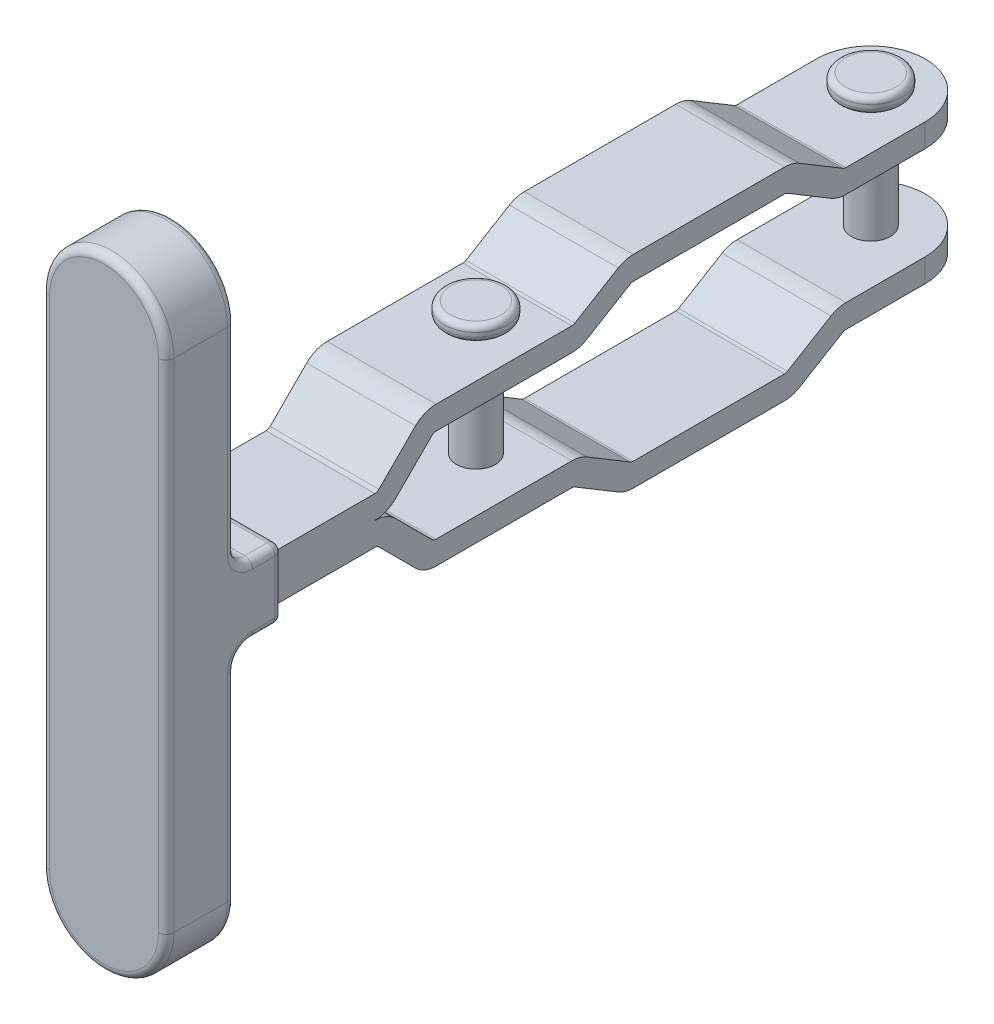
ISO-10303-21;
HEADER;
FILE_DESCRIPTION(('STEP AP214'),'2;1');
FILE_NAME('part.step','',(''),(''),'','','');
FILE_SCHEMA(('AUTOMOTIVE_DESIGN { 1 0 10303 214 1 1 1 1 }'));
ENDSEC;
DATA;
#1=APPLICATION_CONTEXT('core data for automotive mechanical design processes');
#2=APPLICATION_PROTOCOL_DEFINITION('international standard','automotive_design',2000,#1);
#3=PRODUCT_CONTEXT('',#1,'mechanical');
#4=PRODUCT('Part','Part','',(#3));
#5=PRODUCT_RELATED_PRODUCT_CATEGORY('part','',(#4));
#6=PRODUCT_DEFINITION_FORMATION('','',#4);
#7=PRODUCT_DEFINITION_CONTEXT('part definition',#1,'design');
#8=PRODUCT_DEFINITION('design','',#6,#7);
#9=PRODUCT_DEFINITION_SHAPE('','',#8);
#10=(LENGTH_UNIT() NAMED_UNIT(*) SI_UNIT(.MILLI.,.METRE.));
#11=(NAMED_UNIT(*) PLANE_ANGLE_UNIT() SI_UNIT($,.RADIAN.));
#12=(NAMED_UNIT(*) SI_UNIT($,.STERADIAN.) SOLID_ANGLE_UNIT());
#13=UNCERTAINTY_MEASURE_WITH_UNIT(LENGTH_MEASURE(1.E-05),#10,'distance_accuracy_value','');
#14=(GEOMETRIC_REPRESENTATION_CONTEXT(3) GLOBAL_UNCERTAINTY_ASSIGNED_CONTEXT((#13)) GLOBAL_UNIT_ASSIGNED_CONTEXT((#10,
#11,#12)) REPRESENTATION_CONTEXT('',''));
#15=CARTESIAN_POINT('',(0.,0.,0.));
#16=DIRECTION('',(0.,0.,1.));
#17=DIRECTION('',(1.,0.,0.));
#18=AXIS2_PLACEMENT_3D('',#15,#16,#17);
#19=CARTESIAN_POINT('',(-8.39090407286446,-11.02,3.0889714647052));
#20=DIRECTION('',(0.,-1.,0.));
#21=DIRECTION('',(-0.345467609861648,0.,-0.938430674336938));
#22=AXIS2_PLACEMENT_3D('',#19,#20,#21);
#23=PLANE('',#22);
#24=CARTESIAN_POINT('',(0.,-11.02,0.));
#25=DIRECTION('',(0.,-1.,0.));
#26=DIRECTION('',(-0.345467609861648,0.,-0.938430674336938));
#27=AXIS2_PLACEMENT_3D('',#24,#25,#26);
#28=CIRCLE('',#27,3.25);
#29=CARTESIAN_POINT('',(-1.12276973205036,-11.02,-3.04989969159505));
#30=VERTEX_POINT('',#29);
#31=EDGE_CURVE('E1959',#30,#30,#28,.T.);
#32=ORIENTED_EDGE('',*,*,#31,.T.);
#33=EDGE_LOOP('',(#32));
#34=FACE_BOUND('',#33,.T.);
#35=ADVANCED_FACE('F14',(#34),#23,.T.);
#36=CARTESIAN_POINT('',(0.,-10.27,0.));
#37=DIRECTION('',(0.,-1.,0.));
#38=DIRECTION('',(-0.345467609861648,0.,-0.938430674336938));
#39=AXIS2_PLACEMENT_3D('',#36,#37,#38);
#40=TOROIDAL_SURFACE('',#39,3.25,0.75);
#41=ORIENTED_EDGE('',*,*,#31,.F.);
#42=EDGE_LOOP('',(#41));
#43=FACE_BOUND('',#42,.T.);
#44=CARTESIAN_POINT('',(0.,-10.27,0.));
#45=DIRECTION('',(0.,1.,0.));
#46=DIRECTION('',(-0.345467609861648,0.,-0.938430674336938));
#47=AXIS2_PLACEMENT_3D('',#44,#45,#46);
#48=CIRCLE('',#47,4.);
#49=CARTESIAN_POINT('',(-1.38187043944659,-10.27,-3.75372269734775));
#50=VERTEX_POINT('',#49);
#51=EDGE_CURVE('E3251',#50,#50,#48,.T.);
#52=ORIENTED_EDGE('',*,*,#51,.F.);
#53=EDGE_LOOP('',(#52));
#54=FACE_BOUND('',#53,.T.);
#55=ADVANCED_FACE('F2982',(#43,#54),#40,.T.);
#56=CARTESIAN_POINT('',(0.,-9.02,0.));
#57=DIRECTION('',(0.,-1.,0.));
#58=DIRECTION('',(-0.345467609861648,0.,-0.938430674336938));
#59=AXIS2_PLACEMENT_3D('',#56,#57,#58);
#60=CYLINDRICAL_SURFACE('',#59,4.);
#61=ORIENTED_EDGE('',*,*,#51,.T.);
#62=EDGE_LOOP('',(#61));
#63=FACE_BOUND('',#62,.T.);
#64=CARTESIAN_POINT('',(0.,-9.77,0.));
#65=DIRECTION('',(0.,-1.,0.));
#66=DIRECTION('',(0.345467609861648,0.,0.938430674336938));
#67=AXIS2_PLACEMENT_3D('',#64,#65,#66);
#68=CIRCLE('',#67,4.);
#69=CARTESIAN_POINT('',(1.38187043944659,-9.77,3.75372269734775));
#70=VERTEX_POINT('',#69);
#71=EDGE_CURVE('E3264',#70,#70,#68,.T.);
#72=ORIENTED_EDGE('',*,*,#71,.T.);
#73=EDGE_LOOP('',(#72));
#74=FACE_BOUND('',#73,.T.);
#75=ADVANCED_FACE('F2973',(#63,#74),#60,.T.);
#76=CARTESIAN_POINT('',(0.,-9.77,0.));
#77=DIRECTION('',(0.,1.,0.));
#78=DIRECTION('',(0.345467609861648,0.,0.938430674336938));
#79=AXIS2_PLACEMENT_3D('',#76,#77,#78);
#80=TOROIDAL_SURFACE('',#79,3.25,0.75);
#81=CARTESIAN_POINT('',(0.,-9.02,0.));
#82=DIRECTION('',(0.,1.,0.));
#83=DIRECTION('',(0.345467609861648,0.,0.938430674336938));
#84=AXIS2_PLACEMENT_3D('',#81,#82,#83);
#85=CIRCLE('',#84,3.25);
#86=CARTESIAN_POINT('',(1.12276973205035,-9.02,3.04989969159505));
#87=VERTEX_POINT('',#86);
#88=EDGE_CURVE('E3235',#87,#87,#85,.T.);
#89=ORIENTED_EDGE('',*,*,#88,.F.);
#90=EDGE_LOOP('',(#89));
#91=FACE_BOUND('',#90,.T.);
#92=ORIENTED_EDGE('',*,*,#71,.F.);
#93=EDGE_LOOP('',(#92));
#94=FACE_BOUND('',#93,.T.);
#95=ADVANCED_FACE('F2967',(#91,#94),#80,.T.);
#96=CARTESIAN_POINT('',(-8.3909040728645,11.02,3.0889714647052));
#97=DIRECTION('',(0.,-1.,0.));
#98=DIRECTION('',(-0.345467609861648,0.,-0.938430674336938));
#99=AXIS2_PLACEMENT_3D('',#96,#97,#98);
#100=PLANE('',#99);
#101=CARTESIAN_POINT('',(0.,11.02,0.));
#102=DIRECTION('',(0.,1.,0.));
#103=DIRECTION('',(-0.345467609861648,0.,-0.938430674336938));
#104=AXIS2_PLACEMENT_3D('',#101,#102,#103);
#105=CIRCLE('',#104,3.25);
#106=CARTESIAN_POINT('',(-1.12276973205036,11.02,-3.04989969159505));
#107=VERTEX_POINT('',#106);
#108=EDGE_CURVE('E3230',#107,#107,#105,.T.);
#109=ORIENTED_EDGE('',*,*,#108,.T.);
#110=EDGE_LOOP('',(#109));
#111=FACE_BOUND('',#110,.T.);
#112=ADVANCED_FACE('F2959',(#111),#100,.F.);
#113=CARTESIAN_POINT('',(0.,10.27,0.));
#114=DIRECTION('',(0.,-1.,0.));
#115=DIRECTION('',(-0.345467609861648,0.,-0.938430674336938));
#116=AXIS2_PLACEMENT_3D('',#113,#114,#115);
#117=TOROIDAL_SURFACE('',#116,3.25,0.75);
#118=CARTESIAN_POINT('',(0.,10.27,0.));
#119=DIRECTION('',(0.,-1.,0.));
#120=DIRECTION('',(-0.345467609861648,0.,-0.938430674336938));
#121=AXIS2_PLACEMENT_3D('',#118,#119,#120);
#122=CIRCLE('',#121,4.);
#123=CARTESIAN_POINT('',(-1.38187043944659,10.27,-3.75372269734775));
#124=VERTEX_POINT('',#123);
#125=EDGE_CURVE('E3218',#124,#124,#122,.T.);
#126=ORIENTED_EDGE('',*,*,#125,.F.);
#127=EDGE_LOOP('',(#126));
#128=FACE_BOUND('',#127,.T.);
#129=ORIENTED_EDGE('',*,*,#108,.F.);
#130=EDGE_LOOP('',(#129));
#131=FACE_BOUND('',#130,.T.);
#132=ADVANCED_FACE('F2947',(#128,#131),#117,.T.);
#133=CARTESIAN_POINT('',(0.,9.02,0.));
#134=DIRECTION('',(0.,1.,0.));
#135=DIRECTION('',(0.345467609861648,0.,0.938430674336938));
#136=AXIS2_PLACEMENT_3D('',#133,#134,#135);
#137=CYLINDRICAL_SURFACE('',#136,4.);
#138=ORIENTED_EDGE('',*,*,#125,.T.);
#139=EDGE_LOOP('',(#138));
#140=FACE_BOUND('',#139,.T.);
#141=CARTESIAN_POINT('',(0.,9.77,0.));
#142=DIRECTION('',(0.,1.,0.));
#143=DIRECTION('',(-0.345467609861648,0.,-0.938430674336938));
#144=AXIS2_PLACEMENT_3D('',#141,#142,#143);
#145=CIRCLE('',#144,4.);
#146=CARTESIAN_POINT('',(-1.38187043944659,9.77,-3.75372269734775));
#147=VERTEX_POINT('',#146);
#148=EDGE_CURVE('E3223',#147,#147,#145,.T.);
#149=ORIENTED_EDGE('',*,*,#148,.T.);
#150=EDGE_LOOP('',(#149));
#151=FACE_BOUND('',#150,.T.);
#152=ADVANCED_FACE('F2932',(#140,#151),#137,.T.);
#153=CARTESIAN_POINT('',(0.,9.77,0.));
#154=DIRECTION('',(0.,-1.,0.));
#155=DIRECTION('',(-0.345467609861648,0.,-0.938430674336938));
#156=AXIS2_PLACEMENT_3D('',#153,#154,#155);
#157=TOROIDAL_SURFACE('',#156,3.25,0.75);
#158=CARTESIAN_POINT('',(0.,9.02,0.));
#159=DIRECTION('',(0.,-1.,0.));
#160=DIRECTION('',(-0.345467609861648,0.,-0.938430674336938));
#161=AXIS2_PLACEMENT_3D('',#158,#159,#160);
#162=CIRCLE('',#161,3.25);
#163=CARTESIAN_POINT('',(-1.12276973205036,9.02,-3.04989969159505));
#164=VERTEX_POINT('',#163);
#165=EDGE_CURVE('E3224',#164,#164,#162,.T.);
#166=ORIENTED_EDGE('',*,*,#165,.F.);
#167=EDGE_LOOP('',(#166));
#168=FACE_BOUND('',#167,.T.);
#169=ORIENTED_EDGE('',*,*,#148,.F.);
#170=EDGE_LOOP('',(#169));
#171=FACE_BOUND('',#170,.T.);
#172=ADVANCED_FACE('F2036',(#168,#171),#157,.T.);
#173=CARTESIAN_POINT('',(0.,-11.02,0.));
#174=DIRECTION('',(0.,1.,0.));
#175=DIRECTION('',(0.345467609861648,0.,0.938430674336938));
#176=AXIS2_PLACEMENT_3D('',#173,#174,#175);
#177=CYLINDRICAL_SURFACE('',#176,2.5);
#178=CARTESIAN_POINT('',(0.,6.02,0.));
#179=DIRECTION('',(0.,1.,0.));
#180=DIRECTION('',(-1.,0.,0.));
#181=AXIS2_PLACEMENT_3D('',#178,#179,#180);
#182=CIRCLE('',#181,2.5);
#183=CARTESIAN_POINT('',(-2.5,6.02,0.));
#184=VERTEX_POINT('',#183);
#185=EDGE_CURVE('E24',#184,#184,#182,.F.);
#186=ORIENTED_EDGE('',*,*,#185,.T.);
#187=EDGE_LOOP('',(#186));
#188=FACE_BOUND('',#187,.T.);
#189=CARTESIAN_POINT('',(0.,-6.02,0.));
#190=DIRECTION('',(0.,-1.,0.));
#191=DIRECTION('',(1.,0.,0.));
#192=AXIS2_PLACEMENT_3D('',#189,#190,#191);
#193=CIRCLE('',#192,2.5);
#194=CARTESIAN_POINT('',(2.5,-6.02,0.));
#195=VERTEX_POINT('',#194);
#196=EDGE_CURVE('E9',#195,#195,#193,.F.);
#197=ORIENTED_EDGE('',*,*,#196,.T.);
#198=EDGE_LOOP('',(#197));
#199=FACE_BOUND('',#198,.T.);
#200=ADVANCED_FACE('F2028',(#188,#199),#177,.T.);
#201=CARTESIAN_POINT('',(7.99992133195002,-40.0003243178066,98.6472438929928));
#202=DIRECTION('',(7.97468333E-07,0.,-0.999999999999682));
#203=DIRECTION('',(0.,1.,0.));
#204=AXIS2_PLACEMENT_3D('',#201,#202,#203);
#205=PLANE('',#204);
#206=CARTESIAN_POINT('',(-7.86680474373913E-05,31.9996756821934,98.6472375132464));
#207=DIRECTION('',(-7.97468333E-07,0.,0.999999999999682));
#208=DIRECTION('',(0.,1.,0.));
#209=AXIS2_PLACEMENT_3D('',#206,#207,#208);
#210=CIRCLE('',#209,7.);
#211=CARTESIAN_POINT('',(6.99992133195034,31.9996756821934,98.6472430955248));
#212=VERTEX_POINT('',#211);
#213=CARTESIAN_POINT('',(-7.0000786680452,31.9996756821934,98.647231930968));
#214=VERTEX_POINT('',#213);
#215=EDGE_CURVE('E523',#212,#214,#210,.T.);
#216=ORIENTED_EDGE('',*,*,#215,.T.);
#217=DIRECTION('',(0.,-1.,0.));
#218=VECTOR('',#217,1.);
#219=CARTESIAN_POINT('',(-7.00007866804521,-40.0003243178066,98.647231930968));
#220=LINE('',#219,#218);
#221=CARTESIAN_POINT('',(-7.00007866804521,-32.0003243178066,98.647231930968));
#222=VERTEX_POINT('',#221);
#223=EDGE_CURVE('E527',#214,#222,#220,.T.);
#224=ORIENTED_EDGE('',*,*,#223,.T.);
#225=CARTESIAN_POINT('',(-7.86680474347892E-05,-32.0003243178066,98.6472375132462));
#226=DIRECTION('',(-7.97468333E-07,0.,0.999999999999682));
#227=DIRECTION('',(0.,1.,0.));
#228=AXIS2_PLACEMENT_3D('',#225,#226,#227);
#229=CIRCLE('',#228,7.);
#230=CARTESIAN_POINT('',(6.99992133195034,-32.0003243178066,98.6472430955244));
#231=VERTEX_POINT('',#230);
#232=EDGE_CURVE('E528',#222,#231,#229,.T.);
#233=ORIENTED_EDGE('',*,*,#232,.T.);
#234=DIRECTION('',(0.,1.,0.));
#235=VECTOR('',#234,1.);
#236=CARTESIAN_POINT('',(6.99992133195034,31.9996756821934,98.6472430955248));
#237=LINE('',#236,#235);
#238=EDGE_CURVE('E532',#231,#212,#237,.T.);
#239=ORIENTED_EDGE('',*,*,#238,.T.);
#240=EDGE_LOOP('',(#216,#224,#233,#239));
#241=FACE_BOUND('',#240,.T.);
#242=ADVANCED_FACE('F1434',(#241),#205,.F.);
#243=CARTESIAN_POINT('',(-7.78705790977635E-05,31.9996756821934,97.6472375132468));
#244=DIRECTION('',(7.97468333E-07,0.,-0.999999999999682));
#245=DIRECTION('',(0.,1.,0.));
#246=AXIS2_PLACEMENT_3D('',#243,#244,#245);
#247=TOROIDAL_SURFACE('',#246,7.,1.);
#248=CARTESIAN_POINT('',(6.99992212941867,31.9996756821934,97.647243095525));
#249=DIRECTION('',(0.,1.,0.));
#250=DIRECTION('',(-0.999999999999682,0.,-7.97468333E-07));
#251=AXIS2_PLACEMENT_3D('',#248,#249,#250);
#252=CIRCLE('',#251,1.);
#253=CARTESIAN_POINT('',(7.99992212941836,31.9996756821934,97.6472438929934));
#254=VERTEX_POINT('',#253);
#255=EDGE_CURVE('E564',#212,#254,#252,.T.);
#256=ORIENTED_EDGE('',*,*,#255,.T.);
#257=CARTESIAN_POINT('',(-7.78705790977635E-05,31.9996756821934,97.6472375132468));
#258=DIRECTION('',(7.97468333E-07,0.,-0.999999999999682));
#259=DIRECTION('',(0.,1.,0.));
#260=AXIS2_PLACEMENT_3D('',#257,#258,#259);
#261=CIRCLE('',#260,8.);
#262=CARTESIAN_POINT('',(-8.00007787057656,31.9996756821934,97.6472311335));
#263=VERTEX_POINT('',#262);
#264=EDGE_CURVE('E477',#263,#254,#261,.T.);
#265=ORIENTED_EDGE('',*,*,#264,.F.);
#266=CARTESIAN_POINT('',(-7.00007787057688,31.9996756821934,97.6472319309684));
#267=DIRECTION('',(0.,1.,0.));
#268=DIRECTION('',(-0.999999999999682,0.,-7.97468333E-07));
#269=AXIS2_PLACEMENT_3D('',#266,#267,#268);
#270=CIRCLE('',#269,1.);
#271=EDGE_CURVE('E485',#263,#214,#270,.T.);
#272=ORIENTED_EDGE('',*,*,#271,.T.);
#273=ORIENTED_EDGE('',*,*,#215,.F.);
#274=EDGE_LOOP('',(#256,#265,#272,#273));
#275=FACE_BOUND('',#274,.T.);
#276=ADVANCED_FACE('F1426',(#275),#247,.T.);
#277=CARTESIAN_POINT('',(7.99992842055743,39.9996756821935,89.7583550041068));
#278=DIRECTION('',(-7.97468333E-07,0.,0.999999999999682));
#279=DIRECTION('',(0.999999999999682,0.,7.97468333E-07));
#280=AXIS2_PLACEMENT_3D('',#277,#278,#279);
#281=PLANE('',#280);
#282=CARTESIAN_POINT('',(-7.15794400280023E-05,31.9996756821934,89.75834862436));
#283=DIRECTION('',(7.97468333E-07,0.,-0.999999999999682));
#284=DIRECTION('',(0.,-1.,0.));
#285=AXIS2_PLACEMENT_3D('',#282,#283,#284);
#286=CIRCLE('',#285,7.);
#287=CARTESIAN_POINT('',(-7.0000715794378,31.9996756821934,89.7583430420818));
#288=VERTEX_POINT('',#287);
#289=CARTESIAN_POINT('',(6.99992842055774,31.9996756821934,89.7583542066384));
#290=VERTEX_POINT('',#289);
#291=EDGE_CURVE('E602',#288,#290,#286,.T.);
#292=ORIENTED_EDGE('',*,*,#291,.T.);
#293=DIRECTION('',(0.,-1.,0.));
#294=VECTOR('',#293,1.);
#295=CARTESIAN_POINT('',(6.99992842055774,6.6666666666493,89.7583542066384));
#296=LINE('',#295,#294);
#297=CARTESIAN_POINT('',(6.99992842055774,6.6666666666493,89.7583542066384));
#298=VERTEX_POINT('',#297);
#299=EDGE_CURVE('E605',#290,#298,#296,.T.);
#300=ORIENTED_EDGE('',*,*,#299,.T.);
#301=DIRECTION('',(-0.999999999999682,0.,-7.97468333E-07));
#302=VECTOR('',#301,1.);
#303=CARTESIAN_POINT('',(7.99992842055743,6.66666666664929,89.7583550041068));
#304=LINE('',#303,#302);
#305=CARTESIAN_POINT('',(-7.00007157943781,6.6666666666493,89.7583430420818));
#306=VERTEX_POINT('',#305);
#307=EDGE_CURVE('E687',#298,#306,#304,.T.);
#308=ORIENTED_EDGE('',*,*,#307,.T.);
#309=DIRECTION('',(0.,1.,0.));
#310=VECTOR('',#309,1.);
#311=CARTESIAN_POINT('',(-7.00007157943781,39.9996756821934,89.7583430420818));
#312=LINE('',#311,#310);
#313=EDGE_CURVE('E526',#306,#288,#312,.T.);
#314=ORIENTED_EDGE('',*,*,#313,.T.);
#315=EDGE_LOOP('',(#292,#300,#308,#314));
#316=FACE_BOUND('',#315,.T.);
#317=ADVANCED_FACE('F2034',(#316),#281,.F.);
#318=CARTESIAN_POINT('',(-7.23769083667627E-05,31.9996756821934,90.75834862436));
#319=DIRECTION('',(-7.97468333E-07,0.,0.999999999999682));
#320=DIRECTION('',(0.,-1.,0.));
#321=AXIS2_PLACEMENT_3D('',#318,#319,#320);
#322=TOROIDAL_SURFACE('',#321,7.,1.);
#323=CARTESIAN_POINT('',(-7.00007237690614,31.9996756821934,90.7583430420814));
#324=DIRECTION('',(0.,1.,0.));
#325=DIRECTION('',(-0.999999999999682,0.,-7.97468333E-07));
#326=AXIS2_PLACEMENT_3D('',#323,#324,#325);
#327=CIRCLE('',#326,1.);
#328=CARTESIAN_POINT('',(-8.00007237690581,31.9996756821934,90.7583422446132));
#329=VERTEX_POINT('',#328);
#330=EDGE_CURVE('E717',#288,#329,#327,.T.);
#331=ORIENTED_EDGE('',*,*,#330,.T.);
#332=CARTESIAN_POINT('',(-7.23769083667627E-05,31.9996756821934,90.75834862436));
#333=DIRECTION('',(-7.97468333E-07,0.,0.999999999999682));
#334=DIRECTION('',(0.,-1.,0.));
#335=AXIS2_PLACEMENT_3D('',#332,#333,#334);
#336=CIRCLE('',#335,8.);
#337=CARTESIAN_POINT('',(7.9999276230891,31.9996756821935,90.7583550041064));
#338=VERTEX_POINT('',#337);
#339=EDGE_CURVE('E494',#338,#329,#336,.T.);
#340=ORIENTED_EDGE('',*,*,#339,.F.);
#341=CARTESIAN_POINT('',(6.99992762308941,31.9996756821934,90.7583542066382));
#342=DIRECTION('',(0.,-1.,0.));
#343=DIRECTION('',(0.999999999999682,0.,7.97468333E-07));
#344=AXIS2_PLACEMENT_3D('',#341,#342,#343);
#345=CIRCLE('',#344,1.);
#346=EDGE_CURVE('E728',#290,#338,#345,.T.);
#347=ORIENTED_EDGE('',*,*,#346,.F.);
#348=ORIENTED_EDGE('',*,*,#291,.F.);
#349=EDGE_LOOP('',(#331,#340,#347,#348));
#350=FACE_BOUND('',#349,.T.);
#351=ADVANCED_FACE('F819',(#350),#322,.T.);
#352=CARTESIAN_POINT('',(7.99992842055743,-6.66666666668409,89.7583550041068));
#353=DIRECTION('',(-7.97468333E-07,0.,0.999999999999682));
#354=DIRECTION('',(0.999999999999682,0.,7.97468333E-07));
#355=AXIS2_PLACEMENT_3D('',#352,#353,#354);
#356=PLANE('',#355);
#357=DIRECTION('',(-0.999999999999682,0.,-7.97468333E-07));
#358=VECTOR('',#357,1.);
#359=CARTESIAN_POINT('',(7.99992842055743,-6.66666666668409,89.7583550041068));
#360=LINE('',#359,#358);
#361=CARTESIAN_POINT('',(6.99992842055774,-6.6666666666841,89.7583542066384));
#362=VERTEX_POINT('',#361);
#363=CARTESIAN_POINT('',(-7.0000715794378,-6.66666666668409,89.7583430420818));
#364=VERTEX_POINT('',#363);
#365=EDGE_CURVE('E533',#362,#364,#360,.T.);
#366=ORIENTED_EDGE('',*,*,#365,.F.);
#367=DIRECTION('',(0.,-1.,0.));
#368=VECTOR('',#367,1.);
#369=CARTESIAN_POINT('',(6.99992842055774,-32.0003243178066,89.7583542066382));
#370=LINE('',#369,#368);
#371=CARTESIAN_POINT('',(6.99992842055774,-32.0003243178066,89.7583542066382));
#372=VERTEX_POINT('',#371);
#373=EDGE_CURVE('E694',#362,#372,#370,.T.);
#374=ORIENTED_EDGE('',*,*,#373,.T.);
#375=CARTESIAN_POINT('',(-7.15794400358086E-05,-32.0003243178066,89.75834862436));
#376=DIRECTION('',(7.97468333E-07,0.,-0.999999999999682));
#377=DIRECTION('',(0.,-1.,0.));
#378=AXIS2_PLACEMENT_3D('',#375,#376,#377);
#379=CIRCLE('',#378,7.);
#380=CARTESIAN_POINT('',(-7.0000715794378,-32.0003243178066,89.7583430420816));
#381=VERTEX_POINT('',#380);
#382=EDGE_CURVE('E691',#372,#381,#379,.T.);
#383=ORIENTED_EDGE('',*,*,#382,.T.);
#384=DIRECTION('',(0.,1.,0.));
#385=VECTOR('',#384,1.);
#386=CARTESIAN_POINT('',(-7.0000715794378,-6.66666666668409,89.7583430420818));
#387=LINE('',#386,#385);
#388=EDGE_CURVE('E695',#381,#364,#387,.T.);
#389=ORIENTED_EDGE('',*,*,#388,.T.);
#390=EDGE_LOOP('',(#366,#374,#383,#389));
#391=FACE_BOUND('',#390,.T.);
#392=ADVANCED_FACE('F2100',(#391),#356,.F.);
#393=CARTESIAN_POINT('',(-7.78705791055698E-05,-32.0003243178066,97.6472375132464));
#394=DIRECTION('',(7.97468333E-07,0.,-0.999999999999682));
#395=DIRECTION('',(0.,1.,0.));
#396=AXIS2_PLACEMENT_3D('',#393,#394,#395);
#397=TOROIDAL_SURFACE('',#396,7.,1.);
#398=CARTESIAN_POINT('',(-7.00007787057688,-32.0003243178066,97.6472319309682));
#399=DIRECTION('',(0.,1.,0.));
#400=DIRECTION('',(-0.999999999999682,0.,-7.97468333E-07));
#401=AXIS2_PLACEMENT_3D('',#398,#399,#400);
#402=CIRCLE('',#401,1.);
#403=CARTESIAN_POINT('',(-8.00007787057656,-32.0003243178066,97.6472311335));
#404=VERTEX_POINT('',#403);
#405=EDGE_CURVE('E472',#404,#222,#402,.T.);
#406=ORIENTED_EDGE('',*,*,#405,.F.);
#407=CARTESIAN_POINT('',(-7.78705791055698E-05,-32.0003243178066,97.6472375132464));
#408=DIRECTION('',(7.97468333E-07,0.,-0.999999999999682));
#409=DIRECTION('',(0.,1.,0.));
#410=AXIS2_PLACEMENT_3D('',#407,#408,#409);
#411=CIRCLE('',#410,8.);
#412=CARTESIAN_POINT('',(7.99992212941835,-32.0003243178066,97.6472438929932));
#413=VERTEX_POINT('',#412);
#414=EDGE_CURVE('E478',#413,#404,#411,.T.);
#415=ORIENTED_EDGE('',*,*,#414,.F.);
#416=CARTESIAN_POINT('',(6.99992212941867,-32.0003243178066,97.647243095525));
#417=DIRECTION('',(0.,1.,0.));
#418=DIRECTION('',(-0.999999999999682,0.,-7.97468333E-07));
#419=AXIS2_PLACEMENT_3D('',#416,#417,#418);
#420=CIRCLE('',#419,1.);
#421=EDGE_CURVE('E753',#231,#413,#420,.T.);
#422=ORIENTED_EDGE('',*,*,#421,.F.);
#423=ORIENTED_EDGE('',*,*,#232,.F.);
#424=EDGE_LOOP('',(#406,#415,#422,#423));
#425=FACE_BOUND('',#424,.T.);
#426=ADVANCED_FACE('F1436',(#425),#397,.T.);
#427=CARTESIAN_POINT('',(-7.2376908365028E-05,-32.0003243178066,90.7583486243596));
#428=DIRECTION('',(-7.97468333E-07,0.,0.999999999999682));
#429=DIRECTION('',(0.,-1.,0.));
#430=AXIS2_PLACEMENT_3D('',#427,#428,#429);
#431=TOROIDAL_SURFACE('',#430,7.,1.);
#432=CARTESIAN_POINT('',(6.99992762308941,-32.0003243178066,90.758354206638));
#433=DIRECTION('',(0.,1.,0.));
#434=DIRECTION('',(-7.97468333E-07,0.,0.999999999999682));
#435=AXIS2_PLACEMENT_3D('',#432,#433,#434);
#436=CIRCLE('',#435,1.);
#437=CARTESIAN_POINT('',(7.99992762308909,-32.0003243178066,90.7583550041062));
#438=VERTEX_POINT('',#437);
#439=EDGE_CURVE('E468',#438,#372,#436,.T.);
#440=ORIENTED_EDGE('',*,*,#439,.F.);
#441=CARTESIAN_POINT('',(-7.2376908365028E-05,-32.0003243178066,90.7583486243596));
#442=DIRECTION('',(-7.97468333E-07,0.,0.999999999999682));
#443=DIRECTION('',(0.,-1.,0.));
#444=AXIS2_PLACEMENT_3D('',#441,#442,#443);
#445=CIRCLE('',#444,8.);
#446=CARTESIAN_POINT('',(-8.0000723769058,-32.0003243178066,90.758342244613));
#447=VERTEX_POINT('',#446);
#448=EDGE_CURVE('E474',#447,#438,#445,.T.);
#449=ORIENTED_EDGE('',*,*,#448,.F.);
#450=CARTESIAN_POINT('',(-7.00007237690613,-32.0003243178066,90.7583430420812));
#451=DIRECTION('',(0.,-1.,0.));
#452=DIRECTION('',(7.97468333E-07,0.,-0.999999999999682));
#453=AXIS2_PLACEMENT_3D('',#450,#451,#452);
#454=CIRCLE('',#453,1.);
#455=EDGE_CURVE('E490',#447,#381,#454,.T.);
#456=ORIENTED_EDGE('',*,*,#455,.T.);
#457=ORIENTED_EDGE('',*,*,#382,.F.);
#458=EDGE_LOOP('',(#440,#449,#456,#457));
#459=FACE_BOUND('',#458,.T.);
#460=ADVANCED_FACE('F1405',(#459),#431,.T.);
#461=CARTESIAN_POINT('',(7.99993019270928,6.66666666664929,87.5361327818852));
#462=DIRECTION('',(-0.999999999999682,0.,-7.97468333E-07));
#463=DIRECTION('',(0.,-1.,0.));
#464=AXIS2_PLACEMENT_3D('',#461,#462,#463);
#465=CYLINDRICAL_SURFACE('',#464,2.22222222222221);
#466=DIRECTION('',(-0.999999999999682,0.,-7.97468333E-07));
#467=VECTOR('',#466,1.);
#468=CARTESIAN_POINT('',(7.99993019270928,4.44444444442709,87.5361327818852));
#469=LINE('',#468,#467);
#470=CARTESIAN_POINT('',(6.9999301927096,4.44444444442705,87.536131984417));
#471=VERTEX_POINT('',#470);
#472=CARTESIAN_POINT('',(-7.00006980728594,4.4444444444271,87.5361208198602));
#473=VERTEX_POINT('',#472);
#474=EDGE_CURVE('E549',#471,#473,#469,.T.);
#475=ORIENTED_EDGE('',*,*,#474,.T.);
#476=CARTESIAN_POINT('',(-7.00006980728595,6.6666666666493,87.5361208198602));
#477=DIRECTION('',(-0.999999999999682,0.,-7.97468333E-07));
#478=DIRECTION('',(0.,1.,0.));
#479=AXIS2_PLACEMENT_3D('',#476,#477,#478);
#480=CIRCLE('',#479,2.22222222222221);
#481=EDGE_CURVE('E545',#473,#306,#480,.T.);
#482=ORIENTED_EDGE('',*,*,#481,.T.);
#483=ORIENTED_EDGE('',*,*,#307,.F.);
#484=CARTESIAN_POINT('',(6.9999301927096,6.6666666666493,87.536131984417));
#485=DIRECTION('',(0.999999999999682,0.,7.97468333E-07));
#486=DIRECTION('',(0.,1.,0.));
#487=AXIS2_PLACEMENT_3D('',#484,#485,#486);
#488=CIRCLE('',#487,2.22222222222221);
#489=EDGE_CURVE('E550',#298,#471,#488,.T.);
#490=ORIENTED_EDGE('',*,*,#489,.T.);
#491=EDGE_LOOP('',(#475,#482,#483,#490));
#492=FACE_BOUND('',#491,.T.);
#493=ADVANCED_FACE('F2073',(#492),#465,.F.);
#494=CARTESIAN_POINT('',(-7.00006980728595,6.6666666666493,87.5361208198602));
#495=DIRECTION('',(0.999999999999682,0.,7.97468333E-07));
#496=DIRECTION('',(0.,1.,0.));
#497=AXIS2_PLACEMENT_3D('',#494,#495,#496);
#498=TOROIDAL_SURFACE('',#497,3.22222222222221,1.);
#499=CARTESIAN_POINT('',(-7.00007237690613,6.6666666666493,90.7583430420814));
#500=DIRECTION('',(0.,-1.,0.));
#501=DIRECTION('',(7.97468333E-07,0.,-0.999999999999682));
#502=AXIS2_PLACEMENT_3D('',#499,#500,#501);
#503=CIRCLE('',#502,1.);
#504=CARTESIAN_POINT('',(-8.00007237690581,6.66666666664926,90.7583422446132));
#505=VERTEX_POINT('',#504);
#506=EDGE_CURVE('E721',#505,#306,#503,.T.);
#507=ORIENTED_EDGE('',*,*,#506,.T.);
#508=ORIENTED_EDGE('',*,*,#481,.F.);
#509=CARTESIAN_POINT('',(-7.00006980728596,3.4444444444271,87.5361208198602));
#510=DIRECTION('',(7.97468333E-07,0.,-0.999999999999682));
#511=DIRECTION('',(0.,1.,0.));
#512=AXIS2_PLACEMENT_3D('',#509,#510,#511);
#513=CIRCLE('',#512,1.);
#514=CARTESIAN_POINT('',(-8.00006980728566,3.44444444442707,87.536120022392));
#515=VERTEX_POINT('',#514);
#516=EDGE_CURVE('E732',#515,#473,#513,.T.);
#517=ORIENTED_EDGE('',*,*,#516,.F.);
#518=CARTESIAN_POINT('',(-8.00006980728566,6.66666666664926,87.536120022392));
#519=DIRECTION('',(0.999999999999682,0.,7.97468333E-07));
#520=DIRECTION('',(0.,1.,0.));
#521=AXIS2_PLACEMENT_3D('',#518,#519,#520);
#522=CIRCLE('',#521,3.22222222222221);
#523=EDGE_CURVE('E511',#505,#515,#522,.T.);
#524=ORIENTED_EDGE('',*,*,#523,.F.);
#525=EDGE_LOOP('',(#507,#508,#517,#524));
#526=FACE_BOUND('',#525,.T.);
#527=ADVANCED_FACE('F823',(#526),#498,.T.);
#528=CARTESIAN_POINT('',(-7.00007237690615,39.9996756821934,90.7583430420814));
#529=DIRECTION('',(0.,1.,0.));
#530=DIRECTION('',(-7.97468333E-07,0.,0.999999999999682));
#531=AXIS2_PLACEMENT_3D('',#528,#529,#530);
#532=CYLINDRICAL_SURFACE('',#531,1.);
#533=ORIENTED_EDGE('',*,*,#506,.F.);
#534=DIRECTION('',(0.,-1.,0.));
#535=VECTOR('',#534,1.);
#536=CARTESIAN_POINT('',(-8.00007237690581,6.66666666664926,90.7583422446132));
#537=LINE('',#536,#535);
#538=EDGE_CURVE('E506',#329,#505,#537,.T.);
#539=ORIENTED_EDGE('',*,*,#538,.F.);
#540=ORIENTED_EDGE('',*,*,#330,.F.);
#541=ORIENTED_EDGE('',*,*,#313,.F.);
#542=EDGE_LOOP('',(#533,#539,#540,#541));
#543=FACE_BOUND('',#542,.T.);
#544=ADVANCED_FACE('F821',(#543),#532,.T.);
#545=CARTESIAN_POINT('',(-7.00007787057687,-40.0003243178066,97.6472319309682));
#546=DIRECTION('',(0.,-1.,0.));
#547=DIRECTION('',(0.999999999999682,0.,7.97468333E-07));
#548=AXIS2_PLACEMENT_3D('',#545,#546,#547);
#549=CYLINDRICAL_SURFACE('',#548,1.);
#550=ORIENTED_EDGE('',*,*,#405,.T.);
#551=ORIENTED_EDGE('',*,*,#223,.F.);
#552=ORIENTED_EDGE('',*,*,#271,.F.);
#553=DIRECTION('',(0.,1.,0.));
#554=VECTOR('',#553,1.);
#555=CARTESIAN_POINT('',(-8.00007787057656,6.66666666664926,97.6472311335));
#556=LINE('',#555,#554);
#557=EDGE_CURVE('E544',#404,#263,#556,.T.);
#558=ORIENTED_EDGE('',*,*,#557,.F.);
#559=EDGE_LOOP('',(#550,#551,#552,#558));
#560=FACE_BOUND('',#559,.T.);
#561=ADVANCED_FACE('F1431',(#560),#549,.T.);
#562=CARTESIAN_POINT('',(-7.00007237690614,-6.6666666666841,90.7583430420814));
#563=DIRECTION('',(0.,1.,0.));
#564=DIRECTION('',(-7.97468333E-07,0.,0.999999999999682));
#565=AXIS2_PLACEMENT_3D('',#562,#563,#564);
#566=CYLINDRICAL_SURFACE('',#565,1.);
#567=CARTESIAN_POINT('',(-7.00007237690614,-6.6666666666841,90.7583430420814));
#568=DIRECTION('',(0.,-1.,0.));
#569=DIRECTION('',(7.97468333E-07,0.,-0.999999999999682));
#570=AXIS2_PLACEMENT_3D('',#567,#568,#569);
#571=CIRCLE('',#570,1.);
#572=CARTESIAN_POINT('',(-8.0000723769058,-6.6666666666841,90.7583422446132));
#573=VERTEX_POINT('',#572);
#574=EDGE_CURVE('E483',#573,#364,#571,.T.);
#575=ORIENTED_EDGE('',*,*,#574,.T.);
#576=ORIENTED_EDGE('',*,*,#388,.F.);
#577=ORIENTED_EDGE('',*,*,#455,.F.);
#578=DIRECTION('',(0.,-1.,0.));
#579=VECTOR('',#578,1.);
#580=CARTESIAN_POINT('',(-8.00007237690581,6.66666666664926,90.7583422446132));
#581=LINE('',#580,#579);
#582=EDGE_CURVE('E543',#573,#447,#581,.T.);
#583=ORIENTED_EDGE('',*,*,#582,.F.);
#584=EDGE_LOOP('',(#575,#576,#577,#583));
#585=FACE_BOUND('',#584,.T.);
#586=ADVANCED_FACE('F1400',(#585),#566,.T.);
#587=CARTESIAN_POINT('',(-7.00006980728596,-6.66666666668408,87.5361208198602));
#588=DIRECTION('',(0.999999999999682,0.,7.97468333E-07));
#589=DIRECTION('',(0.,1.,0.));
#590=AXIS2_PLACEMENT_3D('',#587,#588,#589);
#591=TOROIDAL_SURFACE('',#590,3.22222222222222,1.);
#592=CARTESIAN_POINT('',(-7.00006980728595,-3.44444444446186,87.5361208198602));
#593=DIRECTION('',(7.97468326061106E-07,0.,-0.999999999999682));
#594=DIRECTION('',(0.,1.,0.));
#595=AXIS2_PLACEMENT_3D('',#592,#593,#594);
#596=CIRCLE('',#595,1.);
#597=CARTESIAN_POINT('',(-7.00006980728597,-4.44444444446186,87.5361208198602));
#598=VERTEX_POINT('',#597);
#599=CARTESIAN_POINT('',(-8.00006980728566,-3.44444444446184,87.536120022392));
#600=VERTEX_POINT('',#599);
#601=EDGE_CURVE('E505',#598,#600,#596,.T.);
#602=ORIENTED_EDGE('',*,*,#601,.F.);
#603=CARTESIAN_POINT('',(-7.00006980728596,-6.66666666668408,87.5361208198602));
#604=DIRECTION('',(-0.999999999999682,0.,-7.97468333E-07));
#605=DIRECTION('',(0.,1.,0.));
#606=AXIS2_PLACEMENT_3D('',#603,#604,#605);
#607=CIRCLE('',#606,2.22222222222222);
#608=EDGE_CURVE('E538',#364,#598,#607,.T.);
#609=ORIENTED_EDGE('',*,*,#608,.F.);
#610=ORIENTED_EDGE('',*,*,#574,.F.);
#611=CARTESIAN_POINT('',(-8.00006980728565,-6.66666666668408,87.536120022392));
#612=DIRECTION('',(0.999999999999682,0.,7.97468333E-07));
#613=DIRECTION('',(0.,1.,0.));
#614=AXIS2_PLACEMENT_3D('',#611,#612,#613);
#615=CIRCLE('',#614,3.22222222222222);
#616=EDGE_CURVE('E499',#600,#573,#615,.T.);
#617=ORIENTED_EDGE('',*,*,#616,.F.);
#618=EDGE_LOOP('',(#602,#609,#610,#617));
#619=FACE_BOUND('',#618,.T.);
#620=ADVANCED_FACE('F1397',(#619),#591,.T.);
#621=CARTESIAN_POINT('',(-7.00006980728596,3.44444444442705,87.5361208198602));
#622=DIRECTION('',(-7.97468333E-07,0.,0.999999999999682));
#623=DIRECTION('',(0.,-1.,0.));
#624=AXIS2_PLACEMENT_3D('',#621,#622,#623);
#625=CYLINDRICAL_SURFACE('',#624,1.);
#626=ORIENTED_EDGE('',*,*,#516,.T.);
#627=DIRECTION('',(-7.97468333E-07,0.,0.999999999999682));
#628=VECTOR('',#627,1.);
#629=CARTESIAN_POINT('',(-7.00006980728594,4.44444444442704,87.5361208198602));
#630=LINE('',#629,#628);
#631=CARTESIAN_POINT('',(-7.00006750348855,4.44444444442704,84.6472319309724));
#632=VERTEX_POINT('',#631);
#633=EDGE_CURVE('E707',#632,#473,#630,.T.);
#634=ORIENTED_EDGE('',*,*,#633,.F.);
#635=CARTESIAN_POINT('',(-7.00006750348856,3.44444444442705,84.6472319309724));
#636=DIRECTION('',(7.97468333E-07,0.,-0.999999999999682));
#637=DIRECTION('',(0.,1.,0.));
#638=AXIS2_PLACEMENT_3D('',#635,#636,#637);
#639=CIRCLE('',#638,1.);
#640=CARTESIAN_POINT('',(-8.00006750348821,3.44444444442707,84.647231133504));
#641=VERTEX_POINT('',#640);
#642=EDGE_CURVE('E696',#641,#632,#639,.T.);
#643=ORIENTED_EDGE('',*,*,#642,.F.);
#644=DIRECTION('',(7.97468333E-07,0.,-0.999999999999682));
#645=VECTOR('',#644,1.);
#646=CARTESIAN_POINT('',(-8.00006980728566,3.44444444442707,87.536120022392));
#647=LINE('',#646,#645);
#648=EDGE_CURVE('E668',#515,#641,#647,.T.);
#649=ORIENTED_EDGE('',*,*,#648,.F.);
#650=EDGE_LOOP('',(#626,#634,#643,#649));
#651=FACE_BOUND('',#650,.T.);
#652=ADVANCED_FACE('F2058',(#651),#625,.T.);
#653=CARTESIAN_POINT('',(7.99993019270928,-6.66666666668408,87.5361327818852));
#654=DIRECTION('',(-0.999999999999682,0.,-7.97468333E-07));
#655=DIRECTION('',(0.,-1.,0.));
#656=AXIS2_PLACEMENT_3D('',#653,#654,#655);
#657=CYLINDRICAL_SURFACE('',#656,2.22222222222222);
#658=DIRECTION('',(-0.999999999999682,0.,-7.97468333E-07));
#659=VECTOR('',#658,1.);
#660=CARTESIAN_POINT('',(7.99993019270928,-4.44444444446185,87.5361327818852));
#661=LINE('',#660,#659);
#662=CARTESIAN_POINT('',(6.9999301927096,-4.44444444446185,87.536131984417));
#663=VERTEX_POINT('',#662);
#664=EDGE_CURVE('E573',#663,#598,#661,.T.);
#665=ORIENTED_EDGE('',*,*,#664,.F.);
#666=CARTESIAN_POINT('',(6.9999301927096,-6.66666666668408,87.536131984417));
#667=DIRECTION('',(0.999999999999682,0.,7.97468333E-07));
#668=DIRECTION('',(0.,1.,0.));
#669=AXIS2_PLACEMENT_3D('',#666,#667,#668);
#670=CIRCLE('',#669,2.22222222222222);
#671=EDGE_CURVE('E537',#663,#362,#670,.T.);
#672=ORIENTED_EDGE('',*,*,#671,.T.);
#673=ORIENTED_EDGE('',*,*,#365,.T.);
#674=ORIENTED_EDGE('',*,*,#608,.T.);
#675=EDGE_LOOP('',(#665,#672,#673,#674));
#676=FACE_BOUND('',#675,.T.);
#677=ADVANCED_FACE('F16',(#676),#657,.F.);
#678=CARTESIAN_POINT('',(-7.00006670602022,-3.44444444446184,83.6472319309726));
#679=DIRECTION('',(7.97468333E-07,0.,-0.999999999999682));
#680=DIRECTION('',(0.,1.,0.));
#681=AXIS2_PLACEMENT_3D('',#678,#679,#680);
#682=CYLINDRICAL_SURFACE('',#681,1.);
#683=ORIENTED_EDGE('',*,*,#601,.T.);
#684=DIRECTION('',(-7.97468333E-07,0.,0.999999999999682));
#685=VECTOR('',#684,1.);
#686=CARTESIAN_POINT('',(-8.00006980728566,-3.44444444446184,87.536120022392));
#687=LINE('',#686,#685);
#688=CARTESIAN_POINT('',(-8.00006750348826,-3.44444444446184,84.647231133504));
#689=VERTEX_POINT('',#688);
#690=EDGE_CURVE('E448',#689,#600,#687,.T.);
#691=ORIENTED_EDGE('',*,*,#690,.F.);
#692=CARTESIAN_POINT('',(-7.00006750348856,-3.44444444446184,84.6472319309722));
#693=DIRECTION('',(7.97468333E-07,0.,-0.999999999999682));
#694=DIRECTION('',(0.,1.,0.));
#695=AXIS2_PLACEMENT_3D('',#692,#693,#694);
#696=CIRCLE('',#695,1.);
#697=CARTESIAN_POINT('',(-7.00006750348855,-4.44444444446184,84.6472319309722));
#698=VERTEX_POINT('',#697);
#699=EDGE_CURVE('E516',#698,#689,#696,.T.);
#700=ORIENTED_EDGE('',*,*,#699,.F.);
#701=DIRECTION('',(7.97468333E-07,0.,-0.999999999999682));
#702=VECTOR('',#701,1.);
#703=CARTESIAN_POINT('',(-7.00006670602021,-4.44444444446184,83.6472319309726));
#704=LINE('',#703,#702);
#705=EDGE_CURVE('E683',#598,#698,#704,.T.);
#706=ORIENTED_EDGE('',*,*,#705,.F.);
#707=EDGE_LOOP('',(#683,#691,#700,#706));
#708=FACE_BOUND('',#707,.T.);
#709=ADVANCED_FACE('F1388',(#708),#682,.T.);
#710=CARTESIAN_POINT('',(6.99992212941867,6.66666666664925,97.647243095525));
#711=DIRECTION('',(0.,1.,0.));
#712=DIRECTION('',(-0.999999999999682,0.,-7.97468333E-07));
#713=AXIS2_PLACEMENT_3D('',#710,#711,#712);
#714=CYLINDRICAL_SURFACE('',#713,1.);
#715=ORIENTED_EDGE('',*,*,#421,.T.);
#716=DIRECTION('',(0.,-1.,0.));
#717=VECTOR('',#716,1.);
#718=CARTESIAN_POINT('',(7.99992212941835,-32.0003243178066,97.6472438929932));
#719=LINE('',#718,#717);
#720=EDGE_CURVE('E495',#254,#413,#719,.T.);
#721=ORIENTED_EDGE('',*,*,#720,.F.);
#722=ORIENTED_EDGE('',*,*,#255,.F.);
#723=ORIENTED_EDGE('',*,*,#238,.F.);
#724=EDGE_LOOP('',(#715,#721,#722,#723));
#725=FACE_BOUND('',#724,.T.);
#726=ADVANCED_FACE('F1420',(#725),#714,.T.);
#727=CARTESIAN_POINT('',(-7.86680474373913E-05,31.9996756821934,98.6472375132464));
#728=DIRECTION('',(-7.97468333E-07,0.,0.999999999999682));
#729=DIRECTION('',(0.,-1.,0.));
#730=AXIS2_PLACEMENT_3D('',#727,#728,#729);
#731=CYLINDRICAL_SURFACE('',#730,8.);
#732=DIRECTION('',(-7.97468333E-07,0.,0.999999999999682));
#733=VECTOR('',#732,1.);
#734=CARTESIAN_POINT('',(7.99992133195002,31.9996756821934,98.647243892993));
#735=LINE('',#734,#733);
#736=EDGE_CURVE('E498',#338,#254,#735,.T.);
#737=ORIENTED_EDGE('',*,*,#736,.F.);
#738=ORIENTED_EDGE('',*,*,#339,.T.);
#739=DIRECTION('',(7.97468333E-07,0.,-0.999999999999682));
#740=VECTOR('',#739,1.);
#741=CARTESIAN_POINT('',(-8.00006980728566,31.9996756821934,87.536120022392));
#742=LINE('',#741,#740);
#743=EDGE_CURVE('E510',#263,#329,#742,.T.);
#744=ORIENTED_EDGE('',*,*,#743,.F.);
#745=ORIENTED_EDGE('',*,*,#264,.T.);
#746=EDGE_LOOP('',(#737,#738,#744,#745));
#747=FACE_BOUND('',#746,.T.);
#748=ADVANCED_FACE('F814',(#747),#731,.T.);
#749=CARTESIAN_POINT('',(6.99992762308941,6.6666666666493,90.7583542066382));
#750=DIRECTION('',(0.,-1.,0.));
#751=DIRECTION('',(7.97468333E-07,0.,-0.999999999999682));
#752=AXIS2_PLACEMENT_3D('',#749,#750,#751);
#753=CYLINDRICAL_SURFACE('',#752,1.);
#754=ORIENTED_EDGE('',*,*,#346,.T.);
#755=DIRECTION('',(0.,1.,0.));
#756=VECTOR('',#755,1.);
#757=CARTESIAN_POINT('',(7.9999276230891,31.9996756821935,90.7583550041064));
#758=LINE('',#757,#756);
#759=CARTESIAN_POINT('',(7.99992762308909,6.66666666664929,90.7583550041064));
#760=VERTEX_POINT('',#759);
#761=EDGE_CURVE('E522',#760,#338,#758,.T.);
#762=ORIENTED_EDGE('',*,*,#761,.F.);
#763=CARTESIAN_POINT('',(6.99992762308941,6.6666666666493,90.7583542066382));
#764=DIRECTION('',(0.,-1.,0.));
#765=DIRECTION('',(7.97468333E-07,0.,-0.999999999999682));
#766=AXIS2_PLACEMENT_3D('',#763,#764,#765);
#767=CIRCLE('',#766,1.);
#768=EDGE_CURVE('E699',#298,#760,#767,.T.);
#769=ORIENTED_EDGE('',*,*,#768,.F.);
#770=ORIENTED_EDGE('',*,*,#299,.F.);
#771=EDGE_LOOP('',(#754,#762,#769,#770));
#772=FACE_BOUND('',#771,.T.);
#773=ADVANCED_FACE('F2052',(#772),#753,.T.);
#774=CARTESIAN_POINT('',(6.9999301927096,6.6666666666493,87.536131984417));
#775=DIRECTION('',(0.999999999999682,0.,7.97468333E-07));
#776=DIRECTION('',(0.,1.,0.));
#777=AXIS2_PLACEMENT_3D('',#774,#775,#776);
#778=TOROIDAL_SURFACE('',#777,3.22222222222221,1.);
#779=ORIENTED_EDGE('',*,*,#768,.T.);
#780=CARTESIAN_POINT('',(7.99993019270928,6.66666666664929,87.5361327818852));
#781=DIRECTION('',(-0.999999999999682,0.,-7.97468333E-07));
#782=DIRECTION('',(0.,1.,0.));
#783=AXIS2_PLACEMENT_3D('',#780,#781,#782);
#784=CIRCLE('',#783,3.22222222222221);
#785=CARTESIAN_POINT('',(7.99993019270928,3.44444444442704,87.5361327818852));
#786=VERTEX_POINT('',#785);
#787=EDGE_CURVE('E517',#786,#760,#784,.T.);
#788=ORIENTED_EDGE('',*,*,#787,.F.);
#789=CARTESIAN_POINT('',(6.9999301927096,3.44444444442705,87.536131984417));
#790=DIRECTION('',(7.97468339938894E-07,0.,-0.999999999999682));
#791=DIRECTION('',(0.,1.,0.));
#792=AXIS2_PLACEMENT_3D('',#789,#790,#791);
#793=CIRCLE('',#792,1.);
#794=EDGE_CURVE('E479',#471,#786,#793,.T.);
#795=ORIENTED_EDGE('',*,*,#794,.F.);
#796=ORIENTED_EDGE('',*,*,#489,.F.);
#797=EDGE_LOOP('',(#779,#788,#795,#796));
#798=FACE_BOUND('',#797,.T.);
#799=ADVANCED_FACE('F2041',(#798),#778,.T.);
#800=CARTESIAN_POINT('',(6.9999301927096,-3.44444444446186,87.536131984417));
#801=DIRECTION('',(-7.97468333E-07,0.,0.999999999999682));
#802=DIRECTION('',(0.,-1.,0.));
#803=AXIS2_PLACEMENT_3D('',#800,#801,#802);
#804=CYLINDRICAL_SURFACE('',#803,1.);
#805=CARTESIAN_POINT('',(6.9999301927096,-3.44444444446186,87.536131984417));
#806=DIRECTION('',(7.97468333E-07,0.,-0.999999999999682));
#807=DIRECTION('',(0.,1.,0.));
#808=AXIS2_PLACEMENT_3D('',#805,#806,#807);
#809=CIRCLE('',#808,1.);
#810=CARTESIAN_POINT('',(7.99993019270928,-3.44444444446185,87.5361327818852));
#811=VERTEX_POINT('',#810);
#812=EDGE_CURVE('E434',#811,#663,#809,.T.);
#813=ORIENTED_EDGE('',*,*,#812,.T.);
#814=DIRECTION('',(-7.97468333E-07,0.,0.999999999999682));
#815=VECTOR('',#814,1.);
#816=CARTESIAN_POINT('',(6.9999301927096,-4.44444444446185,87.536131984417));
#817=LINE('',#816,#815);
#818=CARTESIAN_POINT('',(6.999932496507,-4.44444444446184,84.647243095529));
#819=VERTEX_POINT('',#818);
#820=EDGE_CURVE('E568',#819,#663,#817,.T.);
#821=ORIENTED_EDGE('',*,*,#820,.F.);
#822=CARTESIAN_POINT('',(6.999932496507,-3.44444444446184,84.647243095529));
#823=DIRECTION('',(-7.97468333E-07,0.,0.999999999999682));
#824=DIRECTION('',(0.,1.,0.));
#825=AXIS2_PLACEMENT_3D('',#822,#823,#824);
#826=CIRCLE('',#825,1.);
#827=CARTESIAN_POINT('',(7.99993249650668,-3.44444444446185,84.6472438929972));
#828=VERTEX_POINT('',#827);
#829=EDGE_CURVE('E453',#819,#828,#826,.T.);
#830=ORIENTED_EDGE('',*,*,#829,.T.);
#831=DIRECTION('',(7.97468333E-07,0.,-0.999999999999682));
#832=VECTOR('',#831,1.);
#833=CARTESIAN_POINT('',(7.99993329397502,-3.44444444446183,83.6472438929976));
#834=LINE('',#833,#832);
#835=EDGE_CURVE('E760',#811,#828,#834,.T.);
#836=ORIENTED_EDGE('',*,*,#835,.F.);
#837=EDGE_LOOP('',(#813,#821,#830,#836));
#838=FACE_BOUND('',#837,.T.);
#839=ADVANCED_FACE('F2045',(#838),#804,.T.);
#840=CARTESIAN_POINT('',(6.9999301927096,-6.66666666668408,87.536131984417));
#841=DIRECTION('',(0.999999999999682,0.,7.97468333E-07));
#842=DIRECTION('',(0.,1.,0.));
#843=AXIS2_PLACEMENT_3D('',#840,#841,#842);
#844=TOROIDAL_SURFACE('',#843,3.22222222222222,1.);
#845=CARTESIAN_POINT('',(6.99992762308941,-6.6666666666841,90.7583542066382));
#846=DIRECTION('',(0.,1.,0.));
#847=DIRECTION('',(-7.97468333E-07,0.,0.999999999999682));
#848=AXIS2_PLACEMENT_3D('',#845,#846,#847);
#849=CIRCLE('',#848,1.);
#850=CARTESIAN_POINT('',(7.99992762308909,-6.6666666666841,90.7583550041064));
#851=VERTEX_POINT('',#850);
#852=EDGE_CURVE('E455',#851,#362,#849,.T.);
#853=ORIENTED_EDGE('',*,*,#852,.T.);
#854=ORIENTED_EDGE('',*,*,#671,.F.);
#855=ORIENTED_EDGE('',*,*,#812,.F.);
#856=CARTESIAN_POINT('',(7.99993019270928,-6.66666666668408,87.5361327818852));
#857=DIRECTION('',(-0.999999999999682,0.,-7.97468333E-07));
#858=DIRECTION('',(0.,1.,0.));
#859=AXIS2_PLACEMENT_3D('',#856,#857,#858);
#860=CIRCLE('',#859,3.22222222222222);
#861=EDGE_CURVE('E556',#851,#811,#860,.T.);
#862=ORIENTED_EDGE('',*,*,#861,.F.);
#863=EDGE_LOOP('',(#853,#854,#855,#862));
#864=FACE_BOUND('',#863,.T.);
#865=ADVANCED_FACE('F2043',(#864),#844,.T.);
#866=CARTESIAN_POINT('',(6.99992762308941,6.66666666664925,90.7583542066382));
#867=DIRECTION('',(0.,-1.,0.));
#868=DIRECTION('',(7.97468333E-07,0.,-0.999999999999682));
#869=AXIS2_PLACEMENT_3D('',#866,#867,#868);
#870=CYLINDRICAL_SURFACE('',#869,1.);
#871=ORIENTED_EDGE('',*,*,#439,.T.);
#872=ORIENTED_EDGE('',*,*,#373,.F.);
#873=ORIENTED_EDGE('',*,*,#852,.F.);
#874=DIRECTION('',(0.,1.,0.));
#875=VECTOR('',#874,1.);
#876=CARTESIAN_POINT('',(7.99992762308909,-6.6666666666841,90.7583550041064));
#877=LINE('',#876,#875);
#878=EDGE_CURVE('E551',#438,#851,#877,.T.);
#879=ORIENTED_EDGE('',*,*,#878,.F.);
#880=EDGE_LOOP('',(#871,#872,#873,#879));
#881=FACE_BOUND('',#880,.T.);
#882=ADVANCED_FACE('F1413',(#881),#870,.T.);
#883=CARTESIAN_POINT('',(-7.15794400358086E-05,-32.0003243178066,89.75834862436));
#884=DIRECTION('',(7.97468333E-07,0.,-0.999999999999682));
#885=DIRECTION('',(0.,1.,0.));
#886=AXIS2_PLACEMENT_3D('',#883,#884,#885);
#887=CYLINDRICAL_SURFACE('',#886,8.);
#888=DIRECTION('',(-7.97468333E-07,0.,0.999999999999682));
#889=VECTOR('',#888,1.);
#890=CARTESIAN_POINT('',(-8.00006980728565,-32.0003243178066,87.5361200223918));
#891=LINE('',#890,#889);
#892=EDGE_CURVE('E539',#447,#404,#891,.T.);
#893=ORIENTED_EDGE('',*,*,#892,.F.);
#894=ORIENTED_EDGE('',*,*,#448,.T.);
#895=DIRECTION('',(7.97468333E-07,0.,-0.999999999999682));
#896=VECTOR('',#895,1.);
#897=CARTESIAN_POINT('',(7.99992842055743,-32.0003243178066,89.7583550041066));
#898=LINE('',#897,#896);
#899=EDGE_CURVE('E555',#413,#438,#898,.T.);
#900=ORIENTED_EDGE('',*,*,#899,.F.);
#901=ORIENTED_EDGE('',*,*,#414,.T.);
#902=EDGE_LOOP('',(#893,#894,#900,#901));
#903=FACE_BOUND('',#902,.T.);
#904=ADVANCED_FACE('F1409',(#903),#887,.T.);
#905=CARTESIAN_POINT('',(6.9999301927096,3.44444444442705,87.536131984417));
#906=DIRECTION('',(7.97468333E-07,0.,-0.999999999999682));
#907=DIRECTION('',(0.,1.,0.));
#908=AXIS2_PLACEMENT_3D('',#905,#906,#907);
#909=CYLINDRICAL_SURFACE('',#908,1.);
#910=ORIENTED_EDGE('',*,*,#794,.T.);
#911=DIRECTION('',(-7.97468333E-07,0.,0.999999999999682));
#912=VECTOR('',#911,1.);
#913=CARTESIAN_POINT('',(7.99993019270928,3.44444444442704,87.5361327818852));
#914=LINE('',#913,#912);
#915=CARTESIAN_POINT('',(7.99993249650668,3.44444444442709,84.6472438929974));
#916=VERTEX_POINT('',#915);
#917=EDGE_CURVE('E521',#916,#786,#914,.T.);
#918=ORIENTED_EDGE('',*,*,#917,.F.);
#919=CARTESIAN_POINT('',(6.999932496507,3.44444444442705,84.647243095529));
#920=DIRECTION('',(7.97468329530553E-07,0.,-0.999999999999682));
#921=DIRECTION('',(0.999999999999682,0.,7.97468329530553E-07));
#922=AXIS2_PLACEMENT_3D('',#919,#920,#921);
#923=CIRCLE('',#922,1.);
#924=CARTESIAN_POINT('',(6.999932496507,4.44444444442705,84.647243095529));
#925=VERTEX_POINT('',#924);
#926=EDGE_CURVE('E577',#925,#916,#923,.T.);
#927=ORIENTED_EDGE('',*,*,#926,.F.);
#928=DIRECTION('',(7.97468333E-07,0.,-0.999999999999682));
#929=VECTOR('',#928,1.);
#930=CARTESIAN_POINT('',(6.99993329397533,4.44444444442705,83.6472430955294));
#931=LINE('',#930,#929);
#932=EDGE_CURVE('E711',#471,#925,#931,.T.);
#933=ORIENTED_EDGE('',*,*,#932,.F.);
#934=EDGE_LOOP('',(#910,#918,#927,#933));
#935=FACE_BOUND('',#934,.T.);
#936=ADVANCED_FACE('F2064',(#935),#909,.T.);
#937=CARTESIAN_POINT('',(7.99993019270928,4.44444444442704,87.5361327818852));
#938=DIRECTION('',(0.,-1.,0.));
#939=DIRECTION('',(0.999999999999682,0.,7.97468333E-07));
#940=AXIS2_PLACEMENT_3D('',#937,#938,#939);
#941=PLANE('',#940);
#942=DIRECTION('',(-0.999999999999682,0.,-7.97468333E-07));
#943=VECTOR('',#942,1.);
#944=CARTESIAN_POINT('',(7.99993249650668,4.44444444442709,84.6472438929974));
#945=LINE('',#944,#943);
#946=EDGE_CURVE('E586',#925,#632,#945,.T.);
#947=ORIENTED_EDGE('',*,*,#946,.T.);
#948=ORIENTED_EDGE('',*,*,#633,.T.);
#949=ORIENTED_EDGE('',*,*,#474,.F.);
#950=ORIENTED_EDGE('',*,*,#932,.T.);
#951=EDGE_LOOP('',(#947,#948,#949,#950));
#952=FACE_BOUND('',#951,.T.);
#953=ADVANCED_FACE('F2067',(#952),#941,.F.);
#954=CARTESIAN_POINT('',(-8.00006980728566,6.66666666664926,87.536120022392));
#955=DIRECTION('',(0.999999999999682,0.,7.97468333E-07));
#956=DIRECTION('',(-7.97468333E-07,0.,0.999999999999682));
#957=AXIS2_PLACEMENT_3D('',#954,#955,#956);
#958=PLANE('',#957);
#959=ORIENTED_EDGE('',*,*,#616,.T.);
#960=ORIENTED_EDGE('',*,*,#582,.T.);
#961=ORIENTED_EDGE('',*,*,#892,.T.);
#962=ORIENTED_EDGE('',*,*,#557,.T.);
#963=ORIENTED_EDGE('',*,*,#743,.T.);
#964=ORIENTED_EDGE('',*,*,#538,.T.);
#965=ORIENTED_EDGE('',*,*,#523,.T.);
#966=ORIENTED_EDGE('',*,*,#648,.T.);
#967=DIRECTION('',(0.,-1.,0.));
#968=VECTOR('',#967,1.);
#969=CARTESIAN_POINT('',(-8.00006750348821,6.66666666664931,84.647231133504));
#970=LINE('',#969,#968);
#971=EDGE_CURVE('E598',#641,#689,#970,.T.);
#972=ORIENTED_EDGE('',*,*,#971,.T.);
#973=ORIENTED_EDGE('',*,*,#690,.T.);
#974=EDGE_LOOP('',(#959,#960,#961,#962,#963,#964,#965,#966,#972,#973));
#975=FACE_BOUND('',#974,.T.);
#976=ADVANCED_FACE('F809',(#975),#958,.F.);
#977=CARTESIAN_POINT('',(-7.00006750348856,3.44444444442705,84.6472319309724));
#978=DIRECTION('',(-7.97468333E-07,0.,0.999999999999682));
#979=DIRECTION('',(0.999999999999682,0.,7.97468333E-07));
#980=AXIS2_PLACEMENT_3D('',#977,#978,#979);
#981=SPHERICAL_SURFACE('',#980,1.);
#982=CARTESIAN_POINT('',(-7.00006750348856,3.44444444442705,84.6472319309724));
#983=DIRECTION('',(0.,-1.,0.));
#984=DIRECTION('',(-7.97468333E-07,0.,0.999999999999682));
#985=AXIS2_PLACEMENT_3D('',#982,#983,#984);
#986=CIRCLE('',#985,1.);
#987=CARTESIAN_POINT('',(-7.00006670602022,3.4444444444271,83.6472319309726));
#988=VERTEX_POINT('',#987);
#989=EDGE_CURVE('E500',#641,#988,#986,.T.);
#990=ORIENTED_EDGE('',*,*,#989,.F.);
#991=ORIENTED_EDGE('',*,*,#642,.T.);
#992=CARTESIAN_POINT('',(-7.00006750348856,3.44444444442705,84.6472319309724));
#993=DIRECTION('',(0.999999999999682,0.,7.97468333E-07));
#994=DIRECTION('',(0.,-1.,0.));
#995=AXIS2_PLACEMENT_3D('',#992,#993,#994);
#996=CIRCLE('',#995,1.);
#997=EDGE_CURVE('E484',#988,#632,#996,.T.);
#998=ORIENTED_EDGE('',*,*,#997,.F.);
#999=EDGE_LOOP('',(#990,#991,#998));
#1000=FACE_BOUND('',#999,.T.);
#1001=ADVANCED_FACE('F830',(#1000),#981,.T.);
#1002=CARTESIAN_POINT('',(7.99993329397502,-4.44444444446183,83.6472438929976));
#1003=DIRECTION('',(0.,1.,0.));
#1004=DIRECTION('',(7.97468333E-07,0.,-0.999999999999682));
#1005=AXIS2_PLACEMENT_3D('',#1002,#1003,#1004);
#1006=PLANE('',#1005);
#1007=DIRECTION('',(0.999999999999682,0.,7.97468333E-07));
#1008=VECTOR('',#1007,1.);
#1009=CARTESIAN_POINT('',(7.99993249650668,-4.44444444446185,84.6472438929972));
#1010=LINE('',#1009,#1008);
#1011=EDGE_CURVE('E572',#698,#819,#1010,.T.);
#1012=ORIENTED_EDGE('',*,*,#1011,.T.);
#1013=ORIENTED_EDGE('',*,*,#820,.T.);
#1014=ORIENTED_EDGE('',*,*,#664,.T.);
#1015=ORIENTED_EDGE('',*,*,#705,.T.);
#1016=EDGE_LOOP('',(#1012,#1013,#1014,#1015));
#1017=FACE_BOUND('',#1016,.T.);
#1018=ADVANCED_FACE('F1390',(#1017),#1006,.F.);
#1019=CARTESIAN_POINT('',(-7.00006750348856,-3.44444444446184,84.6472319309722));
#1020=DIRECTION('',(-7.97468333E-07,0.,0.999999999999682));
#1021=DIRECTION('',(0.999999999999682,0.,7.97468333E-07));
#1022=AXIS2_PLACEMENT_3D('',#1019,#1020,#1021);
#1023=SPHERICAL_SURFACE('',#1022,1.);
#1024=ORIENTED_EDGE('',*,*,#699,.T.);
#1025=CARTESIAN_POINT('',(-7.00006750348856,-3.44444444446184,84.6472319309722));
#1026=DIRECTION('',(0.,-1.,0.));
#1027=DIRECTION('',(7.97468333E-07,0.,-0.999999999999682));
#1028=AXIS2_PLACEMENT_3D('',#1025,#1026,#1027);
#1029=CIRCLE('',#1028,1.);
#1030=CARTESIAN_POINT('',(-7.00006670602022,-3.44444444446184,83.6472319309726));
#1031=VERTEX_POINT('',#1030);
#1032=EDGE_CURVE('E512',#689,#1031,#1029,.T.);
#1033=ORIENTED_EDGE('',*,*,#1032,.T.);
#1034=CARTESIAN_POINT('',(-7.00006750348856,-3.44444444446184,84.6472319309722));
#1035=DIRECTION('',(0.999999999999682,0.,7.97468333E-07));
#1036=DIRECTION('',(0.,-1.,0.));
#1037=AXIS2_PLACEMENT_3D('',#1034,#1035,#1036);
#1038=CIRCLE('',#1037,1.);
#1039=EDGE_CURVE('E443',#698,#1031,#1038,.T.);
#1040=ORIENTED_EDGE('',*,*,#1039,.F.);
#1041=EDGE_LOOP('',(#1024,#1033,#1040));
#1042=FACE_BOUND('',#1041,.T.);
#1043=ADVANCED_FACE('F1386',(#1042),#1023,.T.);
#1044=CARTESIAN_POINT('',(6.999932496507,-3.44444444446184,84.647243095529));
#1045=DIRECTION('',(-7.97468333E-07,0.,0.999999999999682));
#1046=DIRECTION('',(0.999999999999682,0.,7.97468333E-07));
#1047=AXIS2_PLACEMENT_3D('',#1044,#1045,#1046);
#1048=SPHERICAL_SURFACE('',#1047,1.);
#1049=CARTESIAN_POINT('',(6.999932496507,-3.44444444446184,84.647243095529));
#1050=DIRECTION('',(0.999999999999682,0.,7.97468333E-07));
#1051=DIRECTION('',(0.,1.,0.));
#1052=AXIS2_PLACEMENT_3D('',#1049,#1050,#1051);
#1053=CIRCLE('',#1052,1.);
#1054=CARTESIAN_POINT('',(6.99993329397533,-3.44444444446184,83.6472430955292));
#1055=VERTEX_POINT('',#1054);
#1056=EDGE_CURVE('E433',#819,#1055,#1053,.T.);
#1057=ORIENTED_EDGE('',*,*,#1056,.T.);
#1058=CARTESIAN_POINT('',(6.999932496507,-3.44444444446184,84.647243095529));
#1059=DIRECTION('',(0.,-1.,0.));
#1060=DIRECTION('',(7.97468333E-07,0.,-0.999999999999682));
#1061=AXIS2_PLACEMENT_3D('',#1058,#1059,#1060);
#1062=CIRCLE('',#1061,1.);
#1063=EDGE_CURVE('E419',#1055,#828,#1062,.T.);
#1064=ORIENTED_EDGE('',*,*,#1063,.T.);
#1065=ORIENTED_EDGE('',*,*,#829,.F.);
#1066=EDGE_LOOP('',(#1057,#1064,#1065));
#1067=FACE_BOUND('',#1066,.T.);
#1068=ADVANCED_FACE('F451',(#1067),#1048,.T.);
#1069=CARTESIAN_POINT('',(7.99993019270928,6.66666666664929,87.5361327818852));
#1070=DIRECTION('',(0.999999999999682,0.,7.97468333E-07));
#1071=DIRECTION('',(-7.97468333E-07,0.,0.999999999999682));
#1072=AXIS2_PLACEMENT_3D('',#1069,#1070,#1071);
#1073=PLANE('',#1072);
#1074=ORIENTED_EDGE('',*,*,#899,.T.);
#1075=ORIENTED_EDGE('',*,*,#878,.T.);
#1076=ORIENTED_EDGE('',*,*,#861,.T.);
#1077=ORIENTED_EDGE('',*,*,#835,.T.);
#1078=DIRECTION('',(0.,1.,0.));
#1079=VECTOR('',#1078,1.);
#1080=CARTESIAN_POINT('',(7.99993249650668,4.44444444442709,84.6472438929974));
#1081=LINE('',#1080,#1079);
#1082=EDGE_CURVE('E427',#828,#916,#1081,.T.);
#1083=ORIENTED_EDGE('',*,*,#1082,.T.);
#1084=ORIENTED_EDGE('',*,*,#917,.T.);
#1085=ORIENTED_EDGE('',*,*,#787,.T.);
#1086=ORIENTED_EDGE('',*,*,#761,.T.);
#1087=ORIENTED_EDGE('',*,*,#736,.T.);
#1088=ORIENTED_EDGE('',*,*,#720,.T.);
#1089=EDGE_LOOP('',(#1074,#1075,#1076,#1077,#1083,#1084,#1085,#1086,#1087,#1088));
#1090=FACE_BOUND('',#1089,.T.);
#1091=ADVANCED_FACE('F1416',(#1090),#1073,.T.);
#1092=CARTESIAN_POINT('',(6.999932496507,3.44444444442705,84.647243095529));
#1093=DIRECTION('',(-7.97468333E-07,0.,0.999999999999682));
#1094=DIRECTION('',(0.999999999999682,0.,7.97468333E-07));
#1095=AXIS2_PLACEMENT_3D('',#1092,#1093,#1094);
#1096=SPHERICAL_SURFACE('',#1095,1.);
#1097=CARTESIAN_POINT('',(6.999932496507,3.44444444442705,84.647243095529));
#1098=DIRECTION('',(0.999999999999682,0.,7.97468333E-07));
#1099=DIRECTION('',(0.,1.,0.));
#1100=AXIS2_PLACEMENT_3D('',#1097,#1098,#1099);
#1101=CIRCLE('',#1100,1.);
#1102=CARTESIAN_POINT('',(6.99993329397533,3.44444444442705,83.6472430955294));
#1103=VERTEX_POINT('',#1102);
#1104=EDGE_CURVE('E560',#1103,#925,#1101,.T.);
#1105=ORIENTED_EDGE('',*,*,#1104,.T.);
#1106=ORIENTED_EDGE('',*,*,#926,.T.);
#1107=CARTESIAN_POINT('',(6.999932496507,3.44444444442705,84.647243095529));
#1108=DIRECTION('',(0.,-1.,0.));
#1109=DIRECTION('',(-7.97468333E-07,0.,0.999999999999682));
#1110=AXIS2_PLACEMENT_3D('',#1107,#1108,#1109);
#1111=CIRCLE('',#1110,1.);
#1112=EDGE_CURVE('E462',#1103,#916,#1111,.T.);
#1113=ORIENTED_EDGE('',*,*,#1112,.F.);
#1114=EDGE_LOOP('',(#1105,#1106,#1113));
#1115=FACE_BOUND('',#1114,.T.);
#1116=ADVANCED_FACE('F2070',(#1115),#1096,.T.);
#1117=CARTESIAN_POINT('',(7.99993249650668,3.44444444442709,84.6472438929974));
#1118=DIRECTION('',(-0.999999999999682,0.,-7.97468333E-07));
#1119=DIRECTION('',(0.,-1.,0.));
#1120=AXIS2_PLACEMENT_3D('',#1117,#1118,#1119);
#1121=CYLINDRICAL_SURFACE('',#1120,1.);
#1122=ORIENTED_EDGE('',*,*,#997,.T.);
#1123=ORIENTED_EDGE('',*,*,#946,.F.);
#1124=ORIENTED_EDGE('',*,*,#1104,.F.);
#1125=DIRECTION('',(-0.999999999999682,0.,-7.97468333E-07));
#1126=VECTOR('',#1125,1.);
#1127=CARTESIAN_POINT('',(7.99993329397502,3.44444444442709,83.6472438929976));
#1128=LINE('',#1127,#1126);
#1129=EDGE_CURVE('E504',#1103,#988,#1128,.T.);
#1130=ORIENTED_EDGE('',*,*,#1129,.T.);
#1131=EDGE_LOOP('',(#1122,#1123,#1124,#1130));
#1132=FACE_BOUND('',#1131,.T.);
#1133=ADVANCED_FACE('F839',(#1132),#1121,.T.);
#1134=CARTESIAN_POINT('',(-7.00006750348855,-4.44444444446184,84.6472319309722));
#1135=DIRECTION('',(0.,1.,0.));
#1136=DIRECTION('',(-7.97468333E-07,0.,0.999999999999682));
#1137=AXIS2_PLACEMENT_3D('',#1134,#1135,#1136);
#1138=CYLINDRICAL_SURFACE('',#1137,1.);
#1139=ORIENTED_EDGE('',*,*,#989,.T.);
#1140=DIRECTION('',(0.,1.,0.));
#1141=VECTOR('',#1140,1.);
#1142=CARTESIAN_POINT('',(-7.00006670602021,-4.44444444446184,83.6472319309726));
#1143=LINE('',#1142,#1141);
#1144=CARTESIAN_POINT('',(-7.0000667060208,3.,83.6472319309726));
#1145=VERTEX_POINT('',#1144);
#1146=EDGE_CURVE('E703',#1145,#988,#1143,.T.);
#1147=ORIENTED_EDGE('',*,*,#1146,.F.);
#1148=DIRECTION('',(0.,1.,0.));
#1149=VECTOR('',#1148,1.);
#1150=CARTESIAN_POINT('',(-7.00006670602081,-4.44444444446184,83.6472319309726));
#1151=LINE('',#1150,#1149);
#1152=CARTESIAN_POINT('',(-7.00006670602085,-3.,83.6472319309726));
#1153=VERTEX_POINT('',#1152);
#1154=EDGE_CURVE('E1062',#1153,#1145,#1151,.T.);
#1155=ORIENTED_EDGE('',*,*,#1154,.F.);
#1156=EDGE_CURVE('E449',#1031,#1153,#1143,.T.);
#1157=ORIENTED_EDGE('',*,*,#1156,.F.);
#1158=ORIENTED_EDGE('',*,*,#1032,.F.);
#1159=ORIENTED_EDGE('',*,*,#971,.F.);
#1160=EDGE_LOOP('',(#1139,#1147,#1155,#1157,#1158,#1159));
#1161=FACE_BOUND('',#1160,.T.);
#1162=ADVANCED_FACE('F834',(#1161),#1138,.T.);
#1163=CARTESIAN_POINT('',(7.99993249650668,-3.44444444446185,84.6472438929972));
#1164=DIRECTION('',(-0.999999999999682,0.,-7.97468333E-07));
#1165=DIRECTION('',(0.,-1.,0.));
#1166=AXIS2_PLACEMENT_3D('',#1163,#1164,#1165);
#1167=CYLINDRICAL_SURFACE('',#1166,1.);
#1168=ORIENTED_EDGE('',*,*,#1039,.T.);
#1169=DIRECTION('',(-0.999999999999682,0.,-7.97468333E-07));
#1170=VECTOR('',#1169,1.);
#1171=CARTESIAN_POINT('',(7.99993329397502,-3.44444444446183,83.6472438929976));
#1172=LINE('',#1171,#1170);
#1173=EDGE_CURVE('E438',#1055,#1031,#1172,.T.);
#1174=ORIENTED_EDGE('',*,*,#1173,.F.);
#1175=ORIENTED_EDGE('',*,*,#1056,.F.);
#1176=ORIENTED_EDGE('',*,*,#1011,.F.);
#1177=EDGE_LOOP('',(#1168,#1174,#1175,#1176));
#1178=FACE_BOUND('',#1177,.T.);
#1179=ADVANCED_FACE('F439',(#1178),#1167,.T.);
#1180=CARTESIAN_POINT('',(6.999932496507,6.6666666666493,84.647243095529));
#1181=DIRECTION('',(0.,-1.,0.));
#1182=DIRECTION('',(7.97468333E-07,0.,-0.999999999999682));
#1183=AXIS2_PLACEMENT_3D('',#1180,#1181,#1182);
#1184=CYLINDRICAL_SURFACE('',#1183,1.);
#1185=ORIENTED_EDGE('',*,*,#1112,.T.);
#1186=ORIENTED_EDGE('',*,*,#1082,.F.);
#1187=ORIENTED_EDGE('',*,*,#1063,.F.);
#1188=DIRECTION('',(0.,1.,0.));
#1189=VECTOR('',#1188,1.);
#1190=CARTESIAN_POINT('',(6.99993329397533,-4.44444444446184,83.6472430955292));
#1191=LINE('',#1190,#1189);
#1192=CARTESIAN_POINT('',(6.9999332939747,-3.,83.6472430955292));
#1193=VERTEX_POINT('',#1192);
#1194=EDGE_CURVE('E424',#1055,#1193,#1191,.T.);
#1195=ORIENTED_EDGE('',*,*,#1194,.T.);
#1196=DIRECTION('',(0.,-1.,0.));
#1197=VECTOR('',#1196,1.);
#1198=CARTESIAN_POINT('',(6.99993329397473,6.6666666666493,83.6472430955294));
#1199=LINE('',#1198,#1197);
#1200=CARTESIAN_POINT('',(6.99993329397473,3.,83.6472430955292));
#1201=VERTEX_POINT('',#1200);
#1202=EDGE_CURVE('E850',#1201,#1193,#1199,.T.);
#1203=ORIENTED_EDGE('',*,*,#1202,.F.);
#1204=EDGE_CURVE('E463',#1201,#1103,#1191,.T.);
#1205=ORIENTED_EDGE('',*,*,#1204,.T.);
#1206=EDGE_LOOP('',(#1185,#1186,#1187,#1195,#1203,#1205));
#1207=FACE_BOUND('',#1206,.T.);
#1208=ADVANCED_FACE('F422',(#1207),#1184,.T.);
#1209=CARTESIAN_POINT('',(8.00193329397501,-3.44444444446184,83.6472438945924));
#1210=DIRECTION('',(-7.97468333E-07,0.,0.999999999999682));
#1211=DIRECTION('',(0.,-1.,0.));
#1212=AXIS2_PLACEMENT_3D('',#1209,#1210,#1211);
#1213=PLANE('',#1212);
#1214=DIRECTION('',(0.999999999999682,0.,7.97468333E-07));
#1215=VECTOR('',#1214,1.);
#1216=CARTESIAN_POINT('',(-6.6706023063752E-05,3.,83.647237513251));
#1217=LINE('',#1216,#1215);
#1218=EDGE_CURVE('E18',#1145,#1201,#1217,.T.);
#1219=ORIENTED_EDGE('',*,*,#1218,.F.);
#1220=ORIENTED_EDGE('',*,*,#1146,.T.);
#1221=ORIENTED_EDGE('',*,*,#1129,.F.);
#1222=ORIENTED_EDGE('',*,*,#1204,.F.);
#1223=EDGE_LOOP('',(#1219,#1220,#1221,#1222));
#1224=FACE_BOUND('',#1223,.T.);
#1225=ADVANCED_FACE('F842',(#1224),#1213,.F.);
#1226=DIRECTION('',(-0.999999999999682,0.,-7.97468333E-07));
#1227=VECTOR('',#1226,1.);
#1228=CARTESIAN_POINT('',(-6.67060230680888E-05,-3.,83.647237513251));
#1229=LINE('',#1228,#1227);
#1230=EDGE_CURVE('E460',#1193,#1153,#1229,.T.);
#1231=ORIENTED_EDGE('',*,*,#1230,.F.);
#1232=ORIENTED_EDGE('',*,*,#1194,.F.);
#1233=ORIENTED_EDGE('',*,*,#1173,.T.);
#1234=ORIENTED_EDGE('',*,*,#1156,.T.);
#1235=EDGE_LOOP('',(#1231,#1232,#1233,#1234));
#1236=FACE_BOUND('',#1235,.T.);
#1237=ADVANCED_FACE('F458',(#1236),#1213,.F.);
#1238=CARTESIAN_POINT('',(-8.3909445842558,11.02,53.888971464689));
#1239=DIRECTION('',(0.,-1.,0.));
#1240=DIRECTION('',(-0.34546760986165,0.,-0.938430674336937));
#1241=AXIS2_PLACEMENT_3D('',#1238,#1239,#1240);
#1242=PLANE('',#1241);
#1243=CARTESIAN_POINT('',(-4.05113913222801E-05,11.02,50.7999999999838));
#1244=DIRECTION('',(0.,1.,0.));
#1245=DIRECTION('',(-0.34546760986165,0.,-0.938430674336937));
#1246=AXIS2_PLACEMENT_3D('',#1243,#1244,#1245);
#1247=CIRCLE('',#1246,3.25);
#1248=CARTESIAN_POINT('',(-1.12281024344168,11.02,47.7501003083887));
#1249=VERTEX_POINT('',#1248);
#1250=EDGE_CURVE('E1936',#1249,#1249,#1247,.T.);
#1251=ORIENTED_EDGE('',*,*,#1250,.T.);
#1252=EDGE_LOOP('',(#1251));
#1253=FACE_BOUND('',#1252,.T.);
#1254=ADVANCED_FACE('F2343',(#1253),#1242,.F.);
#1255=CARTESIAN_POINT('',(-9.65088201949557E-05,3.,121.018999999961));
#1256=DIRECTION('',(0.,1.,0.));
#1257=DIRECTION('',(-0.999999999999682,0.,-7.97468333E-07));
#1258=AXIS2_PLACEMENT_3D('',#1255,#1256,#1257);
#1259=PLANE('',#1258);
#1260=DIRECTION('',(-7.97468333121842E-07,0.,0.999999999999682));
#1261=VECTOR('',#1260,1.);
#1262=CARTESIAN_POINT('',(-7.00009650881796,3.,121.018994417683));
#1263=LINE('',#1262,#1261);
#1264=CARTESIAN_POINT('',(-7.00005646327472,3.,70.8031531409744));
#1265=VERTEX_POINT('',#1264);
#1266=EDGE_CURVE('E857',#1265,#1145,#1263,.T.);
#1267=ORIENTED_EDGE('',*,*,#1266,.T.);
#1268=ORIENTED_EDGE('',*,*,#1218,.T.);
#1269=DIRECTION('',(7.97468332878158E-07,0.,-0.999999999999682));
#1270=VECTOR('',#1269,1.);
#1271=CARTESIAN_POINT('',(6.9999034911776,3.,121.01900558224));
#1272=LINE('',#1271,#1270);
#1273=CARTESIAN_POINT('',(6.99994353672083,3.,70.8031643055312));
#1274=VERTEX_POINT('',#1273);
#1275=EDGE_CURVE('E847',#1201,#1274,#1272,.T.);
#1276=ORIENTED_EDGE('',*,*,#1275,.T.);
#1277=DIRECTION('',(0.999999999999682,0.,7.97468333E-07));
#1278=VECTOR('',#1277,1.);
#1279=CARTESIAN_POINT('',(-5.64632769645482E-05,3.,70.803158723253));
#1280=LINE('',#1279,#1278);
#1281=EDGE_CURVE('E921',#1265,#1274,#1280,.T.);
#1282=ORIENTED_EDGE('',*,*,#1281,.F.);
#1283=EDGE_LOOP('',(#1267,#1268,#1276,#1282));
#1284=FACE_BOUND('',#1283,.T.);
#1285=ADVANCED_FACE('F1921',(#1284),#1259,.T.);
#1286=CARTESIAN_POINT('',(-8.39094458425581,-11.02,53.888971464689));
#1287=DIRECTION('',(0.,-1.,0.));
#1288=DIRECTION('',(-0.34546760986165,0.,-0.938430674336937));
#1289=AXIS2_PLACEMENT_3D('',#1286,#1287,#1288);
#1290=PLANE('',#1289);
#1291=CARTESIAN_POINT('',(-4.05113913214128E-05,-11.02,50.7999999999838));
#1292=DIRECTION('',(0.,-1.,0.));
#1293=DIRECTION('',(-0.34546760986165,0.,-0.938430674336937));
#1294=AXIS2_PLACEMENT_3D('',#1291,#1292,#1293);
#1295=CIRCLE('',#1294,3.25);
#1296=CARTESIAN_POINT('',(-1.12281024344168,-11.02,47.7501003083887));
#1297=VERTEX_POINT('',#1296);
#1298=EDGE_CURVE('E1922',#1297,#1297,#1295,.T.);
#1299=ORIENTED_EDGE('',*,*,#1298,.T.);
#1300=EDGE_LOOP('',(#1299));
#1301=FACE_BOUND('',#1300,.T.);
#1302=ADVANCED_FACE('F2361',(#1301),#1290,.T.);
#1303=CARTESIAN_POINT('',(-9.65088201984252E-05,-3.,121.018999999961));
#1304=DIRECTION('',(0.,-1.,0.));
#1305=DIRECTION('',(0.999999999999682,0.,7.97468333E-07));
#1306=AXIS2_PLACEMENT_3D('',#1303,#1304,#1305);
#1307=PLANE('',#1306);
#1308=DIRECTION('',(-7.97468332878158E-07,0.,0.999999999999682));
#1309=VECTOR('',#1308,1.);
#1310=CARTESIAN_POINT('',(6.99990349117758,-3.,121.01900558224));
#1311=LINE('',#1310,#1309);
#1312=CARTESIAN_POINT('',(6.99994353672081,-3.,70.8031643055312));
#1313=VERTEX_POINT('',#1312);
#1314=EDGE_CURVE('E607',#1313,#1193,#1311,.T.);
#1315=ORIENTED_EDGE('',*,*,#1314,.T.);
#1316=ORIENTED_EDGE('',*,*,#1230,.T.);
#1317=DIRECTION('',(7.97468333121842E-07,0.,-0.999999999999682));
#1318=VECTOR('',#1317,1.);
#1319=CARTESIAN_POINT('',(-7.00009650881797,-3.,121.018994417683));
#1320=LINE('',#1319,#1318);
#1321=CARTESIAN_POINT('',(-7.00005646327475,-3.,70.8031531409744));
#1322=VERTEX_POINT('',#1321);
#1323=EDGE_CURVE('E614',#1153,#1322,#1320,.T.);
#1324=ORIENTED_EDGE('',*,*,#1323,.T.);
#1325=DIRECTION('',(-0.999999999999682,0.,-7.97468333E-07));
#1326=VECTOR('',#1325,1.);
#1327=CARTESIAN_POINT('',(-5.64632769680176E-05,-3.,70.803158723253));
#1328=LINE('',#1327,#1326);
#1329=EDGE_CURVE('E1084',#1313,#1322,#1328,.T.);
#1330=ORIENTED_EDGE('',*,*,#1329,.F.);
#1331=EDGE_LOOP('',(#1315,#1316,#1324,#1330));
#1332=FACE_BOUND('',#1331,.T.);
#1333=ADVANCED_FACE('F1379',(#1332),#1307,.T.);
#1334=CARTESIAN_POINT('',(-14.4255584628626,-3.74,70.803147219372));
#1335=DIRECTION('',(0.999999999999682,0.,7.97468333E-07));
#1336=DIRECTION('',(0.,1.,0.));
#1337=AXIS2_PLACEMENT_3D('',#1334,#1335,#1336);
#1338=CYLINDRICAL_SURFACE('',#1337,3.74);
#1339=DIRECTION('',(0.999999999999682,0.,7.97468333E-07));
#1340=VECTOR('',#1339,1.);
#1341=CARTESIAN_POINT('',(-5.64632769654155E-05,0.,70.803158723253));
#1342=LINE('',#1341,#1340);
#1343=CARTESIAN_POINT('',(-7.00005646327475,0.,70.8031531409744));
#1344=VERTEX_POINT('',#1343);
#1345=CARTESIAN_POINT('',(6.99994353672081,0.,70.8031643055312));
#1346=VERTEX_POINT('',#1345);
#1347=EDGE_CURVE('E1060',#1344,#1346,#1342,.T.);
#1348=ORIENTED_EDGE('',*,*,#1347,.T.);
#1349=CARTESIAN_POINT('',(6.99994353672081,-3.74,70.8031643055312));
#1350=DIRECTION('',(0.999999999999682,0.,7.97468333E-07));
#1351=DIRECTION('',(0.,1.,0.));
#1352=AXIS2_PLACEMENT_3D('',#1349,#1350,#1351);
#1353=CIRCLE('',#1352,3.74);
#1354=CARTESIAN_POINT('',(6.99994564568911,-1.09542063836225,68.1585849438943));
#1355=VERTEX_POINT('',#1354);
#1356=EDGE_CURVE('E1151',#1355,#1346,#1353,.T.);
#1357=ORIENTED_EDGE('',*,*,#1356,.F.);
#1358=DIRECTION('',(-0.999999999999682,0.,-7.97468333E-07));
#1359=VECTOR('',#1358,1.);
#1360=CARTESIAN_POINT('',(-5.43543086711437E-05,-1.0954206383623,68.158579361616));
#1361=LINE('',#1360,#1359);
#1362=CARTESIAN_POINT('',(-7.00005435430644,-1.09542063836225,68.1585737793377));
#1363=VERTEX_POINT('',#1362);
#1364=EDGE_CURVE('E1139',#1355,#1363,#1361,.T.);
#1365=ORIENTED_EDGE('',*,*,#1364,.T.);
#1366=CARTESIAN_POINT('',(-7.00005646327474,-3.74,70.8031531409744));
#1367=DIRECTION('',(-0.999999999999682,0.,-7.97468333E-07));
#1368=DIRECTION('',(0.,1.,0.));
#1369=AXIS2_PLACEMENT_3D('',#1366,#1367,#1368);
#1370=CIRCLE('',#1369,3.74);
#1371=EDGE_CURVE('E1147',#1344,#1363,#1370,.T.);
#1372=ORIENTED_EDGE('',*,*,#1371,.F.);
#1373=EDGE_LOOP('',(#1348,#1357,#1365,#1372));
#1374=FACE_BOUND('',#1373,.T.);
#1375=ADVANCED_FACE('F2379',(#1374),#1338,.T.);
#1376=CARTESIAN_POINT('',(14.4254455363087,3.74,70.803170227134));
#1377=DIRECTION('',(-0.999999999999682,0.,-7.97468333E-07));
#1378=DIRECTION('',(0.,-1.,0.));
#1379=AXIS2_PLACEMENT_3D('',#1376,#1377,#1378);
#1380=CYLINDRICAL_SURFACE('',#1379,3.74);
#1381=ORIENTED_EDGE('',*,*,#1347,.F.);
#1382=CARTESIAN_POINT('',(-7.00005646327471,3.74,70.8031531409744));
#1383=DIRECTION('',(-0.999999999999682,0.,-7.97468333E-07));
#1384=DIRECTION('',(0.,-1.,0.));
#1385=AXIS2_PLACEMENT_3D('',#1382,#1383,#1384);
#1386=CIRCLE('',#1385,3.74);
#1387=CARTESIAN_POINT('',(-7.00005435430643,1.0954206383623,68.1585737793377));
#1388=VERTEX_POINT('',#1387);
#1389=EDGE_CURVE('E1788',#1388,#1344,#1386,.T.);
#1390=ORIENTED_EDGE('',*,*,#1389,.F.);
#1391=DIRECTION('',(0.999999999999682,0.,7.97468333E-07));
#1392=VECTOR('',#1391,1.);
#1393=CARTESIAN_POINT('',(-5.43543086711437E-05,1.0954206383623,68.158579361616));
#1394=LINE('',#1393,#1392);
#1395=CARTESIAN_POINT('',(6.99994564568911,1.09542063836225,68.1585849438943));
#1396=VERTEX_POINT('',#1395);
#1397=EDGE_CURVE('E915',#1388,#1396,#1394,.T.);
#1398=ORIENTED_EDGE('',*,*,#1397,.T.);
#1399=CARTESIAN_POINT('',(6.99994353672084,3.74,70.8031643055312));
#1400=DIRECTION('',(0.999999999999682,0.,7.97468333E-07));
#1401=DIRECTION('',(0.,-1.,0.));
#1402=AXIS2_PLACEMENT_3D('',#1399,#1400,#1401);
#1403=CIRCLE('',#1402,3.74);
#1404=EDGE_CURVE('E924',#1346,#1396,#1403,.T.);
#1405=ORIENTED_EDGE('',*,*,#1404,.F.);
#1406=EDGE_LOOP('',(#1381,#1390,#1398,#1405));
#1407=FACE_BOUND('',#1406,.T.);
#1408=ADVANCED_FACE('F1831',(#1407),#1380,.T.);
#1409=CARTESIAN_POINT('',(-4.05113913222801E-05,10.27,50.7999999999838));
#1410=DIRECTION('',(0.,-1.,0.));
#1411=DIRECTION('',(-0.34546760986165,0.,-0.938430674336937));
#1412=AXIS2_PLACEMENT_3D('',#1409,#1410,#1411);
#1413=TOROIDAL_SURFACE('',#1412,3.25,0.75);
#1414=CARTESIAN_POINT('',(-4.05113913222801E-05,10.27,50.7999999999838));
#1415=DIRECTION('',(0.,-1.,0.));
#1416=DIRECTION('',(-0.34546760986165,0.,-0.938430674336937));
#1417=AXIS2_PLACEMENT_3D('',#1414,#1415,#1416);
#1418=CIRCLE('',#1417,4.);
#1419=CARTESIAN_POINT('',(-1.38191095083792,10.27,47.046277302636));
#1420=VERTEX_POINT('',#1419);
#1421=EDGE_CURVE('E1946',#1420,#1420,#1418,.T.);
#1422=ORIENTED_EDGE('',*,*,#1421,.F.);
#1423=EDGE_LOOP('',(#1422));
#1424=FACE_BOUND('',#1423,.T.);
#1425=ORIENTED_EDGE('',*,*,#1250,.F.);
#1426=EDGE_LOOP('',(#1425));
#1427=FACE_BOUND('',#1426,.T.);
#1428=ADVANCED_FACE('F2398',(#1424,#1427),#1413,.T.);
#1429=CARTESIAN_POINT('',(14.4254455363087,3.74,70.803170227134));
#1430=DIRECTION('',(-0.999999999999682,0.,-7.97468333E-07));
#1431=DIRECTION('',(0.,-1.,0.));
#1432=AXIS2_PLACEMENT_3D('',#1429,#1430,#1431);
#1433=CYLINDRICAL_SURFACE('',#1432,0.74);
#1434=ORIENTED_EDGE('',*,*,#1281,.T.);
#1435=CARTESIAN_POINT('',(6.99994353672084,3.74,70.8031643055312));
#1436=DIRECTION('',(0.999999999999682,0.,7.97468333E-07));
#1437=DIRECTION('',(0.,1.,0.));
#1438=AXIS2_PLACEMENT_3D('',#1435,#1436,#1437);
#1439=CIRCLE('',#1438,0.74);
#1440=CARTESIAN_POINT('',(6.99994395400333,3.21674098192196,70.2799052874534));
#1441=VERTEX_POINT('',#1440);
#1442=EDGE_CURVE('E853',#1274,#1441,#1439,.T.);
#1443=ORIENTED_EDGE('',*,*,#1442,.T.);
#1444=DIRECTION('',(0.999999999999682,0.,7.97468333E-07));
#1445=VECTOR('',#1444,1.);
#1446=CARTESIAN_POINT('',(-5.60459944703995E-05,3.216740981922,70.279899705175));
#1447=LINE('',#1446,#1445);
#1448=CARTESIAN_POINT('',(-7.00005604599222,3.21674098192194,70.2798941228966));
#1449=VERTEX_POINT('',#1448);
#1450=EDGE_CURVE('E1059',#1449,#1441,#1447,.T.);
#1451=ORIENTED_EDGE('',*,*,#1450,.F.);
#1452=CARTESIAN_POINT('',(-7.00005646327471,3.74,70.8031531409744));
#1453=DIRECTION('',(-0.999999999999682,0.,-7.97468333E-07));
#1454=DIRECTION('',(0.,-1.,0.));
#1455=AXIS2_PLACEMENT_3D('',#1452,#1453,#1454);
#1456=CIRCLE('',#1455,0.74);
#1457=EDGE_CURVE('E919',#1449,#1265,#1456,.T.);
#1458=ORIENTED_EDGE('',*,*,#1457,.T.);
#1459=EDGE_LOOP('',(#1434,#1443,#1451,#1458));
#1460=FACE_BOUND('',#1459,.T.);
#1461=ADVANCED_FACE('F1920',(#1460),#1433,.F.);
#1462=CARTESIAN_POINT('',(-4.05113913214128E-05,-10.27,50.7999999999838));
#1463=DIRECTION('',(0.,-1.,0.));
#1464=DIRECTION('',(-0.34546760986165,0.,-0.938430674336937));
#1465=AXIS2_PLACEMENT_3D('',#1462,#1463,#1464);
#1466=TOROIDAL_SURFACE('',#1465,3.25,0.75);
#1467=ORIENTED_EDGE('',*,*,#1298,.F.);
#1468=EDGE_LOOP('',(#1467));
#1469=FACE_BOUND('',#1468,.T.);
#1470=CARTESIAN_POINT('',(-4.05113913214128E-05,-10.27,50.7999999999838));
#1471=DIRECTION('',(0.,1.,0.));
#1472=DIRECTION('',(-0.34546760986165,0.,-0.938430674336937));
#1473=AXIS2_PLACEMENT_3D('',#1470,#1471,#1472);
#1474=CIRCLE('',#1473,4.);
#1475=CARTESIAN_POINT('',(-1.38191095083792,-10.27,47.046277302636));
#1476=VERTEX_POINT('',#1475);
#1477=EDGE_CURVE('E1952',#1476,#1476,#1474,.T.);
#1478=ORIENTED_EDGE('',*,*,#1477,.F.);
#1479=EDGE_LOOP('',(#1478));
#1480=FACE_BOUND('',#1479,.T.);
#1481=ADVANCED_FACE('F2418',(#1469,#1480),#1466,.T.);
#1482=CARTESIAN_POINT('',(-14.4255584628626,-3.74,70.803147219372));
#1483=DIRECTION('',(0.999999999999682,0.,7.97468333E-07));
#1484=DIRECTION('',(0.,1.,0.));
#1485=AXIS2_PLACEMENT_3D('',#1482,#1483,#1484);
#1486=CYLINDRICAL_SURFACE('',#1485,0.74);
#1487=ORIENTED_EDGE('',*,*,#1329,.T.);
#1488=CARTESIAN_POINT('',(-7.00005646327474,-3.74,70.8031531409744));
#1489=DIRECTION('',(-0.999999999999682,0.,-7.97468333E-07));
#1490=DIRECTION('',(0.,-1.,0.));
#1491=AXIS2_PLACEMENT_3D('',#1488,#1489,#1490);
#1492=CIRCLE('',#1491,0.74);
#1493=CARTESIAN_POINT('',(-7.00005604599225,-3.21674098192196,70.2798941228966));
#1494=VERTEX_POINT('',#1493);
#1495=EDGE_CURVE('E1080',#1322,#1494,#1492,.T.);
#1496=ORIENTED_EDGE('',*,*,#1495,.T.);
#1497=DIRECTION('',(-0.999999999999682,0.,-7.97468333E-07));
#1498=VECTOR('',#1497,1.);
#1499=CARTESIAN_POINT('',(-5.60459944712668E-05,-3.21674098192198,70.279899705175));
#1500=LINE('',#1499,#1498);
#1501=CARTESIAN_POINT('',(6.99994395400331,-3.21674098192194,70.2799052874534));
#1502=VERTEX_POINT('',#1501);
#1503=EDGE_CURVE('E1155',#1502,#1494,#1500,.T.);
#1504=ORIENTED_EDGE('',*,*,#1503,.F.);
#1505=CARTESIAN_POINT('',(6.99994353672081,-3.74,70.8031643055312));
#1506=DIRECTION('',(0.999999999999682,0.,7.97468333E-07));
#1507=DIRECTION('',(0.,1.,0.));
#1508=AXIS2_PLACEMENT_3D('',#1505,#1506,#1507);
#1509=CIRCLE('',#1508,0.74);
#1510=EDGE_CURVE('E1085',#1502,#1313,#1509,.T.);
#1511=ORIENTED_EDGE('',*,*,#1510,.T.);
#1512=EDGE_LOOP('',(#1487,#1496,#1504,#1511));
#1513=FACE_BOUND('',#1512,.T.);
#1514=ADVANCED_FACE('F1378',(#1513),#1486,.F.);
#1515=CARTESIAN_POINT('',(-8.36628402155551E-05,35.6565484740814,104.910548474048));
#1516=DIRECTION('',(-5.63895266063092E-07,-0.707106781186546,0.707106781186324));
#1517=DIRECTION('',(0.999999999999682,0.,7.97468333E-07));
#1518=AXIS2_PLACEMENT_3D('',#1515,#1516,#1517);
#1519=PLANE('',#1518);
#1520=DIRECTION('',(-5.6389526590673E-07,0.707106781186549,0.707106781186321));
#1521=VECTOR('',#1520,1.);
#1522=CARTESIAN_POINT('',(6.99991633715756,35.6565484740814,104.910554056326));
#1523=LINE('',#1522,#1521);
#1524=CARTESIAN_POINT('',(6.99994940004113,-5.80325901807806,63.4507465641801));
#1525=VERTEX_POINT('',#1524);
#1526=EDGE_CURVE('E629',#1525,#1355,#1523,.T.);
#1527=ORIENTED_EDGE('',*,*,#1526,.F.);
#1528=DIRECTION('',(-0.999999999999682,0.,-7.97468333E-07));
#1529=VECTOR('',#1528,1.);
#1530=CARTESIAN_POINT('',(-5.05999566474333E-05,-5.80325901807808,63.4507409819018));
#1531=LINE('',#1530,#1529);
#1532=CARTESIAN_POINT('',(-7.00005059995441,-5.80325901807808,63.4507353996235));
#1533=VERTEX_POINT('',#1532);
#1534=EDGE_CURVE('E661',#1525,#1533,#1531,.T.);
#1535=ORIENTED_EDGE('',*,*,#1534,.T.);
#1536=DIRECTION('',(5.63895266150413E-07,-0.707106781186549,-0.707106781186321));
#1537=VECTOR('',#1536,1.);
#1538=CARTESIAN_POINT('',(-7.00008366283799,35.6565484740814,104.910542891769));
#1539=LINE('',#1538,#1537);
#1540=EDGE_CURVE('E625',#1363,#1533,#1539,.T.);
#1541=ORIENTED_EDGE('',*,*,#1540,.F.);
#1542=ORIENTED_EDGE('',*,*,#1364,.F.);
#1543=EDGE_LOOP('',(#1527,#1535,#1541,#1542));
#1544=FACE_BOUND('',#1543,.T.);
#1545=ADVANCED_FACE('F2437',(#1544),#1519,.F.);
#1546=CARTESIAN_POINT('',(-8.36628402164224E-05,-35.6565484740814,104.910548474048));
#1547=DIRECTION('',(-5.63895266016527E-07,0.707106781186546,0.707106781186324));
#1548=DIRECTION('',(-0.999999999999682,0.,-7.97468333E-07));
#1549=AXIS2_PLACEMENT_3D('',#1546,#1547,#1548);
#1550=PLANE('',#1549);
#1551=DIRECTION('',(-5.63895266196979E-07,-0.707106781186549,0.707106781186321));
#1552=VECTOR('',#1551,1.);
#1553=CARTESIAN_POINT('',(-7.00008366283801,-35.6565484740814,104.910542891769));
#1554=LINE('',#1553,#1552);
#1555=CARTESIAN_POINT('',(-7.00005059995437,5.80325901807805,63.4507353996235));
#1556=VERTEX_POINT('',#1555);
#1557=EDGE_CURVE('E953',#1556,#1388,#1554,.T.);
#1558=ORIENTED_EDGE('',*,*,#1557,.F.);
#1559=DIRECTION('',(0.999999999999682,0.,7.97468333E-07));
#1560=VECTOR('',#1559,1.);
#1561=CARTESIAN_POINT('',(-5.05999566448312E-05,5.8032590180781,63.4507409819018));
#1562=LINE('',#1561,#1560);
#1563=CARTESIAN_POINT('',(6.99994940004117,5.80325901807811,63.4507465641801));
#1564=VERTEX_POINT('',#1563);
#1565=EDGE_CURVE('E957',#1556,#1564,#1562,.T.);
#1566=ORIENTED_EDGE('',*,*,#1565,.T.);
#1567=DIRECTION('',(5.63895265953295E-07,0.707106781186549,-0.707106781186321));
#1568=VECTOR('',#1567,1.);
#1569=CARTESIAN_POINT('',(6.99991633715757,-35.6565484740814,104.910554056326));
#1570=LINE('',#1569,#1568);
#1571=EDGE_CURVE('E875',#1396,#1564,#1570,.T.);
#1572=ORIENTED_EDGE('',*,*,#1571,.F.);
#1573=ORIENTED_EDGE('',*,*,#1397,.F.);
#1574=EDGE_LOOP('',(#1558,#1566,#1572,#1573));
#1575=FACE_BOUND('',#1574,.T.);
#1576=ADVANCED_FACE('F1836',(#1575),#1550,.F.);
#1577=CARTESIAN_POINT('',(-4.05113913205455E-05,9.02,50.7999999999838));
#1578=DIRECTION('',(0.,1.,0.));
#1579=DIRECTION('',(0.34546760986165,0.,0.938430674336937));
#1580=AXIS2_PLACEMENT_3D('',#1577,#1578,#1579);
#1581=CYLINDRICAL_SURFACE('',#1580,4.);
#1582=ORIENTED_EDGE('',*,*,#1421,.T.);
#1583=EDGE_LOOP('',(#1582));
#1584=FACE_BOUND('',#1583,.T.);
#1585=CARTESIAN_POINT('',(-4.05113913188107E-05,9.77,50.7999999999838));
#1586=DIRECTION('',(0.,1.,0.));
#1587=DIRECTION('',(-0.34546760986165,0.,-0.938430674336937));
#1588=AXIS2_PLACEMENT_3D('',#1585,#1586,#1587);
#1589=CIRCLE('',#1588,4.);
#1590=CARTESIAN_POINT('',(-1.38191095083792,9.77,47.046277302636));
#1591=VERTEX_POINT('',#1590);
#1592=EDGE_CURVE('E1940',#1591,#1591,#1589,.T.);
#1593=ORIENTED_EDGE('',*,*,#1592,.T.);
#1594=EDGE_LOOP('',(#1593));
#1595=FACE_BOUND('',#1594,.T.);
#1596=ADVANCED_FACE('F2457',(#1584,#1595),#1581,.T.);
#1597=CARTESIAN_POINT('',(-8.53545260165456E-05,-33.5352281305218,107.031868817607));
#1598=DIRECTION('',(-5.63895266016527E-07,0.707106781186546,0.707106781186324));
#1599=DIRECTION('',(-0.999999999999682,0.,-7.97468333E-07));
#1600=AXIS2_PLACEMENT_3D('',#1597,#1598,#1599);
#1601=PLANE('',#1600);
#1602=DIRECTION('',(0.999999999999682,0.,7.97468333E-07));
#1603=VECTOR('',#1602,1.);
#1604=CARTESIAN_POINT('',(-5.22916424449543E-05,7.92457936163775,65.5720613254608));
#1605=LINE('',#1604,#1603);
#1606=CARTESIAN_POINT('',(-7.00005229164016,7.9245793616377,65.5720557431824));
#1607=VERTEX_POINT('',#1606);
#1608=CARTESIAN_POINT('',(6.99994770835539,7.9245793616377,65.5720669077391));
#1609=VERTEX_POINT('',#1608);
#1610=EDGE_CURVE('E888',#1607,#1609,#1605,.T.);
#1611=ORIENTED_EDGE('',*,*,#1610,.F.);
#1612=DIRECTION('',(-5.63895266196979E-07,-0.707106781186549,0.707106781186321));
#1613=VECTOR('',#1612,1.);
#1614=CARTESIAN_POINT('',(-7.0000853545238,-33.5352281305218,107.031863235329));
#1615=LINE('',#1614,#1613);
#1616=EDGE_CURVE('E1773',#1607,#1449,#1615,.T.);
#1617=ORIENTED_EDGE('',*,*,#1616,.T.);
#1618=ORIENTED_EDGE('',*,*,#1450,.T.);
#1619=DIRECTION('',(5.63895265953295E-07,0.707106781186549,-0.707106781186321));
#1620=VECTOR('',#1619,1.);
#1621=CARTESIAN_POINT('',(6.99991464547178,-33.5352281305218,107.031874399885));
#1622=LINE('',#1621,#1620);
#1623=EDGE_CURVE('E1055',#1441,#1609,#1622,.T.);
#1624=ORIENTED_EDGE('',*,*,#1623,.T.);
#1625=EDGE_LOOP('',(#1611,#1617,#1618,#1624));
#1626=FACE_BOUND('',#1625,.T.);
#1627=ADVANCED_FACE('F1916',(#1626),#1601,.T.);
#1628=CARTESIAN_POINT('',(-4.05113913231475E-05,-9.02,50.7999999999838));
#1629=DIRECTION('',(0.,-1.,0.));
#1630=DIRECTION('',(-0.34546760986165,0.,-0.938430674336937));
#1631=AXIS2_PLACEMENT_3D('',#1628,#1629,#1630);
#1632=CYLINDRICAL_SURFACE('',#1631,4.);
#1633=ORIENTED_EDGE('',*,*,#1477,.T.);
#1634=EDGE_LOOP('',(#1633));
#1635=FACE_BOUND('',#1634,.T.);
#1636=CARTESIAN_POINT('',(-4.05113913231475E-05,-9.77,50.7999999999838));
#1637=DIRECTION('',(0.,-1.,0.));
#1638=DIRECTION('',(0.34546760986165,0.,0.938430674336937));
#1639=AXIS2_PLACEMENT_3D('',#1636,#1637,#1638);
#1640=CIRCLE('',#1639,4.);
#1641=CARTESIAN_POINT('',(1.38182992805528,-9.77,54.5537226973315));
#1642=VERTEX_POINT('',#1641);
#1643=EDGE_CURVE('E1947',#1642,#1642,#1640,.T.);
#1644=ORIENTED_EDGE('',*,*,#1643,.T.);
#1645=EDGE_LOOP('',(#1644));
#1646=FACE_BOUND('',#1645,.T.);
#1647=ADVANCED_FACE('F2477',(#1635,#1646),#1632,.T.);
#1648=CARTESIAN_POINT('',(-8.53545260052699E-05,33.5352281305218,107.031868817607));
#1649=DIRECTION('',(-5.63895266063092E-07,-0.707106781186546,0.707106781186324));
#1650=DIRECTION('',(0.999999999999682,0.,7.97468333E-07));
#1651=AXIS2_PLACEMENT_3D('',#1648,#1649,#1650);
#1652=PLANE('',#1651);
#1653=DIRECTION('',(-0.999999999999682,0.,-7.97468333E-07));
#1654=VECTOR('',#1653,1.);
#1655=CARTESIAN_POINT('',(-5.22916424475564E-05,-7.92457936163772,65.5720613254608));
#1656=LINE('',#1655,#1654);
#1657=CARTESIAN_POINT('',(6.99994770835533,-7.92457936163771,65.5720669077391));
#1658=VERTEX_POINT('',#1657);
#1659=CARTESIAN_POINT('',(-7.00005229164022,-7.9245793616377,65.5720557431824));
#1660=VERTEX_POINT('',#1659);
#1661=EDGE_CURVE('E1075',#1658,#1660,#1656,.T.);
#1662=ORIENTED_EDGE('',*,*,#1661,.F.);
#1663=DIRECTION('',(-5.6389526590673E-07,0.707106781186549,0.707106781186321));
#1664=VECTOR('',#1663,1.);
#1665=CARTESIAN_POINT('',(6.99991464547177,33.5352281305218,107.031874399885));
#1666=LINE('',#1665,#1664);
#1667=EDGE_CURVE('E1066',#1658,#1502,#1666,.T.);
#1668=ORIENTED_EDGE('',*,*,#1667,.T.);
#1669=ORIENTED_EDGE('',*,*,#1503,.T.);
#1670=DIRECTION('',(5.63895266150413E-07,-0.707106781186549,-0.707106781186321));
#1671=VECTOR('',#1670,1.);
#1672=CARTESIAN_POINT('',(-7.00008535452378,33.5352281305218,107.031863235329));
#1673=LINE('',#1672,#1671);
#1674=EDGE_CURVE('E1189',#1494,#1660,#1673,.T.);
#1675=ORIENTED_EDGE('',*,*,#1674,.T.);
#1676=EDGE_LOOP('',(#1662,#1668,#1669,#1675));
#1677=FACE_BOUND('',#1676,.T.);
#1678=ADVANCED_FACE('F1374',(#1677),#1652,.T.);
#1679=CARTESIAN_POINT('',(-4.05113913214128E-05,-11.02,50.7999999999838));
#1680=DIRECTION('',(0.,1.,0.));
#1681=DIRECTION('',(0.34546760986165,0.,0.938430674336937));
#1682=AXIS2_PLACEMENT_3D('',#1679,#1680,#1681);
#1683=CYLINDRICAL_SURFACE('',#1682,2.5);
#1684=CARTESIAN_POINT('',(-4.05113913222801E-05,6.02,50.7999999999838));
#1685=DIRECTION('',(0.,1.,0.));
#1686=DIRECTION('',(-1.,0.,0.));
#1687=AXIS2_PLACEMENT_3D('',#1684,#1685,#1686);
#1688=CIRCLE('',#1687,2.5);
#1689=CARTESIAN_POINT('',(-2.50004051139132,6.02,50.7999999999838));
#1690=VERTEX_POINT('',#1689);
#1691=EDGE_CURVE('E1951',#1690,#1690,#1688,.F.);
#1692=ORIENTED_EDGE('',*,*,#1691,.T.);
#1693=EDGE_LOOP('',(#1692));
#1694=FACE_BOUND('',#1693,.T.);
#1695=CARTESIAN_POINT('',(-4.05113913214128E-05,-6.02,50.7999999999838));
#1696=DIRECTION('',(0.,-1.,0.));
#1697=DIRECTION('',(1.,0.,0.));
#1698=AXIS2_PLACEMENT_3D('',#1695,#1696,#1697);
#1699=CIRCLE('',#1698,2.5);
#1700=CARTESIAN_POINT('',(2.49995948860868,-6.02,50.7999999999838));
#1701=VERTEX_POINT('',#1700);
#1702=EDGE_CURVE('E1957',#1701,#1701,#1699,.F.);
#1703=ORIENTED_EDGE('',*,*,#1702,.T.);
#1704=EDGE_LOOP('',(#1703));
#1705=FACE_BOUND('',#1704,.T.);
#1706=ADVANCED_FACE('F2497',(#1694,#1705),#1683,.T.);
#1707=CARTESIAN_POINT('',(14.7867973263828,5.28,62.9274937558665));
#1708=DIRECTION('',(-0.999999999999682,0.,-7.97468333E-07));
#1709=DIRECTION('',(0.,-1.,0.));
#1710=AXIS2_PLACEMENT_3D('',#1707,#1708,#1709);
#1711=CYLINDRICAL_SURFACE('',#1710,0.74);
#1712=ORIENTED_EDGE('',*,*,#1565,.F.);
#1713=CARTESIAN_POINT('',(-7.00005018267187,5.28,62.9274763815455));
#1714=DIRECTION('',(0.999999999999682,0.,7.97468333E-07));
#1715=DIRECTION('',(0.,-1.,0.));
#1716=AXIS2_PLACEMENT_3D('',#1713,#1714,#1715);
#1717=CIRCLE('',#1716,0.74);
#1718=CARTESIAN_POINT('',(-7.00005018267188,6.02,62.9274763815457));
#1719=VERTEX_POINT('',#1718);
#1720=EDGE_CURVE('E920',#1719,#1556,#1717,.T.);
#1721=ORIENTED_EDGE('',*,*,#1720,.F.);
#1722=DIRECTION('',(0.999999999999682,0.,7.97468333E-07));
#1723=VECTOR('',#1722,1.);
#1724=CARTESIAN_POINT('',(-5.01826741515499E-05,6.02,62.927481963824));
#1725=LINE('',#1724,#1723);
#1726=CARTESIAN_POINT('',(6.99994981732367,6.02,62.9274875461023));
#1727=VERTEX_POINT('',#1726);
#1728=EDGE_CURVE('E1018',#1719,#1727,#1725,.T.);
#1729=ORIENTED_EDGE('',*,*,#1728,.T.);
#1730=CARTESIAN_POINT('',(6.99994981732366,5.28000000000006,62.9274875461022));
#1731=DIRECTION('',(-0.999999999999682,0.,-7.97468333E-07));
#1732=DIRECTION('',(0.,-1.,0.));
#1733=AXIS2_PLACEMENT_3D('',#1730,#1731,#1732);
#1734=CIRCLE('',#1733,0.74);
#1735=EDGE_CURVE('E892',#1564,#1727,#1734,.T.);
#1736=ORIENTED_EDGE('',*,*,#1735,.F.);
#1737=EDGE_LOOP('',(#1712,#1721,#1729,#1736));
#1738=FACE_BOUND('',#1737,.T.);
#1739=ADVANCED_FACE('F1840',(#1738),#1711,.F.);
#1740=CARTESIAN_POINT('',(-4.05113913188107E-05,9.77,50.7999999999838));
#1741=DIRECTION('',(0.,-1.,0.));
#1742=DIRECTION('',(-0.34546760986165,0.,-0.938430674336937));
#1743=AXIS2_PLACEMENT_3D('',#1740,#1741,#1742);
#1744=TOROIDAL_SURFACE('',#1743,3.25,0.75);
#1745=CARTESIAN_POINT('',(-4.05113913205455E-05,9.02,50.7999999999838));
#1746=DIRECTION('',(0.,-1.,0.));
#1747=DIRECTION('',(-0.34546760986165,0.,-0.938430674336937));
#1748=AXIS2_PLACEMENT_3D('',#1745,#1746,#1747);
#1749=CIRCLE('',#1748,3.25);
#1750=CARTESIAN_POINT('',(-1.12281024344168,9.02,47.7501003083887));
#1751=VERTEX_POINT('',#1750);
#1752=EDGE_CURVE('E1942',#1751,#1751,#1749,.T.);
#1753=ORIENTED_EDGE('',*,*,#1752,.F.);
#1754=EDGE_LOOP('',(#1753));
#1755=FACE_BOUND('',#1754,.T.);
#1756=ORIENTED_EDGE('',*,*,#1592,.F.);
#1757=EDGE_LOOP('',(#1756));
#1758=FACE_BOUND('',#1757,.T.);
#1759=ADVANCED_FACE('F2517',(#1755,#1758),#1744,.T.);
#1760=CARTESIAN_POINT('',(14.7867973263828,5.28,62.9274937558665));
#1761=DIRECTION('',(-0.999999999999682,0.,-7.97468333E-07));
#1762=DIRECTION('',(0.,-1.,0.));
#1763=AXIS2_PLACEMENT_3D('',#1760,#1761,#1762);
#1764=CYLINDRICAL_SURFACE('',#1763,3.74);
#1765=ORIENTED_EDGE('',*,*,#1610,.T.);
#1766=CARTESIAN_POINT('',(6.99994981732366,5.28000000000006,62.9274875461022));
#1767=DIRECTION('',(-0.999999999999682,0.,-7.97468333E-07));
#1768=DIRECTION('',(0.,-1.,0.));
#1769=AXIS2_PLACEMENT_3D('',#1766,#1767,#1768);
#1770=CIRCLE('',#1769,3.74);
#1771=CARTESIAN_POINT('',(6.99994981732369,9.02,62.9274875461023));
#1772=VERTEX_POINT('',#1771);
#1773=EDGE_CURVE('E893',#1609,#1772,#1770,.T.);
#1774=ORIENTED_EDGE('',*,*,#1773,.T.);
#1775=DIRECTION('',(0.999999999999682,0.,7.97468333E-07));
#1776=VECTOR('',#1775,1.);
#1777=CARTESIAN_POINT('',(-5.01826741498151E-05,9.02,62.9274819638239));
#1778=LINE('',#1777,#1776);
#1779=CARTESIAN_POINT('',(-7.00005018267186,9.02,62.9274763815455));
#1780=VERTEX_POINT('',#1779);
#1781=EDGE_CURVE('E925',#1780,#1772,#1778,.T.);
#1782=ORIENTED_EDGE('',*,*,#1781,.F.);
#1783=CARTESIAN_POINT('',(-7.00005018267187,5.28,62.9274763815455));
#1784=DIRECTION('',(0.999999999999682,0.,7.97468333E-07));
#1785=DIRECTION('',(0.,1.,0.));
#1786=AXIS2_PLACEMENT_3D('',#1783,#1784,#1785);
#1787=CIRCLE('',#1786,3.74);
#1788=EDGE_CURVE('E1022',#1780,#1607,#1787,.T.);
#1789=ORIENTED_EDGE('',*,*,#1788,.T.);
#1790=EDGE_LOOP('',(#1765,#1774,#1782,#1789));
#1791=FACE_BOUND('',#1790,.T.);
#1792=ADVANCED_FACE('F1913',(#1791),#1764,.T.);
#1793=CARTESIAN_POINT('',(-9.83436320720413E-05,6.02,123.319795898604));
#1794=DIRECTION('',(0.,1.,0.));
#1795=DIRECTION('',(-0.999999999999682,0.,-7.97468333E-07));
#1796=AXIS2_PLACEMENT_3D('',#1793,#1794,#1795);
#1797=PLANE('',#1796);
#1798=DIRECTION('',(-7.97468333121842E-07,0.,0.999999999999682));
#1799=VECTOR('',#1798,1.);
#1800=CARTESIAN_POINT('',(-7.0000983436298,6.02,123.319790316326));
#1801=LINE('',#1800,#1799);
#1802=CARTESIAN_POINT('',(-7.00003625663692,6.02,45.4646701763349));
#1803=VERTEX_POINT('',#1802);
#1804=EDGE_CURVE('E987',#1803,#1719,#1801,.T.);
#1805=ORIENTED_EDGE('',*,*,#1804,.F.);
#1806=DIRECTION('',(0.999999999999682,0.,7.97468333E-07));
#1807=VECTOR('',#1806,1.);
#1808=CARTESIAN_POINT('',(-3.62566391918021E-05,6.02,45.4646757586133));
#1809=LINE('',#1808,#1807);
#1810=CARTESIAN_POINT('',(6.99996374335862,6.02,45.4646813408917));
#1811=VERTEX_POINT('',#1810);
#1812=EDGE_CURVE('E874',#1803,#1811,#1809,.T.);
#1813=ORIENTED_EDGE('',*,*,#1812,.T.);
#1814=DIRECTION('',(7.97468332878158E-07,0.,-0.999999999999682));
#1815=VECTOR('',#1814,1.);
#1816=CARTESIAN_POINT('',(6.99990165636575,6.02,123.319801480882));
#1817=LINE('',#1816,#1815);
#1818=EDGE_CURVE('E870',#1727,#1811,#1817,.T.);
#1819=ORIENTED_EDGE('',*,*,#1818,.F.);
#1820=ORIENTED_EDGE('',*,*,#1728,.F.);
#1821=EDGE_LOOP('',(#1805,#1813,#1819,#1820));
#1822=FACE_BOUND('',#1821,.T.);
#1823=ORIENTED_EDGE('',*,*,#1691,.F.);
#1824=EDGE_LOOP('',(#1823));
#1825=FACE_BOUND('',#1824,.T.);
#1826=ADVANCED_FACE('F1846',(#1822,#1825),#1797,.F.);
#1827=CARTESIAN_POINT('',(-9.83436320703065E-05,9.02,123.319795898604));
#1828=DIRECTION('',(0.,1.,0.));
#1829=DIRECTION('',(-0.999999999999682,0.,-7.97468333E-07));
#1830=AXIS2_PLACEMENT_3D('',#1827,#1828,#1829);
#1831=PLANE('',#1830);
#1832=DIRECTION('',(0.999999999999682,0.,7.97468333E-07));
#1833=VECTOR('',#1832,1.);
#1834=CARTESIAN_POINT('',(-3.62566391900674E-05,9.02,45.4646757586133));
#1835=LINE('',#1834,#1833);
#1836=CARTESIAN_POINT('',(-7.0000362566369,9.02,45.4646701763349));
#1837=VERTEX_POINT('',#1836);
#1838=CARTESIAN_POINT('',(6.99996374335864,9.02,45.4646813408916));
#1839=VERTEX_POINT('',#1838);
#1840=EDGE_CURVE('E898',#1837,#1839,#1835,.T.);
#1841=ORIENTED_EDGE('',*,*,#1840,.F.);
#1842=DIRECTION('',(-7.97468333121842E-07,0.,0.999999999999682));
#1843=VECTOR('',#1842,1.);
#1844=CARTESIAN_POINT('',(-7.00009834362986,9.02,123.319790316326));
#1845=LINE('',#1844,#1843);
#1846=EDGE_CURVE('E929',#1837,#1780,#1845,.T.);
#1847=ORIENTED_EDGE('',*,*,#1846,.T.);
#1848=ORIENTED_EDGE('',*,*,#1781,.T.);
#1849=DIRECTION('',(7.97468332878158E-07,0.,-0.999999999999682));
#1850=VECTOR('',#1849,1.);
#1851=CARTESIAN_POINT('',(6.99990165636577,9.02,123.319801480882));
#1852=LINE('',#1851,#1850);
#1853=EDGE_CURVE('E930',#1772,#1839,#1852,.T.);
#1854=ORIENTED_EDGE('',*,*,#1853,.T.);
#1855=EDGE_LOOP('',(#1841,#1847,#1848,#1854));
#1856=FACE_BOUND('',#1855,.T.);
#1857=ORIENTED_EDGE('',*,*,#1752,.T.);
#1858=EDGE_LOOP('',(#1857));
#1859=FACE_BOUND('',#1858,.T.);
#1860=ADVANCED_FACE('F1908',(#1856,#1859),#1831,.T.);
#1861=CARTESIAN_POINT('',(14.3689873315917,9.76,45.4646872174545));
#1862=DIRECTION('',(-0.999999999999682,0.,-7.97468333E-07));
#1863=DIRECTION('',(0.,-1.,0.));
#1864=AXIS2_PLACEMENT_3D('',#1861,#1862,#1863);
#1865=CYLINDRICAL_SURFACE('',#1864,3.74);
#1866=ORIENTED_EDGE('',*,*,#1812,.F.);
#1867=CARTESIAN_POINT('',(-7.00003625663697,9.76,45.4646701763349));
#1868=DIRECTION('',(-0.999999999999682,0.,-7.97468333E-07));
#1869=DIRECTION('',(0.,-1.,0.));
#1870=AXIS2_PLACEMENT_3D('',#1867,#1868,#1869);
#1871=CIRCLE('',#1870,3.74);
#1872=CARTESIAN_POINT('',(-7.00003472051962,6.5541942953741,43.5384277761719));
#1873=VERTEX_POINT('',#1872);
#1874=EDGE_CURVE('E942',#1873,#1803,#1871,.T.);
#1875=ORIENTED_EDGE('',*,*,#1874,.F.);
#1876=DIRECTION('',(0.999999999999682,0.,7.97468333E-07));
#1877=VECTOR('',#1876,1.);
#1878=CARTESIAN_POINT('',(-3.47205218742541E-05,6.5541942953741,43.5384333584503));
#1879=LINE('',#1878,#1877);
#1880=CARTESIAN_POINT('',(6.99996527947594,6.5541942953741,43.5384389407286));
#1881=VERTEX_POINT('',#1880);
#1882=EDGE_CURVE('E962',#1873,#1881,#1879,.T.);
#1883=ORIENTED_EDGE('',*,*,#1882,.T.);
#1884=CARTESIAN_POINT('',(6.99996374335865,9.76,45.4646813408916));
#1885=DIRECTION('',(0.999999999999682,0.,7.97468333E-07));
#1886=DIRECTION('',(0.,-1.,0.));
#1887=AXIS2_PLACEMENT_3D('',#1884,#1885,#1886);
#1888=CIRCLE('',#1887,3.74);
#1889=EDGE_CURVE('E958',#1811,#1881,#1888,.T.);
#1890=ORIENTED_EDGE('',*,*,#1889,.F.);
#1891=EDGE_LOOP('',(#1866,#1875,#1883,#1890));
#1892=FACE_BOUND('',#1891,.T.);
#1893=ADVANCED_FACE('F1850',(#1892),#1865,.T.);
#1894=CARTESIAN_POINT('',(14.3689873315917,9.76,45.4646872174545));
#1895=DIRECTION('',(-0.999999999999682,0.,-7.97468333E-07));
#1896=DIRECTION('',(0.,-1.,0.));
#1897=AXIS2_PLACEMENT_3D('',#1894,#1895,#1896);
#1898=CYLINDRICAL_SURFACE('',#1897,0.74);
#1899=ORIENTED_EDGE('',*,*,#1840,.T.);
#1900=CARTESIAN_POINT('',(6.99996374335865,9.76,45.4646813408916));
#1901=DIRECTION('',(0.999999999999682,0.,7.97468333E-07));
#1902=DIRECTION('',(0.,1.,0.));
#1903=AXIS2_PLACEMENT_3D('',#1900,#1901,#1902);
#1904=CIRCLE('',#1903,0.74);
#1905=CARTESIAN_POINT('',(6.99996404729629,9.12569619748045,45.0835531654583));
#1906=VERTEX_POINT('',#1905);
#1907=EDGE_CURVE('E894',#1839,#1906,#1904,.T.);
#1908=ORIENTED_EDGE('',*,*,#1907,.T.);
#1909=DIRECTION('',(0.999999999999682,0.,7.97468333E-07));
#1910=VECTOR('',#1909,1.);
#1911=CARTESIAN_POINT('',(-3.59527015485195E-05,9.12569619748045,45.08354758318));
#1912=LINE('',#1911,#1910);
#1913=CARTESIAN_POINT('',(-7.00003595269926,9.12569619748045,45.0835420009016));
#1914=VERTEX_POINT('',#1913);
#1915=EDGE_CURVE('E876',#1914,#1906,#1912,.T.);
#1916=ORIENTED_EDGE('',*,*,#1915,.F.);
#1917=CARTESIAN_POINT('',(-7.00003625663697,9.76,45.4646701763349));
#1918=DIRECTION('',(-0.999999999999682,0.,-7.97468333E-07));
#1919=DIRECTION('',(0.,-1.,0.));
#1920=AXIS2_PLACEMENT_3D('',#1917,#1918,#1919);
#1921=CIRCLE('',#1920,0.74);
#1922=EDGE_CURVE('E899',#1914,#1837,#1921,.T.);
#1923=ORIENTED_EDGE('',*,*,#1922,.T.);
#1924=EDGE_LOOP('',(#1899,#1908,#1916,#1923));
#1925=FACE_BOUND('',#1924,.T.);
#1926=ADVANCED_FACE('F1906',(#1925),#1898,.F.);
#1927=CARTESIAN_POINT('',(-8.87679116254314E-05,-34.1683607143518,111.312146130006));
#1928=DIRECTION('',(-4.10726554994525E-07,0.857167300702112,0.515038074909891));
#1929=DIRECTION('',(-0.999999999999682,0.,-7.97468333E-07));
#1930=AXIS2_PLACEMENT_3D('',#1927,#1928,#1929);
#1931=PLANE('',#1930);
#1932=DIRECTION('',(-6.8356377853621E-07,-0.515038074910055,0.857167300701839));
#1933=VECTOR('',#1932,1.);
#1934=CARTESIAN_POINT('',(-7.00008876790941,-34.1683607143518,111.312140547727));
#1935=LINE('',#1934,#1933);
#1936=CARTESIAN_POINT('',(-7.00003026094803,9.9143038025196,37.9462664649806));
#1937=VERTEX_POINT('',#1936);
#1938=EDGE_CURVE('E867',#1937,#1873,#1935,.T.);
#1939=ORIENTED_EDGE('',*,*,#1938,.F.);
#1940=DIRECTION('',(0.999999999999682,0.,7.97468333E-07));
#1941=VECTOR('',#1940,1.);
#1942=CARTESIAN_POINT('',(-3.02609503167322E-05,9.9143038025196,37.946272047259));
#1943=LINE('',#1942,#1941);
#1944=CARTESIAN_POINT('',(6.99996973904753,9.9143038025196,37.9462776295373));
#1945=VERTEX_POINT('',#1944);
#1946=EDGE_CURVE('E1821',#1937,#1945,#1943,.T.);
#1947=ORIENTED_EDGE('',*,*,#1946,.T.);
#1948=DIRECTION('',(6.83563778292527E-07,0.515038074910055,-0.857167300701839));
#1949=VECTOR('',#1948,1.);
#1950=CARTESIAN_POINT('',(6.99991123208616,-34.1683607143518,111.312151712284));
#1951=LINE('',#1950,#1949);
#1952=EDGE_CURVE('E1026',#1881,#1945,#1951,.T.);
#1953=ORIENTED_EDGE('',*,*,#1952,.F.);
#1954=ORIENTED_EDGE('',*,*,#1882,.F.);
#1955=EDGE_LOOP('',(#1939,#1947,#1953,#1954));
#1956=FACE_BOUND('',#1955,.T.);
#1957=ADVANCED_FACE('F1853',(#1956),#1931,.F.);
#1958=CARTESIAN_POINT('',(-9.00000912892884E-05,-31.5968588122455,112.857260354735));
#1959=DIRECTION('',(-4.10726554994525E-07,0.857167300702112,0.515038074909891));
#1960=DIRECTION('',(-0.999999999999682,0.,-7.97468333E-07));
#1961=AXIS2_PLACEMENT_3D('',#1958,#1959,#1960);
#1962=PLANE('',#1961);
#1963=DIRECTION('',(0.999999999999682,0.,7.97468333E-07));
#1964=VECTOR('',#1963,1.);
#1965=CARTESIAN_POINT('',(-3.14931299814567E-05,12.485805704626,39.4913862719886));
#1966=LINE('',#1965,#1964);
#1967=CARTESIAN_POINT('',(-7.00003149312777,12.4858057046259,39.4913806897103));
#1968=VERTEX_POINT('',#1967);
#1969=CARTESIAN_POINT('',(6.9999685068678,12.485805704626,39.491391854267));
#1970=VERTEX_POINT('',#1969);
#1971=EDGE_CURVE('E1017',#1968,#1970,#1966,.T.);
#1972=ORIENTED_EDGE('',*,*,#1971,.F.);
#1973=DIRECTION('',(-6.8356377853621E-07,-0.515038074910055,0.857167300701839));
#1974=VECTOR('',#1973,1.);
#1975=CARTESIAN_POINT('',(-7.00009000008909,-31.5968588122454,112.857254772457));
#1976=LINE('',#1975,#1974);
#1977=EDGE_CURVE('E880',#1968,#1914,#1976,.T.);
#1978=ORIENTED_EDGE('',*,*,#1977,.T.);
#1979=ORIENTED_EDGE('',*,*,#1915,.T.);
#1980=DIRECTION('',(6.83563778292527E-07,0.515038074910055,-0.857167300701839));
#1981=VECTOR('',#1980,1.);
#1982=CARTESIAN_POINT('',(6.9999099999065,-31.5968588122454,112.857265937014));
#1983=LINE('',#1982,#1981);
#1984=EDGE_CURVE('E881',#1906,#1970,#1983,.T.);
#1985=ORIENTED_EDGE('',*,*,#1984,.T.);
#1986=EDGE_LOOP('',(#1972,#1978,#1979,#1985));
#1987=FACE_BOUND('',#1986,.T.);
#1988=ADVANCED_FACE('F1902',(#1987),#1962,.T.);
#1989=CARTESIAN_POINT('',(14.5907001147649,9.28,37.5651555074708));
#1990=DIRECTION('',(-0.999999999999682,0.,-7.97468333E-07));
#1991=DIRECTION('',(0.,-1.,0.));
#1992=AXIS2_PLACEMENT_3D('',#1989,#1990,#1991);
#1993=CYLINDRICAL_SURFACE('',#1992,0.74);
#1994=ORIENTED_EDGE('',*,*,#1946,.F.);
#1995=CARTESIAN_POINT('',(-7.00002995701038,9.28,37.5651382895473));
#1996=DIRECTION('',(0.999999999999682,0.,7.97468333E-07));
#1997=DIRECTION('',(0.,-1.,0.));
#1998=AXIS2_PLACEMENT_3D('',#1995,#1996,#1997);
#1999=CIRCLE('',#1998,0.74);
#2000=CARTESIAN_POINT('',(-7.00002995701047,10.02,37.5651382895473));
#2001=VERTEX_POINT('',#2000);
#2002=EDGE_CURVE('E935',#2001,#1937,#1999,.T.);
#2003=ORIENTED_EDGE('',*,*,#2002,.F.);
#2004=DIRECTION('',(0.999999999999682,0.,7.97468333E-07));
#2005=VECTOR('',#2004,1.);
#2006=CARTESIAN_POINT('',(-2.99570126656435E-05,10.02,37.5651438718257));
#2007=LINE('',#2006,#2005);
#2008=CARTESIAN_POINT('',(6.99997004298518,10.02,37.565149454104));
#2009=VERTEX_POINT('',#2008);
#2010=EDGE_CURVE('E997',#2001,#2009,#2007,.T.);
#2011=ORIENTED_EDGE('',*,*,#2010,.T.);
#2012=CARTESIAN_POINT('',(6.99997004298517,9.28,37.5651494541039));
#2013=DIRECTION('',(-0.999999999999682,0.,-7.97468333E-07));
#2014=DIRECTION('',(0.,-1.,0.));
#2015=AXIS2_PLACEMENT_3D('',#2012,#2013,#2014);
#2016=CIRCLE('',#2015,0.74);
#2017=EDGE_CURVE('E939',#1945,#2009,#2016,.T.);
#2018=ORIENTED_EDGE('',*,*,#2017,.F.);
#2019=EDGE_LOOP('',(#1994,#2003,#2011,#2018));
#2020=FACE_BOUND('',#2019,.T.);
#2021=ADVANCED_FACE('F1857',(#2020),#1993,.F.);
#2022=CARTESIAN_POINT('',(14.5907001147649,9.28,37.5651555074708));
#2023=DIRECTION('',(-0.999999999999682,0.,-7.97468333E-07));
#2024=DIRECTION('',(0.,-1.,0.));
#2025=AXIS2_PLACEMENT_3D('',#2022,#2023,#2024);
#2026=CYLINDRICAL_SURFACE('',#2025,3.74);
#2027=ORIENTED_EDGE('',*,*,#1971,.T.);
#2028=CARTESIAN_POINT('',(6.99997004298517,9.28,37.5651494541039));
#2029=DIRECTION('',(-0.999999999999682,0.,-7.97468333E-07));
#2030=DIRECTION('',(0.,-1.,0.));
#2031=AXIS2_PLACEMENT_3D('',#2028,#2029,#2030);
#2032=CIRCLE('',#2031,3.74);
#2033=CARTESIAN_POINT('',(6.99997004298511,13.02,37.565149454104));
#2034=VERTEX_POINT('',#2033);
#2035=EDGE_CURVE('E996',#1970,#2034,#2032,.T.);
#2036=ORIENTED_EDGE('',*,*,#2035,.T.);
#2037=DIRECTION('',(0.999999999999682,0.,7.97468333E-07));
#2038=VECTOR('',#2037,1.);
#2039=CARTESIAN_POINT('',(-2.99570126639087E-05,13.02,37.5651438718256));
#2040=LINE('',#2039,#2038);
#2041=CARTESIAN_POINT('',(-7.00002995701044,13.02,37.5651382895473));
#2042=VERTEX_POINT('',#2041);
#2043=EDGE_CURVE('E948',#2042,#2034,#2040,.T.);
#2044=ORIENTED_EDGE('',*,*,#2043,.F.);
#2045=CARTESIAN_POINT('',(-7.00002995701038,9.28,37.5651382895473));
#2046=DIRECTION('',(0.999999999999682,0.,7.97468333E-07));
#2047=DIRECTION('',(0.,1.,0.));
#2048=AXIS2_PLACEMENT_3D('',#2045,#2046,#2047);
#2049=CIRCLE('',#2048,3.74);
#2050=EDGE_CURVE('E992',#2042,#1968,#2049,.T.);
#2051=ORIENTED_EDGE('',*,*,#2050,.T.);
#2052=EDGE_LOOP('',(#2027,#2036,#2044,#2051));
#2053=FACE_BOUND('',#2052,.T.);
#2054=ADVANCED_FACE('F1894',(#2053),#2026,.T.);
#2055=CARTESIAN_POINT('',(-9.91796847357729E-05,10.02,124.368179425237));
#2056=DIRECTION('',(0.,1.,0.));
#2057=DIRECTION('',(-0.999999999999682,0.,-7.97468333E-07));
#2058=AXIS2_PLACEMENT_3D('',#2055,#2056,#2057);
#2059=PLANE('',#2058);
#2060=DIRECTION('',(-7.97468333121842E-07,0.,0.999999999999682));
#2061=VECTOR('',#2060,1.);
#2062=CARTESIAN_POINT('',(-7.00009917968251,10.02,124.368173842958));
#2063=LINE('',#2062,#2061);
#2064=CARTESIAN_POINT('',(-7.00001443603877,10.02,18.1023320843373));
#2065=VERTEX_POINT('',#2064);
#2066=EDGE_CURVE('E858',#2065,#2001,#2063,.T.);
#2067=ORIENTED_EDGE('',*,*,#2066,.F.);
#2068=DIRECTION('',(0.999999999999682,0.,7.97468333E-07));
#2069=VECTOR('',#2068,1.);
#2070=CARTESIAN_POINT('',(-1.44360410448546E-05,10.02,18.1023376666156));
#2071=LINE('',#2070,#2069);
#2072=CARTESIAN_POINT('',(6.9999855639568,10.02,18.1023432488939));
#2073=VERTEX_POINT('',#2072);
#2074=EDGE_CURVE('E864',#2065,#2073,#2071,.T.);
#2075=ORIENTED_EDGE('',*,*,#2074,.T.);
#2076=DIRECTION('',(7.97468332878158E-07,0.,-0.999999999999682));
#2077=VECTOR('',#2076,1.);
#2078=CARTESIAN_POINT('',(6.99990082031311,10.02,124.368185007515));
#2079=LINE('',#2078,#2077);
#2080=EDGE_CURVE('E991',#2009,#2073,#2079,.T.);
#2081=ORIENTED_EDGE('',*,*,#2080,.F.);
#2082=ORIENTED_EDGE('',*,*,#2010,.F.);
#2083=EDGE_LOOP('',(#2067,#2075,#2081,#2082));
#2084=FACE_BOUND('',#2083,.T.);
#2085=ADVANCED_FACE('F1862',(#2084),#2059,.F.);
#2086=CARTESIAN_POINT('',(-9.91796847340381E-05,13.02,124.368179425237));
#2087=DIRECTION('',(0.,1.,0.));
#2088=DIRECTION('',(-0.999999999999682,0.,-7.97468333E-07));
#2089=AXIS2_PLACEMENT_3D('',#2086,#2087,#2088);
#2090=PLANE('',#2089);
#2091=DIRECTION('',(0.999999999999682,0.,7.97468333E-07));
#2092=VECTOR('',#2091,1.);
#2093=CARTESIAN_POINT('',(-1.44360410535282E-05,13.02,18.1023376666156));
#2094=LINE('',#2093,#2092);
#2095=CARTESIAN_POINT('',(-7.00001443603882,13.02,18.1023320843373));
#2096=VERTEX_POINT('',#2095);
#2097=CARTESIAN_POINT('',(6.99998556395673,13.02,18.1023432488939));
#2098=VERTEX_POINT('',#2097);
#2099=EDGE_CURVE('E986',#2096,#2098,#2094,.T.);
#2100=ORIENTED_EDGE('',*,*,#2099,.F.);
#2101=DIRECTION('',(-7.97468333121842E-07,0.,0.999999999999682));
#2102=VECTOR('',#2101,1.);
#2103=CARTESIAN_POINT('',(-7.00009917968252,13.02,124.368173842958));
#2104=LINE('',#2103,#2102);
#2105=EDGE_CURVE('E982',#2096,#2042,#2104,.T.);
#2106=ORIENTED_EDGE('',*,*,#2105,.T.);
#2107=ORIENTED_EDGE('',*,*,#2043,.T.);
#2108=DIRECTION('',(7.97468332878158E-07,0.,-0.999999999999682));
#2109=VECTOR('',#2108,1.);
#2110=CARTESIAN_POINT('',(6.99990082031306,13.02,124.368185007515));
#2111=LINE('',#2110,#2109);
#2112=EDGE_CURVE('E944',#2034,#2098,#2111,.T.);
#2113=ORIENTED_EDGE('',*,*,#2112,.T.);
#2114=EDGE_LOOP('',(#2100,#2106,#2107,#2113));
#2115=FACE_BOUND('',#2114,.T.);
#2116=ADVANCED_FACE('F1895',(#2115),#2090,.T.);
#2117=CARTESIAN_POINT('',(14.3690091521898,9.28,18.1023491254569));
#2118=DIRECTION('',(-0.999999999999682,0.,-7.97468333E-07));
#2119=DIRECTION('',(0.,-1.,0.));
#2120=AXIS2_PLACEMENT_3D('',#2117,#2118,#2119);
#2121=CYLINDRICAL_SURFACE('',#2120,0.74);
#2122=ORIENTED_EDGE('',*,*,#2074,.F.);
#2123=CARTESIAN_POINT('',(-7.00001443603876,9.28,18.1023320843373));
#2124=DIRECTION('',(0.999999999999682,0.,7.97468333E-07));
#2125=DIRECTION('',(0.,-1.,0.));
#2126=AXIS2_PLACEMENT_3D('',#2123,#2124,#2125);
#2127=CIRCLE('',#2126,0.74);
#2128=CARTESIAN_POINT('',(-7.00001413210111,9.9143038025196,17.721203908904));
#2129=VERTEX_POINT('',#2128);
#2130=EDGE_CURVE('E949',#2129,#2065,#2127,.T.);
#2131=ORIENTED_EDGE('',*,*,#2130,.F.);
#2132=DIRECTION('',(0.999999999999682,0.,7.97468333E-07));
#2133=VECTOR('',#2132,1.);
#2134=CARTESIAN_POINT('',(-1.41321033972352E-05,9.9143038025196,17.7212094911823));
#2135=LINE('',#2134,#2133);
#2136=CARTESIAN_POINT('',(6.99998586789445,9.9143038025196,17.7212150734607));
#2137=VERTEX_POINT('',#2136);
#2138=EDGE_CURVE('E900',#2129,#2137,#2135,.T.);
#2139=ORIENTED_EDGE('',*,*,#2138,.T.);
#2140=CARTESIAN_POINT('',(6.99998556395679,9.28,18.1023432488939));
#2141=DIRECTION('',(-0.999999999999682,0.,-7.97468333E-07));
#2142=DIRECTION('',(0.,-1.,0.));
#2143=AXIS2_PLACEMENT_3D('',#2140,#2141,#2142);
#2144=CIRCLE('',#2143,0.74);
#2145=EDGE_CURVE('E1004',#2073,#2137,#2144,.T.);
#2146=ORIENTED_EDGE('',*,*,#2145,.F.);
#2147=EDGE_LOOP('',(#2122,#2131,#2139,#2146));
#2148=FACE_BOUND('',#2147,.T.);
#2149=ADVANCED_FACE('F2015',(#2148),#2121,.F.);
#2150=CARTESIAN_POINT('',(14.3690091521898,9.28,18.1023491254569));
#2151=DIRECTION('',(-0.999999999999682,0.,-7.97468333E-07));
#2152=DIRECTION('',(0.,-1.,0.));
#2153=AXIS2_PLACEMENT_3D('',#2150,#2151,#2152);
#2154=CYLINDRICAL_SURFACE('',#2153,3.74);
#2155=ORIENTED_EDGE('',*,*,#2099,.T.);
#2156=CARTESIAN_POINT('',(6.99998556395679,9.28,18.1023432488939));
#2157=DIRECTION('',(-0.999999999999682,0.,-7.97468333E-07));
#2158=DIRECTION('',(0.,-1.,0.));
#2159=AXIS2_PLACEMENT_3D('',#2156,#2157,#2158);
#2160=CIRCLE('',#2159,3.74);
#2161=CARTESIAN_POINT('',(6.99998710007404,12.485805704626,16.1761008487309));
#2162=VERTEX_POINT('',#2161);
#2163=EDGE_CURVE('E969',#2098,#2162,#2160,.T.);
#2164=ORIENTED_EDGE('',*,*,#2163,.T.);
#2165=DIRECTION('',(0.999999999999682,0.,7.97468333E-07));
#2166=VECTOR('',#2165,1.);
#2167=CARTESIAN_POINT('',(-1.28999237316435E-05,12.4858057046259,16.1760952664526));
#2168=LINE('',#2167,#2166);
#2169=CARTESIAN_POINT('',(-7.00001289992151,12.4858057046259,16.1760896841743));
#2170=VERTEX_POINT('',#2169);
#2171=EDGE_CURVE('E882',#2170,#2162,#2168,.T.);
#2172=ORIENTED_EDGE('',*,*,#2171,.F.);
#2173=CARTESIAN_POINT('',(-7.00001443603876,9.28,18.1023320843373));
#2174=DIRECTION('',(0.999999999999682,0.,7.97468333E-07));
#2175=DIRECTION('',(0.,1.,0.));
#2176=AXIS2_PLACEMENT_3D('',#2173,#2174,#2175);
#2177=CIRCLE('',#2176,3.74);
#2178=EDGE_CURVE('E904',#2170,#2096,#2177,.T.);
#2179=ORIENTED_EDGE('',*,*,#2178,.T.);
#2180=EDGE_LOOP('',(#2155,#2164,#2172,#2179));
#2181=FACE_BOUND('',#2180,.T.);
#2182=ADVANCED_FACE('F1888',(#2181),#2154,.T.);
#2183=CARTESIAN_POINT('',(-8.7600033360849E-05,65.2694621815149,109.847663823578));
#2184=DIRECTION('',(4.10726555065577E-07,0.857167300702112,-0.515038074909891));
#2185=DIRECTION('',(6.83563774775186E-07,-0.515038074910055,-0.857167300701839));
#2186=AXIS2_PLACEMENT_3D('',#2183,#2184,#2185);
#2187=PLANE('',#2186);
#2188=DIRECTION('',(-6.83563778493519E-07,0.515038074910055,0.857167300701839));
#2189=VECTOR('',#2188,1.);
#2190=CARTESIAN_POINT('',(-7.00008760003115,65.2694621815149,109.8476582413));
#2191=LINE('',#2190,#2189);
#2192=CARTESIAN_POINT('',(-7.00000967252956,6.55419429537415,12.1290425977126));
#2193=VERTEX_POINT('',#2192);
#2194=EDGE_CURVE('E914',#2193,#2129,#2191,.T.);
#2195=ORIENTED_EDGE('',*,*,#2194,.F.);
#2196=DIRECTION('',(0.999999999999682,0.,7.97468333E-07));
#2197=VECTOR('',#2196,1.);
#2198=CARTESIAN_POINT('',(-9.6725318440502E-06,6.55419429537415,12.129048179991));
#2199=LINE('',#2198,#2197);
#2200=CARTESIAN_POINT('',(6.99999032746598,6.55419429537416,12.1290537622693));
#2201=VERTEX_POINT('',#2200);
#2202=EDGE_CURVE('E1772',#2193,#2201,#2199,.T.);
#2203=ORIENTED_EDGE('',*,*,#2202,.T.);
#2204=DIRECTION('',(6.83563778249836E-07,-0.515038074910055,-0.857167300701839));
#2205=VECTOR('',#2204,1.);
#2206=CARTESIAN_POINT('',(6.99991239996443,65.269462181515,109.847669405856));
#2207=LINE('',#2206,#2205);
#2208=EDGE_CURVE('E1769',#2137,#2201,#2207,.T.);
#2209=ORIENTED_EDGE('',*,*,#2208,.F.);
#2210=ORIENTED_EDGE('',*,*,#2138,.F.);
#2211=EDGE_LOOP('',(#2195,#2203,#2209,#2210));
#2212=FACE_BOUND('',#2211,.T.);
#2213=ADVANCED_FACE('F1867',(#2212),#2187,.F.);
#2214=CARTESIAN_POINT('',(-8.63678536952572E-05,67.8409640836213,108.302549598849));
#2215=DIRECTION('',(4.10726555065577E-07,0.857167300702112,-0.515038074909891));
#2216=DIRECTION('',(6.83563774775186E-07,-0.515038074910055,-0.857167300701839));
#2217=AXIS2_PLACEMENT_3D('',#2214,#2215,#2216);
#2218=PLANE('',#2217);
#2219=DIRECTION('',(0.999999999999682,0.,7.97468333E-07));
#2220=VECTOR('',#2219,1.);
#2221=CARTESIAN_POINT('',(-8.44035217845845E-06,9.12569619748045,10.5839339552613));
#2222=LINE('',#2221,#2220);
#2223=CARTESIAN_POINT('',(-7.00000844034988,9.1256961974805,10.5839283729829));
#2224=VERTEX_POINT('',#2223);
#2225=CARTESIAN_POINT('',(6.99999155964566,9.12569619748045,10.5839395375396));
#2226=VERTEX_POINT('',#2225);
#2227=EDGE_CURVE('E910',#2224,#2226,#2222,.T.);
#2228=ORIENTED_EDGE('',*,*,#2227,.F.);
#2229=DIRECTION('',(-6.83563778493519E-07,0.515038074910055,0.857167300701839));
#2230=VECTOR('',#2229,1.);
#2231=CARTESIAN_POINT('',(-7.00008636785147,67.8409640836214,108.30254401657));
#2232=LINE('',#2231,#2230);
#2233=EDGE_CURVE('E886',#2224,#2170,#2232,.T.);
#2234=ORIENTED_EDGE('',*,*,#2233,.T.);
#2235=ORIENTED_EDGE('',*,*,#2171,.T.);
#2236=DIRECTION('',(6.83563778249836E-07,-0.515038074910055,-0.857167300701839));
#2237=VECTOR('',#2236,1.);
#2238=CARTESIAN_POINT('',(6.9999136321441,67.8409640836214,108.302555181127));
#2239=LINE('',#2238,#2237);
#2240=EDGE_CURVE('E887',#2162,#2226,#2239,.T.);
#2241=ORIENTED_EDGE('',*,*,#2240,.T.);
#2242=EDGE_LOOP('',(#2228,#2234,#2235,#2241));
#2243=FACE_BOUND('',#2242,.T.);
#2244=ADVANCED_FACE('F1885',(#2243),#2218,.T.);
#2245=CARTESIAN_POINT('',(0.,9.02,0.));
#2246=DIRECTION('',(0.,-1.,0.));
#2247=DIRECTION('',(0.999999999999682,0.,7.97468333E-07));
#2248=AXIS2_PLACEMENT_3D('',#2245,#2246,#2247);
#2249=CYLINDRICAL_SURFACE('',#2248,7.);
#2250=CARTESIAN_POINT('',(0.,6.02,0.));
#2251=DIRECTION('',(0.,1.,0.));
#2252=DIRECTION('',(-0.999999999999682,0.,-7.97468333E-07));
#2253=AXIS2_PLACEMENT_3D('',#2250,#2251,#2252);
#2254=CIRCLE('',#2253,7.);
#2255=CARTESIAN_POINT('',(6.99999999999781,6.02,5.58227834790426E-06));
#2256=VERTEX_POINT('',#2255);
#2257=CARTESIAN_POINT('',(-6.99999999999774,6.02,-5.58227830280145E-06));
#2258=VERTEX_POINT('',#2257);
#2259=EDGE_CURVE('E1037',#2256,#2258,#2254,.T.);
#2260=ORIENTED_EDGE('',*,*,#2259,.T.);
#2261=DIRECTION('',(0.,-1.,0.));
#2262=VECTOR('',#2261,1.);
#2263=CARTESIAN_POINT('',(-6.99999999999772,9.02,-5.58227830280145E-06));
#2264=LINE('',#2263,#2262);
#2265=CARTESIAN_POINT('',(-6.99999999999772,9.02,-5.58227830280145E-06));
#2266=VERTEX_POINT('',#2265);
#2267=EDGE_CURVE('E611',#2266,#2258,#2264,.T.);
#2268=ORIENTED_EDGE('',*,*,#2267,.F.);
#2269=CARTESIAN_POINT('',(0.,9.02,0.));
#2270=DIRECTION('',(0.,1.,0.));
#2271=DIRECTION('',(-0.999999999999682,0.,-7.97468333E-07));
#2272=AXIS2_PLACEMENT_3D('',#2269,#2270,#2271);
#2273=CIRCLE('',#2272,7.);
#2274=CARTESIAN_POINT('',(6.99999999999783,9.02,5.58227834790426E-06));
#2275=VERTEX_POINT('',#2274);
#2276=EDGE_CURVE('E1048',#2275,#2266,#2273,.T.);
#2277=ORIENTED_EDGE('',*,*,#2276,.F.);
#2278=DIRECTION('',(0.,-1.,0.));
#2279=VECTOR('',#2278,1.);
#2280=CARTESIAN_POINT('',(6.99999999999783,9.02,5.58227834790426E-06));
#2281=LINE('',#2280,#2279);
#2282=EDGE_CURVE('E974',#2275,#2256,#2281,.T.);
#2283=ORIENTED_EDGE('',*,*,#2282,.T.);
#2284=EDGE_LOOP('',(#2260,#2268,#2277,#2283));
#2285=FACE_BOUND('',#2284,.T.);
#2286=ADVANCED_FACE('F1744',(#2285),#2249,.T.);
#2287=CARTESIAN_POINT('',(6.99989998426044,9.02,125.416568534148));
#2288=DIRECTION('',(-0.999999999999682,0.,-7.97468332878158E-07));
#2289=DIRECTION('',(-7.97468332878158E-07,0.,0.999999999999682));
#2290=AXIS2_PLACEMENT_3D('',#2287,#2288,#2289);
#2291=PLANE('',#2290);
#2292=DIRECTION('',(7.97468332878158E-07,0.,-0.999999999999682));
#2293=VECTOR('',#2292,1.);
#2294=CARTESIAN_POINT('',(6.99989998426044,9.02,125.416568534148));
#2295=LINE('',#2294,#2293);
#2296=CARTESIAN_POINT('',(6.99999186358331,9.02,10.2028113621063));
#2297=VERTEX_POINT('',#2296);
#2298=EDGE_CURVE('E1044',#2297,#2275,#2295,.T.);
#2299=ORIENTED_EDGE('',*,*,#2298,.F.);
#2300=CARTESIAN_POINT('',(6.99999186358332,9.76,10.2028113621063));
#2301=DIRECTION('',(0.999999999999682,0.,7.97468333E-07));
#2302=DIRECTION('',(0.,1.,0.));
#2303=AXIS2_PLACEMENT_3D('',#2300,#2301,#2302);
#2304=CIRCLE('',#2303,0.74);
#2305=EDGE_CURVE('E934',#2226,#2297,#2304,.T.);
#2306=ORIENTED_EDGE('',*,*,#2305,.F.);
#2307=ORIENTED_EDGE('',*,*,#2240,.F.);
#2308=ORIENTED_EDGE('',*,*,#2163,.F.);
#2309=ORIENTED_EDGE('',*,*,#2112,.F.);
#2310=ORIENTED_EDGE('',*,*,#2035,.F.);
#2311=ORIENTED_EDGE('',*,*,#1984,.F.);
#2312=ORIENTED_EDGE('',*,*,#1907,.F.);
#2313=ORIENTED_EDGE('',*,*,#1853,.F.);
#2314=ORIENTED_EDGE('',*,*,#1773,.F.);
#2315=ORIENTED_EDGE('',*,*,#1623,.F.);
#2316=ORIENTED_EDGE('',*,*,#1442,.F.);
#2317=ORIENTED_EDGE('',*,*,#1275,.F.);
#2318=ORIENTED_EDGE('',*,*,#1202,.T.);
#2319=ORIENTED_EDGE('',*,*,#1314,.F.);
#2320=ORIENTED_EDGE('',*,*,#1510,.F.);
#2321=ORIENTED_EDGE('',*,*,#1667,.F.);
#2322=CARTESIAN_POINT('',(6.99994981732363,-5.28,62.9274875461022));
#2323=DIRECTION('',(-0.999999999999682,0.,-7.97468333E-07));
#2324=DIRECTION('',(0.,-1.,0.));
#2325=AXIS2_PLACEMENT_3D('',#2322,#2323,#2324);
#2326=CIRCLE('',#2325,3.74);
#2327=CARTESIAN_POINT('',(6.99994981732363,-9.02,62.9274875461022));
#2328=VERTEX_POINT('',#2327);
#2329=EDGE_CURVE('E1076',#2328,#1658,#2326,.T.);
#2330=ORIENTED_EDGE('',*,*,#2329,.F.);
#2331=DIRECTION('',(-7.97468332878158E-07,0.,0.999999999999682));
#2332=VECTOR('',#2331,1.);
#2333=CARTESIAN_POINT('',(6.99990165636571,-9.02,123.319801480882));
#2334=LINE('',#2333,#2332);
#2335=CARTESIAN_POINT('',(6.99996374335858,-9.02,45.4646813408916));
#2336=VERTEX_POINT('',#2335);
#2337=EDGE_CURVE('E666',#2336,#2328,#2334,.T.);
#2338=ORIENTED_EDGE('',*,*,#2337,.F.);
#2339=CARTESIAN_POINT('',(6.99996374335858,-9.76,45.4646813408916));
#2340=DIRECTION('',(0.999999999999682,0.,7.97468333E-07));
#2341=DIRECTION('',(0.,1.,0.));
#2342=AXIS2_PLACEMENT_3D('',#2339,#2340,#2341);
#2343=CIRCLE('',#2342,0.74);
#2344=CARTESIAN_POINT('',(6.99996404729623,-9.12569619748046,45.0835531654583));
#2345=VERTEX_POINT('',#2344);
#2346=EDGE_CURVE('E1118',#2345,#2336,#2343,.T.);
#2347=ORIENTED_EDGE('',*,*,#2346,.F.);
#2348=DIRECTION('',(-6.8356377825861E-07,0.515038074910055,0.857167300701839));
#2349=VECTOR('',#2348,1.);
#2350=CARTESIAN_POINT('',(6.99990999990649,31.5968588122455,112.857265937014));
#2351=LINE('',#2350,#2349);
#2352=CARTESIAN_POINT('',(6.99996850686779,-12.4858057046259,39.491391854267));
#2353=VERTEX_POINT('',#2352);
#2354=EDGE_CURVE('E1170',#2353,#2345,#2351,.T.);
#2355=ORIENTED_EDGE('',*,*,#2354,.F.);
#2356=CARTESIAN_POINT('',(6.99997004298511,-9.28,37.5651494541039));
#2357=DIRECTION('',(-0.999999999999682,0.,-7.97468333E-07));
#2358=DIRECTION('',(0.,-1.,0.));
#2359=AXIS2_PLACEMENT_3D('',#2356,#2357,#2358);
#2360=CIRCLE('',#2359,3.74);
#2361=CARTESIAN_POINT('',(6.99997004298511,-13.02,37.565149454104));
#2362=VERTEX_POINT('',#2361);
#2363=EDGE_CURVE('E1093',#2362,#2353,#2360,.T.);
#2364=ORIENTED_EDGE('',*,*,#2363,.F.);
#2365=DIRECTION('',(-7.97468332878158E-07,0.,0.999999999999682));
#2366=VECTOR('',#2365,1.);
#2367=CARTESIAN_POINT('',(6.99990082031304,-13.02,124.368185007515));
#2368=LINE('',#2367,#2366);
#2369=CARTESIAN_POINT('',(6.99998556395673,-13.02,18.1023432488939));
#2370=VERTEX_POINT('',#2369);
#2371=EDGE_CURVE('E1094',#2370,#2362,#2368,.T.);
#2372=ORIENTED_EDGE('',*,*,#2371,.F.);
#2373=CARTESIAN_POINT('',(6.99998556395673,-9.28,18.1023432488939));
#2374=DIRECTION('',(-0.999999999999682,0.,-7.97468333E-07));
#2375=DIRECTION('',(0.,-1.,0.));
#2376=AXIS2_PLACEMENT_3D('',#2373,#2374,#2375);
#2377=CIRCLE('',#2376,3.74);
#2378=CARTESIAN_POINT('',(6.99998710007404,-12.4858057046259,16.1761008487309));
#2379=VERTEX_POINT('',#2378);
#2380=EDGE_CURVE('E1227',#2379,#2370,#2377,.T.);
#2381=ORIENTED_EDGE('',*,*,#2380,.F.);
#2382=DIRECTION('',(-6.83563778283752E-07,-0.515038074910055,0.857167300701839));
#2383=VECTOR('',#2382,1.);
#2384=CARTESIAN_POINT('',(6.99991363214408,-67.8409640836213,108.302555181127));
#2385=LINE('',#2384,#2383);
#2386=CARTESIAN_POINT('',(6.9999915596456,-9.12569619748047,10.5839395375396));
#2387=VERTEX_POINT('',#2386);
#2388=EDGE_CURVE('E1141',#2387,#2379,#2385,.T.);
#2389=ORIENTED_EDGE('',*,*,#2388,.F.);
#2390=CARTESIAN_POINT('',(6.99999186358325,-9.76,10.2028113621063));
#2391=DIRECTION('',(0.999999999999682,0.,7.97468333E-07));
#2392=DIRECTION('',(0.,1.,0.));
#2393=AXIS2_PLACEMENT_3D('',#2390,#2391,#2392);
#2394=CIRCLE('',#2393,0.74);
#2395=CARTESIAN_POINT('',(6.99999186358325,-9.02,10.2028113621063));
#2396=VERTEX_POINT('',#2395);
#2397=EDGE_CURVE('E1128',#2396,#2387,#2394,.T.);
#2398=ORIENTED_EDGE('',*,*,#2397,.F.);
#2399=DIRECTION('',(-7.97468332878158E-07,0.,0.999999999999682));
#2400=VECTOR('',#2399,1.);
#2401=CARTESIAN_POINT('',(6.99989998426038,-9.02,125.416568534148));
#2402=LINE('',#2401,#2400);
#2403=CARTESIAN_POINT('',(6.99999999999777,-9.02,5.58227834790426E-06));
#2404=VERTEX_POINT('',#2403);
#2405=EDGE_CURVE('E653',#2404,#2396,#2402,.T.);
#2406=ORIENTED_EDGE('',*,*,#2405,.F.);
#2407=DIRECTION('',(0.,1.,0.));
#2408=VECTOR('',#2407,1.);
#2409=CARTESIAN_POINT('',(6.99999999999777,-9.02,5.58227834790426E-06));
#2410=LINE('',#2409,#2408);
#2411=CARTESIAN_POINT('',(6.99999999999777,-6.02,5.58227834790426E-06));
#2412=VERTEX_POINT('',#2411);
#2413=EDGE_CURVE('E1089',#2404,#2412,#2410,.T.);
#2414=ORIENTED_EDGE('',*,*,#2413,.T.);
#2415=DIRECTION('',(-7.97468332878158E-07,0.,0.999999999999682));
#2416=VECTOR('',#2415,1.);
#2417=CARTESIAN_POINT('',(6.99989998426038,-6.02,125.416568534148));
#2418=LINE('',#2417,#2416);
#2419=CARTESIAN_POINT('',(6.99999186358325,-6.02,10.2028113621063));
#2420=VERTEX_POINT('',#2419);
#2421=EDGE_CURVE('E489',#2412,#2420,#2418,.T.);
#2422=ORIENTED_EDGE('',*,*,#2421,.T.);
#2423=CARTESIAN_POINT('',(6.99999186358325,-9.76,10.2028113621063));
#2424=DIRECTION('',(0.999999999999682,0.,7.97468333E-07));
#2425=DIRECTION('',(0.,1.,0.));
#2426=AXIS2_PLACEMENT_3D('',#2423,#2424,#2425);
#2427=CIRCLE('',#2426,3.74);
#2428=CARTESIAN_POINT('',(6.99999032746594,-6.55419429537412,12.1290537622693));
#2429=VERTEX_POINT('',#2428);
#2430=EDGE_CURVE('E641',#2420,#2429,#2427,.T.);
#2431=ORIENTED_EDGE('',*,*,#2430,.T.);
#2432=DIRECTION('',(-6.83563778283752E-07,-0.515038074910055,0.857167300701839));
#2433=VECTOR('',#2432,1.);
#2434=CARTESIAN_POINT('',(6.99991239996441,-65.2694621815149,109.847669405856));
#2435=LINE('',#2434,#2433);
#2436=CARTESIAN_POINT('',(6.99998586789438,-9.91430380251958,17.7212150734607));
#2437=VERTEX_POINT('',#2436);
#2438=EDGE_CURVE('E652',#2429,#2437,#2435,.T.);
#2439=ORIENTED_EDGE('',*,*,#2438,.T.);
#2440=CARTESIAN_POINT('',(6.99998556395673,-9.28,18.1023432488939));
#2441=DIRECTION('',(-0.999999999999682,0.,-7.97468333E-07));
#2442=DIRECTION('',(0.,1.,0.));
#2443=AXIS2_PLACEMENT_3D('',#2440,#2441,#2442);
#2444=CIRCLE('',#2443,0.74);
#2445=CARTESIAN_POINT('',(6.99998556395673,-10.02,18.1023432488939));
#2446=VERTEX_POINT('',#2445);
#2447=EDGE_CURVE('E1243',#2437,#2446,#2444,.T.);
#2448=ORIENTED_EDGE('',*,*,#2447,.T.);
#2449=DIRECTION('',(-7.97468332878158E-07,0.,0.999999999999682));
#2450=VECTOR('',#2449,1.);
#2451=CARTESIAN_POINT('',(6.99990082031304,-10.02,124.368185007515));
#2452=LINE('',#2451,#2450);
#2453=CARTESIAN_POINT('',(6.99997004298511,-10.02,37.565149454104));
#2454=VERTEX_POINT('',#2453);
#2455=EDGE_CURVE('E619',#2446,#2454,#2452,.T.);
#2456=ORIENTED_EDGE('',*,*,#2455,.T.);
#2457=CARTESIAN_POINT('',(6.99997004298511,-9.28,37.5651494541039));
#2458=DIRECTION('',(-0.999999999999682,0.,-7.97468333E-07));
#2459=DIRECTION('',(0.,1.,0.));
#2460=AXIS2_PLACEMENT_3D('',#2457,#2458,#2459);
#2461=CIRCLE('',#2460,0.74);
#2462=CARTESIAN_POINT('',(6.99996973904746,-9.91430380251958,37.9462776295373));
#2463=VERTEX_POINT('',#2462);
#2464=EDGE_CURVE('E1099',#2454,#2463,#2461,.T.);
#2465=ORIENTED_EDGE('',*,*,#2464,.T.);
#2466=DIRECTION('',(-6.8356377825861E-07,0.515038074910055,0.857167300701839));
#2467=VECTOR('',#2466,1.);
#2468=CARTESIAN_POINT('',(6.99991123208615,34.1683607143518,111.312151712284));
#2469=LINE('',#2468,#2467);
#2470=CARTESIAN_POINT('',(6.9999652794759,-6.55419429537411,43.5384389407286));
#2471=VERTEX_POINT('',#2470);
#2472=EDGE_CURVE('E1211',#2463,#2471,#2469,.T.);
#2473=ORIENTED_EDGE('',*,*,#2472,.T.);
#2474=CARTESIAN_POINT('',(6.99996374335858,-9.76,45.4646813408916));
#2475=DIRECTION('',(0.999999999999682,0.,7.97468333E-07));
#2476=DIRECTION('',(0.,1.,0.));
#2477=AXIS2_PLACEMENT_3D('',#2474,#2475,#2476);
#2478=CIRCLE('',#2477,3.74);
#2479=CARTESIAN_POINT('',(6.99996374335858,-6.02,45.4646813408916));
#2480=VERTEX_POINT('',#2479);
#2481=EDGE_CURVE('E1113',#2471,#2480,#2478,.T.);
#2482=ORIENTED_EDGE('',*,*,#2481,.T.);
#2483=DIRECTION('',(-7.97468332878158E-07,0.,0.999999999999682));
#2484=VECTOR('',#2483,1.);
#2485=CARTESIAN_POINT('',(6.99990165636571,-6.02,123.319801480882));
#2486=LINE('',#2485,#2484);
#2487=CARTESIAN_POINT('',(6.99994981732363,-6.02,62.9274875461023));
#2488=VERTEX_POINT('',#2487);
#2489=EDGE_CURVE('E1242',#2480,#2488,#2486,.T.);
#2490=ORIENTED_EDGE('',*,*,#2489,.T.);
#2491=CARTESIAN_POINT('',(6.99994981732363,-5.28,62.9274875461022));
#2492=DIRECTION('',(-0.999999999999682,0.,-7.97468333E-07));
#2493=DIRECTION('',(0.,1.,0.));
#2494=AXIS2_PLACEMENT_3D('',#2491,#2492,#2493);
#2495=CIRCLE('',#2494,0.74);
#2496=EDGE_CURVE('E1135',#2488,#1525,#2495,.T.);
#2497=ORIENTED_EDGE('',*,*,#2496,.T.);
#2498=ORIENTED_EDGE('',*,*,#1526,.T.);
#2499=ORIENTED_EDGE('',*,*,#1356,.T.);
#2500=ORIENTED_EDGE('',*,*,#1404,.T.);
#2501=ORIENTED_EDGE('',*,*,#1571,.T.);
#2502=ORIENTED_EDGE('',*,*,#1735,.T.);
#2503=ORIENTED_EDGE('',*,*,#1818,.T.);
#2504=ORIENTED_EDGE('',*,*,#1889,.T.);
#2505=ORIENTED_EDGE('',*,*,#1952,.T.);
#2506=ORIENTED_EDGE('',*,*,#2017,.T.);
#2507=ORIENTED_EDGE('',*,*,#2080,.T.);
#2508=ORIENTED_EDGE('',*,*,#2145,.T.);
#2509=ORIENTED_EDGE('',*,*,#2208,.T.);
#2510=CARTESIAN_POINT('',(6.99999186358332,9.76,10.2028113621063));
#2511=DIRECTION('',(0.999999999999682,0.,7.97468333E-07));
#2512=DIRECTION('',(0.,-1.,0.));
#2513=AXIS2_PLACEMENT_3D('',#2510,#2511,#2512);
#2514=CIRCLE('',#2513,3.74);
#2515=CARTESIAN_POINT('',(6.99999186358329,6.02,10.2028113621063));
#2516=VERTEX_POINT('',#2515);
#2517=EDGE_CURVE('E905',#2201,#2516,#2514,.T.);
#2518=ORIENTED_EDGE('',*,*,#2517,.T.);
#2519=DIRECTION('',(7.97468332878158E-07,0.,-0.999999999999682));
#2520=VECTOR('',#2519,1.);
#2521=CARTESIAN_POINT('',(6.99989998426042,6.02,125.416568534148));
#2522=LINE('',#2521,#2520);
#2523=EDGE_CURVE('E1754',#2516,#2256,#2522,.T.);
#2524=ORIENTED_EDGE('',*,*,#2523,.T.);
#2525=ORIENTED_EDGE('',*,*,#2282,.F.);
#2526=EDGE_LOOP('',(#2299,#2306,#2307,#2308,#2309,#2310,#2311,#2312,#2313,#2314,#2315,#2316,
#2317,#2318,#2319,#2320,#2321,#2330,#2338,#2347,#2355,#2364,#2372,#2381,#2389,#2398,#2406,#2414,
#2422,#2431,#2439,#2448,#2456,#2465,#2473,#2482,#2490,#2497,#2498,#2499,#2500,#2501,#2502,#2503,
#2504,#2505,#2506,#2507,#2508,#2509,#2518,#2524,#2525));
#2527=FACE_BOUND('',#2526,.T.);
#2528=ADVANCED_FACE('F849',(#2527),#2291,.F.);
#2529=CARTESIAN_POINT('',(14.590721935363,9.76,10.2028174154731));
#2530=DIRECTION('',(-0.999999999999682,0.,-7.97468333E-07));
#2531=DIRECTION('',(0.,-1.,0.));
#2532=AXIS2_PLACEMENT_3D('',#2529,#2530,#2531);
#2533=CYLINDRICAL_SURFACE('',#2532,0.74);
#2534=ORIENTED_EDGE('',*,*,#2227,.T.);
#2535=ORIENTED_EDGE('',*,*,#2305,.T.);
#2536=DIRECTION('',(0.999999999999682,0.,7.97468333E-07));
#2537=VECTOR('',#2536,1.);
#2538=CARTESIAN_POINT('',(-8.13641451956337E-06,9.02,10.2028057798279));
#2539=LINE('',#2538,#2537);
#2540=CARTESIAN_POINT('',(-7.00000813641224,9.02,10.2028001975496));
#2541=VERTEX_POINT('',#2540);
#2542=EDGE_CURVE('E975',#2541,#2297,#2539,.T.);
#2543=ORIENTED_EDGE('',*,*,#2542,.F.);
#2544=CARTESIAN_POINT('',(-7.00000813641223,9.76,10.2028001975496));
#2545=DIRECTION('',(-0.999999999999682,0.,-7.97468333E-07));
#2546=DIRECTION('',(0.,-1.,0.));
#2547=AXIS2_PLACEMENT_3D('',#2544,#2545,#2546);
#2548=CIRCLE('',#2547,0.74);
#2549=EDGE_CURVE('E1008',#2541,#2224,#2548,.T.);
#2550=ORIENTED_EDGE('',*,*,#2549,.T.);
#2551=EDGE_LOOP('',(#2534,#2535,#2543,#2550));
#2552=FACE_BOUND('',#2551,.T.);
#2553=ADVANCED_FACE('F1882',(#2552),#2533,.F.);
#2554=CARTESIAN_POINT('',(-7.00010001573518,9.02,125.416557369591));
#2555=DIRECTION('',(0.999999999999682,0.,7.97468333E-07));
#2556=DIRECTION('',(-7.97468333E-07,0.,0.999999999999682));
#2557=AXIS2_PLACEMENT_3D('',#2554,#2555,#2556);
#2558=PLANE('',#2557);
#2559=DIRECTION('',(-7.97468333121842E-07,0.,0.999999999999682));
#2560=VECTOR('',#2559,1.);
#2561=CARTESIAN_POINT('',(-7.00010001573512,6.02,125.416557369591));
#2562=LINE('',#2561,#2560);
#2563=CARTESIAN_POINT('',(-7.00000813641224,6.02,10.2028001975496));
#2564=VERTEX_POINT('',#2563);
#2565=EDGE_CURVE('E606',#2258,#2564,#2562,.T.);
#2566=ORIENTED_EDGE('',*,*,#2565,.T.);
#2567=CARTESIAN_POINT('',(-7.00000813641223,9.76,10.2028001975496));
#2568=DIRECTION('',(-0.999999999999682,0.,-7.97468333E-07));
#2569=DIRECTION('',(0.,-1.,0.));
#2570=AXIS2_PLACEMENT_3D('',#2567,#2568,#2569);
#2571=CIRCLE('',#2570,3.74);
#2572=EDGE_CURVE('E909',#2564,#2193,#2571,.T.);
#2573=ORIENTED_EDGE('',*,*,#2572,.T.);
#2574=ORIENTED_EDGE('',*,*,#2194,.T.);
#2575=ORIENTED_EDGE('',*,*,#2130,.T.);
#2576=ORIENTED_EDGE('',*,*,#2066,.T.);
#2577=ORIENTED_EDGE('',*,*,#2002,.T.);
#2578=ORIENTED_EDGE('',*,*,#1938,.T.);
#2579=ORIENTED_EDGE('',*,*,#1874,.T.);
#2580=ORIENTED_EDGE('',*,*,#1804,.T.);
#2581=ORIENTED_EDGE('',*,*,#1720,.T.);
#2582=ORIENTED_EDGE('',*,*,#1557,.T.);
#2583=ORIENTED_EDGE('',*,*,#1389,.T.);
#2584=ORIENTED_EDGE('',*,*,#1371,.T.);
#2585=ORIENTED_EDGE('',*,*,#1540,.T.);
#2586=CARTESIAN_POINT('',(-7.00005018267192,-5.28,62.9274763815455));
#2587=DIRECTION('',(0.999999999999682,0.,7.97468333E-07));
#2588=DIRECTION('',(0.,1.,0.));
#2589=AXIS2_PLACEMENT_3D('',#2586,#2587,#2588);
#2590=CIRCLE('',#2589,0.74);
#2591=CARTESIAN_POINT('',(-7.00005018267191,-6.02,62.9274763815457));
#2592=VERTEX_POINT('',#2591);
#2593=EDGE_CURVE('E1140',#1533,#2592,#2590,.T.);
#2594=ORIENTED_EDGE('',*,*,#2593,.T.);
#2595=DIRECTION('',(7.97468333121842E-07,0.,-0.999999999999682));
#2596=VECTOR('',#2595,1.);
#2597=CARTESIAN_POINT('',(-7.00009834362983,-6.02,123.319790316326));
#2598=LINE('',#2597,#2596);
#2599=CARTESIAN_POINT('',(-7.00003625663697,-6.02,45.464670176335));
#2600=VERTEX_POINT('',#2599);
#2601=EDGE_CURVE('E628',#2592,#2600,#2598,.T.);
#2602=ORIENTED_EDGE('',*,*,#2601,.T.);
#2603=CARTESIAN_POINT('',(-7.00003625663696,-9.76,45.4646701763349));
#2604=DIRECTION('',(-0.999999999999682,0.,-7.97468333E-07));
#2605=DIRECTION('',(0.,1.,0.));
#2606=AXIS2_PLACEMENT_3D('',#2603,#2604,#2605);
#2607=CIRCLE('',#2606,3.74);
#2608=CARTESIAN_POINT('',(-7.00003472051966,-6.5541942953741,43.5384277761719));
#2609=VERTEX_POINT('',#2608);
#2610=EDGE_CURVE('E1210',#2600,#2609,#2607,.T.);
#2611=ORIENTED_EDGE('',*,*,#2610,.T.);
#2612=DIRECTION('',(6.83563778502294E-07,-0.515038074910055,-0.857167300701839));
#2613=VECTOR('',#2612,1.);
#2614=CARTESIAN_POINT('',(-7.00008876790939,34.1683607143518,111.312140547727));
#2615=LINE('',#2614,#2613);
#2616=CARTESIAN_POINT('',(-7.00003026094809,-9.9143038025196,37.9462664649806));
#2617=VERTEX_POINT('',#2616);
#2618=EDGE_CURVE('E631',#2609,#2617,#2615,.T.);
#2619=ORIENTED_EDGE('',*,*,#2618,.T.);
#2620=CARTESIAN_POINT('',(-7.00002995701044,-9.28,37.5651382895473));
#2621=DIRECTION('',(0.999999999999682,0.,7.97468333E-07));
#2622=DIRECTION('',(0.,1.,0.));
#2623=AXIS2_PLACEMENT_3D('',#2620,#2621,#2622);
#2624=CIRCLE('',#2623,0.74);
#2625=CARTESIAN_POINT('',(-7.00002995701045,-10.02,37.5651382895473));
#2626=VERTEX_POINT('',#2625);
#2627=EDGE_CURVE('E1095',#2617,#2626,#2624,.T.);
#2628=ORIENTED_EDGE('',*,*,#2627,.T.);
#2629=DIRECTION('',(7.97468333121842E-07,0.,-0.999999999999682));
#2630=VECTOR('',#2629,1.);
#2631=CARTESIAN_POINT('',(-7.00009917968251,-10.02,124.368173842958));
#2632=LINE('',#2631,#2630);
#2633=CARTESIAN_POINT('',(-7.00001443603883,-10.02,18.1023320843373));
#2634=VERTEX_POINT('',#2633);
#2635=EDGE_CURVE('E1167',#2626,#2634,#2632,.T.);
#2636=ORIENTED_EDGE('',*,*,#2635,.T.);
#2637=CARTESIAN_POINT('',(-7.00001443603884,-9.28,18.1023320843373));
#2638=DIRECTION('',(0.999999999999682,0.,7.97468333E-07));
#2639=DIRECTION('',(0.,1.,0.));
#2640=AXIS2_PLACEMENT_3D('',#2637,#2638,#2639);
#2641=CIRCLE('',#2640,0.74);
#2642=CARTESIAN_POINT('',(-7.00001413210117,-9.91430380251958,17.721203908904));
#2643=VERTEX_POINT('',#2642);
#2644=EDGE_CURVE('E1247',#2634,#2643,#2641,.T.);
#2645=ORIENTED_EDGE('',*,*,#2644,.T.);
#2646=DIRECTION('',(6.83563778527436E-07,0.515038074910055,-0.857167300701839));
#2647=VECTOR('',#2646,1.);
#2648=CARTESIAN_POINT('',(-7.00008760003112,-65.2694621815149,109.8476582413));
#2649=LINE('',#2648,#2647);
#2650=CARTESIAN_POINT('',(-7.00000967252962,-6.55419429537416,12.1290425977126));
#2651=VERTEX_POINT('',#2650);
#2652=EDGE_CURVE('E1101',#2643,#2651,#2649,.T.);
#2653=ORIENTED_EDGE('',*,*,#2652,.T.);
#2654=CARTESIAN_POINT('',(-7.0000081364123,-9.76,10.2028001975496));
#2655=DIRECTION('',(-0.999999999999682,0.,-7.97468333E-07));
#2656=DIRECTION('',(0.,1.,0.));
#2657=AXIS2_PLACEMENT_3D('',#2654,#2655,#2656);
#2658=CIRCLE('',#2657,3.74);
#2659=CARTESIAN_POINT('',(-7.00000813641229,-6.02,10.2028001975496));
#2660=VERTEX_POINT('',#2659);
#2661=EDGE_CURVE('E637',#2651,#2660,#2658,.T.);
#2662=ORIENTED_EDGE('',*,*,#2661,.T.);
#2663=DIRECTION('',(7.97468333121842E-07,0.,-0.999999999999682));
#2664=VECTOR('',#2663,1.);
#2665=CARTESIAN_POINT('',(-7.00010001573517,-6.02,125.416557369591));
#2666=LINE('',#2665,#2664);
#2667=CARTESIAN_POINT('',(-6.99999999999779,-6.02,-5.58227830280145E-06));
#2668=VERTEX_POINT('',#2667);
#2669=EDGE_CURVE('E1181',#2660,#2668,#2666,.T.);
#2670=ORIENTED_EDGE('',*,*,#2669,.T.);
#2671=DIRECTION('',(0.,1.,0.));
#2672=VECTOR('',#2671,1.);
#2673=CARTESIAN_POINT('',(-6.99999999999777,-9.02,-5.58227830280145E-06));
#2674=LINE('',#2673,#2672);
#2675=CARTESIAN_POINT('',(-6.99999999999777,-9.02,-5.58227830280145E-06));
#2676=VERTEX_POINT('',#2675);
#2677=EDGE_CURVE('E657',#2676,#2668,#2674,.T.);
#2678=ORIENTED_EDGE('',*,*,#2677,.F.);
#2679=DIRECTION('',(7.97468333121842E-07,0.,-0.999999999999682));
#2680=VECTOR('',#2679,1.);
#2681=CARTESIAN_POINT('',(-7.00010001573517,-9.02,125.416557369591));
#2682=LINE('',#2681,#2680);
#2683=CARTESIAN_POINT('',(-7.00000813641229,-9.02,10.2028001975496));
#2684=VERTEX_POINT('',#2683);
#2685=EDGE_CURVE('E643',#2684,#2676,#2682,.T.);
#2686=ORIENTED_EDGE('',*,*,#2685,.F.);
#2687=CARTESIAN_POINT('',(-7.0000081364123,-9.76,10.2028001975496));
#2688=DIRECTION('',(-0.999999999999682,0.,-7.97468333E-07));
#2689=DIRECTION('',(0.,-1.,0.));
#2690=AXIS2_PLACEMENT_3D('',#2687,#2688,#2689);
#2691=CIRCLE('',#2690,0.74);
#2692=CARTESIAN_POINT('',(-7.00000844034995,-9.12569619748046,10.5839283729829));
#2693=VERTEX_POINT('',#2692);
#2694=EDGE_CURVE('E1124',#2693,#2684,#2691,.T.);
#2695=ORIENTED_EDGE('',*,*,#2694,.F.);
#2696=DIRECTION('',(6.83563778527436E-07,0.515038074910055,-0.857167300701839));
#2697=VECTOR('',#2696,1.);
#2698=CARTESIAN_POINT('',(-7.00008636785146,-67.8409640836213,108.30254401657));
#2699=LINE('',#2698,#2697);
#2700=CARTESIAN_POINT('',(-7.0000128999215,-12.4858057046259,16.1760896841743));
#2701=VERTEX_POINT('',#2700);
#2702=EDGE_CURVE('E1105',#2701,#2693,#2699,.T.);
#2703=ORIENTED_EDGE('',*,*,#2702,.F.);
#2704=CARTESIAN_POINT('',(-7.00001443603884,-9.28,18.1023320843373));
#2705=DIRECTION('',(0.999999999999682,0.,7.97468333E-07));
#2706=DIRECTION('',(0.,1.,0.));
#2707=AXIS2_PLACEMENT_3D('',#2704,#2705,#2706);
#2708=CIRCLE('',#2707,3.74);
#2709=CARTESIAN_POINT('',(-7.00001443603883,-13.02,18.1023320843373));
#2710=VERTEX_POINT('',#2709);
#2711=EDGE_CURVE('E1239',#2710,#2701,#2708,.T.);
#2712=ORIENTED_EDGE('',*,*,#2711,.F.);
#2713=DIRECTION('',(7.97468333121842E-07,0.,-0.999999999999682));
#2714=VECTOR('',#2713,1.);
#2715=CARTESIAN_POINT('',(-7.00009917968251,-13.02,124.368173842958));
#2716=LINE('',#2715,#2714);
#2717=CARTESIAN_POINT('',(-7.00002995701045,-13.02,37.5651382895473));
#2718=VERTEX_POINT('',#2717);
#2719=EDGE_CURVE('E1206',#2718,#2710,#2716,.T.);
#2720=ORIENTED_EDGE('',*,*,#2719,.F.);
#2721=CARTESIAN_POINT('',(-7.00002995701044,-9.28,37.5651382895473));
#2722=DIRECTION('',(0.999999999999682,0.,7.97468333E-07));
#2723=DIRECTION('',(0.,1.,0.));
#2724=AXIS2_PLACEMENT_3D('',#2721,#2722,#2723);
#2725=CIRCLE('',#2724,3.74);
#2726=CARTESIAN_POINT('',(-7.00003149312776,-12.4858057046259,39.4913806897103));
#2727=VERTEX_POINT('',#2726);
#2728=EDGE_CURVE('E1114',#2727,#2718,#2725,.T.);
#2729=ORIENTED_EDGE('',*,*,#2728,.F.);
#2730=DIRECTION('',(6.83563778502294E-07,-0.515038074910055,-0.857167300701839));
#2731=VECTOR('',#2730,1.);
#2732=CARTESIAN_POINT('',(-7.00009000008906,31.5968588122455,112.857254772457));
#2733=LINE('',#2732,#2731);
#2734=CARTESIAN_POINT('',(-7.00003595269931,-9.12569619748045,45.0835420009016));
#2735=VERTEX_POINT('',#2734);
#2736=EDGE_CURVE('E635',#2735,#2727,#2733,.T.);
#2737=ORIENTED_EDGE('',*,*,#2736,.F.);
#2738=CARTESIAN_POINT('',(-7.00003625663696,-9.76,45.4646701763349));
#2739=DIRECTION('',(-0.999999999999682,0.,-7.97468333E-07));
#2740=DIRECTION('',(0.,-1.,0.));
#2741=AXIS2_PLACEMENT_3D('',#2738,#2739,#2740);
#2742=CIRCLE('',#2741,0.74);
#2743=CARTESIAN_POINT('',(-7.00003625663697,-9.02,45.4646701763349));
#2744=VERTEX_POINT('',#2743);
#2745=EDGE_CURVE('E1122',#2744,#2735,#2742,.T.);
#2746=ORIENTED_EDGE('',*,*,#2745,.F.);
#2747=DIRECTION('',(7.97468333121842E-07,0.,-0.999999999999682));
#2748=VECTOR('',#2747,1.);
#2749=CARTESIAN_POINT('',(-7.00009834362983,-9.02,123.319790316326));
#2750=LINE('',#2749,#2748);
#2751=CARTESIAN_POINT('',(-7.00005018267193,-9.02,62.9274763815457));
#2752=VERTEX_POINT('',#2751);
#2753=EDGE_CURVE('E667',#2752,#2744,#2750,.T.);
#2754=ORIENTED_EDGE('',*,*,#2753,.F.);
#2755=CARTESIAN_POINT('',(-7.00005018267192,-5.28,62.9274763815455));
#2756=DIRECTION('',(0.999999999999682,0.,7.97468333E-07));
#2757=DIRECTION('',(0.,1.,0.));
#2758=AXIS2_PLACEMENT_3D('',#2755,#2756,#2757);
#2759=CIRCLE('',#2758,3.74);
#2760=EDGE_CURVE('E1071',#1660,#2752,#2759,.T.);
#2761=ORIENTED_EDGE('',*,*,#2760,.F.);
#2762=ORIENTED_EDGE('',*,*,#1674,.F.);
#2763=ORIENTED_EDGE('',*,*,#1495,.F.);
#2764=ORIENTED_EDGE('',*,*,#1323,.F.);
#2765=ORIENTED_EDGE('',*,*,#1154,.T.);
#2766=ORIENTED_EDGE('',*,*,#1266,.F.);
#2767=ORIENTED_EDGE('',*,*,#1457,.F.);
#2768=ORIENTED_EDGE('',*,*,#1616,.F.);
#2769=ORIENTED_EDGE('',*,*,#1788,.F.);
#2770=ORIENTED_EDGE('',*,*,#1846,.F.);
#2771=ORIENTED_EDGE('',*,*,#1922,.F.);
#2772=ORIENTED_EDGE('',*,*,#1977,.F.);
#2773=ORIENTED_EDGE('',*,*,#2050,.F.);
#2774=ORIENTED_EDGE('',*,*,#2105,.F.);
#2775=ORIENTED_EDGE('',*,*,#2178,.F.);
#2776=ORIENTED_EDGE('',*,*,#2233,.F.);
#2777=ORIENTED_EDGE('',*,*,#2549,.F.);
#2778=DIRECTION('',(-7.97468333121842E-07,0.,0.999999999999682));
#2779=VECTOR('',#2778,1.);
#2780=CARTESIAN_POINT('',(-7.00010001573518,9.02,125.416557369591));
#2781=LINE('',#2780,#2779);
#2782=EDGE_CURVE('E970',#2266,#2541,#2781,.T.);
#2783=ORIENTED_EDGE('',*,*,#2782,.F.);
#2784=ORIENTED_EDGE('',*,*,#2267,.T.);
#2785=EDGE_LOOP('',(#2566,#2573,#2574,#2575,#2576,#2577,#2578,#2579,#2580,#2581,#2582,#2583,
#2584,#2585,#2594,#2602,#2611,#2619,#2628,#2636,#2645,#2653,#2662,#2670,#2678,#2686,#2695,#2703,
#2712,#2720,#2729,#2737,#2746,#2754,#2761,#2762,#2763,#2764,#2765,#2766,#2767,#2768,#2769,#2770,
#2771,#2772,#2773,#2774,#2775,#2776,#2777,#2783,#2784));
#2786=FACE_BOUND('',#2785,.T.);
#2787=ADVANCED_FACE('F1294',(#2786),#2558,.F.);
#2788=CARTESIAN_POINT('',(-0.000100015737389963,9.02,125.416562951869));
#2789=DIRECTION('',(0.,1.,0.));
#2790=DIRECTION('',(-0.999999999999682,0.,-7.97468333E-07));
#2791=AXIS2_PLACEMENT_3D('',#2788,#2789,#2790);
#2792=PLANE('',#2791);
#2793=ORIENTED_EDGE('',*,*,#2782,.T.);
#2794=ORIENTED_EDGE('',*,*,#2542,.T.);
#2795=ORIENTED_EDGE('',*,*,#2298,.T.);
#2796=ORIENTED_EDGE('',*,*,#2276,.T.);
#2797=EDGE_LOOP('',(#2793,#2794,#2795,#2796));
#2798=FACE_BOUND('',#2797,.T.);
#2799=ORIENTED_EDGE('',*,*,#165,.T.);
#2800=EDGE_LOOP('',(#2799));
#2801=FACE_BOUND('',#2800,.T.);
#2802=ADVANCED_FACE('F1876',(#2798,#2801),#2792,.T.);
#2803=CARTESIAN_POINT('',(14.590721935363,9.76,10.2028174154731));
#2804=DIRECTION('',(-0.999999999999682,0.,-7.97468333E-07));
#2805=DIRECTION('',(0.,-1.,0.));
#2806=AXIS2_PLACEMENT_3D('',#2803,#2804,#2805);
#2807=CYLINDRICAL_SURFACE('',#2806,3.74);
#2808=ORIENTED_EDGE('',*,*,#2202,.F.);
#2809=ORIENTED_EDGE('',*,*,#2572,.F.);
#2810=DIRECTION('',(0.999999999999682,0.,7.97468333E-07));
#2811=VECTOR('',#2810,1.);
#2812=CARTESIAN_POINT('',(-8.1364145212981E-06,6.02,10.202805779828));
#2813=LINE('',#2812,#2811);
#2814=EDGE_CURVE('E1033',#2564,#2516,#2813,.T.);
#2815=ORIENTED_EDGE('',*,*,#2814,.T.);
#2816=ORIENTED_EDGE('',*,*,#2517,.F.);
#2817=EDGE_LOOP('',(#2808,#2809,#2815,#2816));
#2818=FACE_BOUND('',#2817,.T.);
#2819=ADVANCED_FACE('F1872',(#2818),#2807,.T.);
#2820=CARTESIAN_POINT('',(-0.000100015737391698,6.02,125.416562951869));
#2821=DIRECTION('',(0.,1.,0.));
#2822=DIRECTION('',(-0.999999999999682,0.,-7.97468333E-07));
#2823=AXIS2_PLACEMENT_3D('',#2820,#2821,#2822);
#2824=PLANE('',#2823);
#2825=ORIENTED_EDGE('',*,*,#2814,.F.);
#2826=ORIENTED_EDGE('',*,*,#2565,.F.);
#2827=ORIENTED_EDGE('',*,*,#2259,.F.);
#2828=ORIENTED_EDGE('',*,*,#2523,.F.);
#2829=EDGE_LOOP('',(#2825,#2826,#2827,#2828));
#2830=FACE_BOUND('',#2829,.T.);
#2831=ORIENTED_EDGE('',*,*,#185,.F.);
#2832=EDGE_LOOP('',(#2831));
#2833=FACE_BOUND('',#2832,.T.);
#2834=ADVANCED_FACE('F1752',(#2830,#2833),#2824,.F.);
#2835=CARTESIAN_POINT('',(-14.7868976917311,-5.28,62.9274701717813));
#2836=DIRECTION('',(0.999999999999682,0.,7.97468333E-07));
#2837=DIRECTION('',(0.,1.,0.));
#2838=AXIS2_PLACEMENT_3D('',#2835,#2836,#2837);
#2839=CYLINDRICAL_SURFACE('',#2838,0.74);
#2840=ORIENTED_EDGE('',*,*,#1534,.F.);
#2841=ORIENTED_EDGE('',*,*,#2496,.F.);
#2842=DIRECTION('',(-0.999999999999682,0.,-7.97468333E-07));
#2843=VECTOR('',#2842,1.);
#2844=CARTESIAN_POINT('',(-5.01826741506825E-05,-6.02,62.927481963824));
#2845=LINE('',#2844,#2843);
#2846=EDGE_CURVE('E1129',#2488,#2592,#2845,.T.);
#2847=ORIENTED_EDGE('',*,*,#2846,.T.);
#2848=ORIENTED_EDGE('',*,*,#2593,.F.);
#2849=EDGE_LOOP('',(#2840,#2841,#2847,#2848));
#2850=FACE_BOUND('',#2849,.T.);
#2851=ADVANCED_FACE('F2716',(#2850),#2839,.F.);
#2852=CARTESIAN_POINT('',(-4.05113913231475E-05,-9.77,50.7999999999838));
#2853=DIRECTION('',(0.,1.,0.));
#2854=DIRECTION('',(0.34546760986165,0.,0.938430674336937));
#2855=AXIS2_PLACEMENT_3D('',#2852,#2853,#2854);
#2856=TOROIDAL_SURFACE('',#2855,3.25,0.75);
#2857=CARTESIAN_POINT('',(-4.05113913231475E-05,-9.02,50.7999999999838));
#2858=DIRECTION('',(0.,1.,0.));
#2859=DIRECTION('',(0.34546760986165,0.,0.938430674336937));
#2860=AXIS2_PLACEMENT_3D('',#2857,#2858,#2859);
#2861=CIRCLE('',#2860,3.25);
#2862=CARTESIAN_POINT('',(1.12272922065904,-9.02,53.8498996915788));
#2863=VERTEX_POINT('',#2862);
#2864=EDGE_CURVE('E1925',#2863,#2863,#2861,.T.);
#2865=ORIENTED_EDGE('',*,*,#2864,.F.);
#2866=EDGE_LOOP('',(#2865));
#2867=FACE_BOUND('',#2866,.T.);
#2868=ORIENTED_EDGE('',*,*,#1643,.F.);
#2869=EDGE_LOOP('',(#2868));
#2870=FACE_BOUND('',#2869,.T.);
#2871=ADVANCED_FACE('F2726',(#2867,#2870),#2856,.T.);
#2872=CARTESIAN_POINT('',(-14.7868976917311,-5.28,62.9274701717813));
#2873=DIRECTION('',(0.999999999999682,0.,7.97468333E-07));
#2874=DIRECTION('',(0.,1.,0.));
#2875=AXIS2_PLACEMENT_3D('',#2872,#2873,#2874);
#2876=CYLINDRICAL_SURFACE('',#2875,3.74);
#2877=ORIENTED_EDGE('',*,*,#1661,.T.);
#2878=ORIENTED_EDGE('',*,*,#2760,.T.);
#2879=DIRECTION('',(-0.999999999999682,0.,-7.97468333E-07));
#2880=VECTOR('',#2879,1.);
#2881=CARTESIAN_POINT('',(-5.01826741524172E-05,-9.02,62.9274819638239));
#2882=LINE('',#2881,#2880);
#2883=EDGE_CURVE('E662',#2328,#2752,#2882,.T.);
#2884=ORIENTED_EDGE('',*,*,#2883,.F.);
#2885=ORIENTED_EDGE('',*,*,#2329,.T.);
#2886=EDGE_LOOP('',(#2877,#2878,#2884,#2885));
#2887=FACE_BOUND('',#2886,.T.);
#2888=ADVANCED_FACE('F1370',(#2887),#2876,.T.);
#2889=CARTESIAN_POINT('',(-9.83436320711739E-05,-6.02,123.319795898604));
#2890=DIRECTION('',(0.,-1.,0.));
#2891=DIRECTION('',(0.999999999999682,0.,7.97468333E-07));
#2892=AXIS2_PLACEMENT_3D('',#2889,#2890,#2891);
#2893=PLANE('',#2892);
#2894=ORIENTED_EDGE('',*,*,#2489,.F.);
#2895=DIRECTION('',(-0.999999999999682,0.,-7.97468333E-07));
#2896=VECTOR('',#2895,1.);
#2897=CARTESIAN_POINT('',(-3.62566391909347E-05,-6.02,45.4646757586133));
#2898=LINE('',#2897,#2896);
#2899=EDGE_CURVE('E1109',#2480,#2600,#2898,.T.);
#2900=ORIENTED_EDGE('',*,*,#2899,.T.);
#2901=ORIENTED_EDGE('',*,*,#2601,.F.);
#2902=ORIENTED_EDGE('',*,*,#2846,.F.);
#2903=EDGE_LOOP('',(#2894,#2900,#2901,#2902));
#2904=FACE_BOUND('',#2903,.T.);
#2905=ORIENTED_EDGE('',*,*,#1702,.F.);
#2906=EDGE_LOOP('',(#2905));
#2907=FACE_BOUND('',#2906,.T.);
#2908=ADVANCED_FACE('F2747',(#2904,#2907),#2893,.F.);
#2909=CARTESIAN_POINT('',(-9.83436320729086E-05,-9.02,123.319795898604));
#2910=DIRECTION('',(0.,-1.,0.));
#2911=DIRECTION('',(0.999999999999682,0.,7.97468333E-07));
#2912=AXIS2_PLACEMENT_3D('',#2909,#2910,#2911);
#2913=PLANE('',#2912);
#2914=DIRECTION('',(-0.999999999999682,0.,-7.97468333E-07));
#2915=VECTOR('',#2914,1.);
#2916=CARTESIAN_POINT('',(-3.62566391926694E-05,-9.02,45.4646757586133));
#2917=LINE('',#2916,#2915);
#2918=EDGE_CURVE('E1202',#2336,#2744,#2917,.T.);
#2919=ORIENTED_EDGE('',*,*,#2918,.F.);
#2920=ORIENTED_EDGE('',*,*,#2337,.T.);
#2921=ORIENTED_EDGE('',*,*,#2883,.T.);
#2922=ORIENTED_EDGE('',*,*,#2753,.T.);
#2923=EDGE_LOOP('',(#2919,#2920,#2921,#2922));
#2924=FACE_BOUND('',#2923,.T.);
#2925=ORIENTED_EDGE('',*,*,#2864,.T.);
#2926=EDGE_LOOP('',(#2925));
#2927=FACE_BOUND('',#2926,.T.);
#2928=ADVANCED_FACE('F1365',(#2924,#2927),#2913,.T.);
#2929=CARTESIAN_POINT('',(-14.3690598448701,-9.76,45.464664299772));
#2930=DIRECTION('',(0.999999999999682,0.,7.97468333E-07));
#2931=DIRECTION('',(0.,1.,0.));
#2932=AXIS2_PLACEMENT_3D('',#2929,#2930,#2931);
#2933=CYLINDRICAL_SURFACE('',#2932,3.74);
#2934=ORIENTED_EDGE('',*,*,#2899,.F.);
#2935=ORIENTED_EDGE('',*,*,#2481,.F.);
#2936=DIRECTION('',(-0.999999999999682,0.,-7.97468333E-07));
#2937=VECTOR('',#2936,1.);
#2938=CARTESIAN_POINT('',(-3.47205218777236E-05,-6.55419429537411,43.5384333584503));
#2939=LINE('',#2938,#2937);
#2940=EDGE_CURVE('E1123',#2471,#2609,#2939,.T.);
#2941=ORIENTED_EDGE('',*,*,#2940,.T.);
#2942=ORIENTED_EDGE('',*,*,#2610,.F.);
#2943=EDGE_LOOP('',(#2934,#2935,#2941,#2942));
#2944=FACE_BOUND('',#2943,.T.);
#2945=ADVANCED_FACE('F2766',(#2944),#2933,.T.);
#2946=CARTESIAN_POINT('',(-14.3690598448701,-9.76,45.464664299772));
#2947=DIRECTION('',(0.999999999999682,0.,7.97468333E-07));
#2948=DIRECTION('',(0.,1.,0.));
#2949=AXIS2_PLACEMENT_3D('',#2946,#2947,#2948);
#2950=CYLINDRICAL_SURFACE('',#2949,0.74);
#2951=ORIENTED_EDGE('',*,*,#2918,.T.);
#2952=ORIENTED_EDGE('',*,*,#2745,.T.);
#2953=DIRECTION('',(-0.999999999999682,0.,-7.97468333E-07));
#2954=VECTOR('',#2953,1.);
#2955=CARTESIAN_POINT('',(-3.59527015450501E-05,-9.12569619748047,45.08354758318));
#2956=LINE('',#2955,#2954);
#2957=EDGE_CURVE('E1070',#2345,#2735,#2956,.T.);
#2958=ORIENTED_EDGE('',*,*,#2957,.F.);
#2959=ORIENTED_EDGE('',*,*,#2346,.T.);
#2960=EDGE_LOOP('',(#2951,#2952,#2958,#2959));
#2961=FACE_BOUND('',#2960,.T.);
#2962=ADVANCED_FACE('F1361',(#2961),#2950,.F.);
#2963=CARTESIAN_POINT('',(-8.87679116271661E-05,34.1683607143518,111.312146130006));
#2964=DIRECTION('',(-4.10726555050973E-07,-0.857167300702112,0.515038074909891));
#2965=DIRECTION('',(0.999999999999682,0.,7.97468333E-07));
#2966=AXIS2_PLACEMENT_3D('',#2963,#2964,#2965);
#2967=PLANE('',#2966);
#2968=ORIENTED_EDGE('',*,*,#2472,.F.);
#2969=DIRECTION('',(-0.999999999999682,0.,-7.97468333E-07));
#2970=VECTOR('',#2969,1.);
#2971=CARTESIAN_POINT('',(-3.02609503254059E-05,-9.91430380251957,37.946272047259));
#2972=LINE('',#2971,#2970);
#2973=EDGE_CURVE('E636',#2463,#2617,#2972,.T.);
#2974=ORIENTED_EDGE('',*,*,#2973,.T.);
#2975=ORIENTED_EDGE('',*,*,#2618,.F.);
#2976=ORIENTED_EDGE('',*,*,#2940,.F.);
#2977=EDGE_LOOP('',(#2968,#2974,#2975,#2976));
#2978=FACE_BOUND('',#2977,.T.);
#2979=ADVANCED_FACE('F1299',(#2978),#2967,.F.);
#2980=CARTESIAN_POINT('',(-9.00000912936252E-05,31.5968588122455,112.857260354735));
#2981=DIRECTION('',(-4.10726555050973E-07,-0.857167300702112,0.515038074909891));
#2982=DIRECTION('',(0.999999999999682,0.,7.97468333E-07));
#2983=AXIS2_PLACEMENT_3D('',#2980,#2981,#2982);
#2984=PLANE('',#2983);
#2985=DIRECTION('',(-0.999999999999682,0.,-7.97468333E-07));
#2986=VECTOR('',#2985,1.);
#2987=CARTESIAN_POINT('',(-3.14931299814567E-05,-12.4858057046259,39.4913862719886));
#2988=LINE('',#2987,#2986);
#2989=EDGE_CURVE('E1100',#2353,#2727,#2988,.T.);
#2990=ORIENTED_EDGE('',*,*,#2989,.F.);
#2991=ORIENTED_EDGE('',*,*,#2354,.T.);
#2992=ORIENTED_EDGE('',*,*,#2957,.T.);
#2993=ORIENTED_EDGE('',*,*,#2736,.T.);
#2994=EDGE_LOOP('',(#2990,#2991,#2992,#2993));
#2995=FACE_BOUND('',#2994,.T.);
#2996=ADVANCED_FACE('F1357',(#2995),#2984,.T.);
#2997=CARTESIAN_POINT('',(-14.5907600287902,-9.28,37.5651322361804));
#2998=DIRECTION('',(0.999999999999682,0.,7.97468333E-07));
#2999=DIRECTION('',(0.,1.,0.));
#3000=AXIS2_PLACEMENT_3D('',#2997,#2998,#2999);
#3001=CYLINDRICAL_SURFACE('',#3000,0.74);
#3002=ORIENTED_EDGE('',*,*,#2973,.F.);
#3003=ORIENTED_EDGE('',*,*,#2464,.F.);
#3004=DIRECTION('',(-0.999999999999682,0.,-7.97468333E-07));
#3005=VECTOR('',#3004,1.);
#3006=CARTESIAN_POINT('',(-2.99570126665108E-05,-10.02,37.5651438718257));
#3007=LINE('',#3006,#3005);
#3008=EDGE_CURVE('E1090',#2454,#2626,#3007,.T.);
#3009=ORIENTED_EDGE('',*,*,#3008,.T.);
#3010=ORIENTED_EDGE('',*,*,#2627,.F.);
#3011=EDGE_LOOP('',(#3002,#3003,#3009,#3010));
#3012=FACE_BOUND('',#3011,.T.);
#3013=ADVANCED_FACE('F1304',(#3012),#3001,.F.);
#3014=CARTESIAN_POINT('',(-14.5907600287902,-9.28,37.5651322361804));
#3015=DIRECTION('',(0.999999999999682,0.,7.97468333E-07));
#3016=DIRECTION('',(0.,1.,0.));
#3017=AXIS2_PLACEMENT_3D('',#3014,#3015,#3016);
#3018=CYLINDRICAL_SURFACE('',#3017,3.74);
#3019=ORIENTED_EDGE('',*,*,#2989,.T.);
#3020=ORIENTED_EDGE('',*,*,#2728,.T.);
#3021=DIRECTION('',(-0.999999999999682,0.,-7.97468333E-07));
#3022=VECTOR('',#3021,1.);
#3023=CARTESIAN_POINT('',(-2.99570126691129E-05,-13.02,37.5651438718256));
#3024=LINE('',#3023,#3022);
#3025=EDGE_CURVE('E1162',#2362,#2718,#3024,.T.);
#3026=ORIENTED_EDGE('',*,*,#3025,.F.);
#3027=ORIENTED_EDGE('',*,*,#2363,.T.);
#3028=EDGE_LOOP('',(#3019,#3020,#3026,#3027));
#3029=FACE_BOUND('',#3028,.T.);
#3030=ADVANCED_FACE('F1353',(#3029),#3018,.T.);
#3031=CARTESIAN_POINT('',(-9.91796847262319E-05,-10.02,124.368179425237));
#3032=DIRECTION('',(0.,-1.,0.));
#3033=DIRECTION('',(0.999999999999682,0.,7.97468333E-07));
#3034=AXIS2_PLACEMENT_3D('',#3031,#3032,#3033);
#3035=PLANE('',#3034);
#3036=ORIENTED_EDGE('',*,*,#2455,.F.);
#3037=DIRECTION('',(-0.999999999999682,0.,-7.97468333E-07));
#3038=VECTOR('',#3037,1.);
#3039=CARTESIAN_POINT('',(-1.4436041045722E-05,-10.02,18.1023376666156));
#3040=LINE('',#3039,#3038);
#3041=EDGE_CURVE('E1163',#2446,#2634,#3040,.T.);
#3042=ORIENTED_EDGE('',*,*,#3041,.T.);
#3043=ORIENTED_EDGE('',*,*,#2635,.F.);
#3044=ORIENTED_EDGE('',*,*,#3008,.F.);
#3045=EDGE_LOOP('',(#3036,#3042,#3043,#3044));
#3046=FACE_BOUND('',#3045,.T.);
#3047=ADVANCED_FACE('F1308',(#3046),#3035,.F.);
#3048=CARTESIAN_POINT('',(-9.9179684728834E-05,-13.02,124.368179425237));
#3049=DIRECTION('',(0.,-1.,0.));
#3050=DIRECTION('',(0.999999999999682,0.,7.97468333E-07));
#3051=AXIS2_PLACEMENT_3D('',#3048,#3049,#3050);
#3052=PLANE('',#3051);
#3053=DIRECTION('',(-0.999999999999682,0.,-7.97468333E-07));
#3054=VECTOR('',#3053,1.);
#3055=CARTESIAN_POINT('',(-1.44360410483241E-05,-13.02,18.1023376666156));
#3056=LINE('',#3055,#3054);
#3057=EDGE_CURVE('E623',#2370,#2710,#3056,.T.);
#3058=ORIENTED_EDGE('',*,*,#3057,.F.);
#3059=ORIENTED_EDGE('',*,*,#2371,.T.);
#3060=ORIENTED_EDGE('',*,*,#3025,.T.);
#3061=ORIENTED_EDGE('',*,*,#2719,.T.);
#3062=EDGE_LOOP('',(#3058,#3059,#3060,#3061));
#3063=FACE_BOUND('',#3062,.T.);
#3064=ADVANCED_FACE('F1348',(#3063),#3052,.T.);
#3065=CARTESIAN_POINT('',(-14.3690380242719,-9.28,18.1023262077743));
#3066=DIRECTION('',(0.999999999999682,0.,7.97468333E-07));
#3067=DIRECTION('',(0.,1.,0.));
#3068=AXIS2_PLACEMENT_3D('',#3065,#3066,#3067);
#3069=CYLINDRICAL_SURFACE('',#3068,0.74);
#3070=ORIENTED_EDGE('',*,*,#3041,.F.);
#3071=ORIENTED_EDGE('',*,*,#2447,.F.);
#3072=DIRECTION('',(-0.999999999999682,0.,-7.97468333E-07));
#3073=VECTOR('',#3072,1.);
#3074=CARTESIAN_POINT('',(-1.41321033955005E-05,-9.91430380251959,17.7212094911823));
#3075=LINE('',#3074,#3073);
#3076=EDGE_CURVE('E1145',#2437,#2643,#3075,.T.);
#3077=ORIENTED_EDGE('',*,*,#3076,.T.);
#3078=ORIENTED_EDGE('',*,*,#2644,.F.);
#3079=EDGE_LOOP('',(#3070,#3071,#3077,#3078));
#3080=FACE_BOUND('',#3079,.T.);
#3081=ADVANCED_FACE('F2838',(#3080),#3069,.F.);
#3082=CARTESIAN_POINT('',(-14.3690380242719,-9.28,18.1023262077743));
#3083=DIRECTION('',(0.999999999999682,0.,7.97468333E-07));
#3084=DIRECTION('',(0.,1.,0.));
#3085=AXIS2_PLACEMENT_3D('',#3082,#3083,#3084);
#3086=CYLINDRICAL_SURFACE('',#3085,3.74);
#3087=ORIENTED_EDGE('',*,*,#3057,.T.);
#3088=ORIENTED_EDGE('',*,*,#2711,.T.);
#3089=DIRECTION('',(-0.999999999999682,0.,-7.97468333E-07));
#3090=VECTOR('',#3089,1.);
#3091=CARTESIAN_POINT('',(-1.28999237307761E-05,-12.4858057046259,16.1760952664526));
#3092=LINE('',#3091,#3090);
#3093=EDGE_CURVE('E1146',#2379,#2701,#3092,.T.);
#3094=ORIENTED_EDGE('',*,*,#3093,.F.);
#3095=ORIENTED_EDGE('',*,*,#2380,.T.);
#3096=EDGE_LOOP('',(#3087,#3088,#3094,#3095));
#3097=FACE_BOUND('',#3096,.T.);
#3098=ADVANCED_FACE('F1344',(#3097),#3086,.T.);
#3099=CARTESIAN_POINT('',(-8.76000333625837E-05,-65.2694621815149,109.847663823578));
#3100=DIRECTION('',(4.10726555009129E-07,-0.857167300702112,-0.515038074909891));
#3101=DIRECTION('',(-0.999999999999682,0.,-7.97468333E-07));
#3102=AXIS2_PLACEMENT_3D('',#3099,#3100,#3101);
#3103=PLANE('',#3102);
#3104=ORIENTED_EDGE('',*,*,#2438,.F.);
#3105=DIRECTION('',(-0.999999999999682,0.,-7.97468333E-07));
#3106=VECTOR('',#3105,1.);
#3107=CARTESIAN_POINT('',(-9.67253183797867E-06,-6.55419429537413,12.129048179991));
#3108=LINE('',#3107,#3106);
#3109=EDGE_CURVE('E1106',#2429,#2651,#3108,.T.);
#3110=ORIENTED_EDGE('',*,*,#3109,.T.);
#3111=ORIENTED_EDGE('',*,*,#2652,.F.);
#3112=ORIENTED_EDGE('',*,*,#3076,.F.);
#3113=EDGE_LOOP('',(#3104,#3110,#3111,#3112));
#3114=FACE_BOUND('',#3113,.T.);
#3115=ADVANCED_FACE('F1315',(#3114),#3103,.F.);
#3116=CARTESIAN_POINT('',(-8.63678536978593E-05,-67.8409640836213,108.302549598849));
#3117=DIRECTION('',(4.10726555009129E-07,-0.857167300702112,-0.515038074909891));
#3118=DIRECTION('',(-0.999999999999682,0.,-7.97468333E-07));
#3119=AXIS2_PLACEMENT_3D('',#3116,#3117,#3118);
#3120=PLANE('',#3119);
#3121=DIRECTION('',(-0.999999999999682,0.,-7.97468333E-07));
#3122=VECTOR('',#3121,1.);
#3123=CARTESIAN_POINT('',(-8.44035217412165E-06,-9.12569619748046,10.5839339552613));
#3124=LINE('',#3123,#3122);
#3125=EDGE_CURVE('E642',#2387,#2693,#3124,.T.);
#3126=ORIENTED_EDGE('',*,*,#3125,.F.);
#3127=ORIENTED_EDGE('',*,*,#2388,.T.);
#3128=ORIENTED_EDGE('',*,*,#3093,.T.);
#3129=ORIENTED_EDGE('',*,*,#2702,.T.);
#3130=EDGE_LOOP('',(#3126,#3127,#3128,#3129));
#3131=FACE_BOUND('',#3130,.T.);
#3132=ADVANCED_FACE('F1340',(#3131),#3120,.T.);
#3133=CARTESIAN_POINT('',(0.,-9.02,0.));
#3134=DIRECTION('',(0.,1.,0.));
#3135=DIRECTION('',(-0.999999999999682,0.,-7.97468333E-07));
#3136=AXIS2_PLACEMENT_3D('',#3133,#3134,#3135);
#3137=CYLINDRICAL_SURFACE('',#3136,7.);
#3138=CARTESIAN_POINT('',(0.,-6.02,0.));
#3139=DIRECTION('',(0.,-1.,0.));
#3140=DIRECTION('',(0.999999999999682,0.,7.97468333E-07));
#3141=AXIS2_PLACEMENT_3D('',#3138,#3139,#3140);
#3142=CIRCLE('',#3141,7.);
#3143=EDGE_CURVE('E1079',#2668,#2412,#3142,.T.);
#3144=ORIENTED_EDGE('',*,*,#3143,.T.);
#3145=ORIENTED_EDGE('',*,*,#2413,.F.);
#3146=CARTESIAN_POINT('',(0.,-9.02,0.));
#3147=DIRECTION('',(0.,-1.,0.));
#3148=DIRECTION('',(0.999999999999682,0.,7.97468333E-07));
#3149=AXIS2_PLACEMENT_3D('',#3146,#3147,#3148);
#3150=CIRCLE('',#3149,7.);
#3151=EDGE_CURVE('E648',#2676,#2404,#3150,.T.);
#3152=ORIENTED_EDGE('',*,*,#3151,.F.);
#3153=ORIENTED_EDGE('',*,*,#2677,.T.);
#3154=EDGE_LOOP('',(#3144,#3145,#3152,#3153));
#3155=FACE_BOUND('',#3154,.T.);
#3156=ADVANCED_FACE('F2875',(#3155),#3137,.T.);
#3157=CARTESIAN_POINT('',(-14.590738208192,-9.76,10.2027941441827));
#3158=DIRECTION('',(0.999999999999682,0.,7.97468333E-07));
#3159=DIRECTION('',(0.,1.,0.));
#3160=AXIS2_PLACEMENT_3D('',#3157,#3158,#3159);
#3161=CYLINDRICAL_SURFACE('',#3160,0.74);
#3162=ORIENTED_EDGE('',*,*,#3125,.T.);
#3163=ORIENTED_EDGE('',*,*,#2694,.T.);
#3164=DIRECTION('',(-0.999999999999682,0.,-7.97468333E-07));
#3165=VECTOR('',#3164,1.);
#3166=CARTESIAN_POINT('',(-8.13641452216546E-06,-9.02,10.2028057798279));
#3167=LINE('',#3166,#3165);
#3168=EDGE_CURVE('E647',#2396,#2684,#3167,.T.);
#3169=ORIENTED_EDGE('',*,*,#3168,.F.);
#3170=ORIENTED_EDGE('',*,*,#2397,.T.);
#3171=EDGE_LOOP('',(#3162,#3163,#3169,#3170));
#3172=FACE_BOUND('',#3171,.T.);
#3173=ADVANCED_FACE('F1336',(#3172),#3161,.F.);
#3174=CARTESIAN_POINT('',(-0.000100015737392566,-9.02,125.416562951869));
#3175=DIRECTION('',(0.,-1.,0.));
#3176=DIRECTION('',(0.999999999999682,0.,7.97468333E-07));
#3177=AXIS2_PLACEMENT_3D('',#3174,#3175,#3176);
#3178=PLANE('',#3177);
#3179=ORIENTED_EDGE('',*,*,#2405,.T.);
#3180=ORIENTED_EDGE('',*,*,#3168,.T.);
#3181=ORIENTED_EDGE('',*,*,#2685,.T.);
#3182=ORIENTED_EDGE('',*,*,#3151,.T.);
#3183=EDGE_LOOP('',(#3179,#3180,#3181,#3182));
#3184=FACE_BOUND('',#3183,.T.);
#3185=ORIENTED_EDGE('',*,*,#88,.T.);
#3186=EDGE_LOOP('',(#3185));
#3187=FACE_BOUND('',#3186,.T.);
#3188=ADVANCED_FACE('F1332',(#3184,#3187),#3178,.T.);
#3189=CARTESIAN_POINT('',(-14.590738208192,-9.76,10.2027941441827));
#3190=DIRECTION('',(0.999999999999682,0.,7.97468333E-07));
#3191=DIRECTION('',(0.,1.,0.));
#3192=AXIS2_PLACEMENT_3D('',#3189,#3190,#3191);
#3193=CYLINDRICAL_SURFACE('',#3192,3.74);
#3194=ORIENTED_EDGE('',*,*,#3109,.F.);
#3195=ORIENTED_EDGE('',*,*,#2430,.F.);
#3196=DIRECTION('',(-0.999999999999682,0.,-7.97468333E-07));
#3197=VECTOR('',#3196,1.);
#3198=CARTESIAN_POINT('',(-8.13641452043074E-06,-6.02,10.202805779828));
#3199=LINE('',#3198,#3197);
#3200=EDGE_CURVE('E1177',#2420,#2660,#3199,.T.);
#3201=ORIENTED_EDGE('',*,*,#3200,.T.);
#3202=ORIENTED_EDGE('',*,*,#2661,.F.);
#3203=EDGE_LOOP('',(#3194,#3195,#3201,#3202));
#3204=FACE_BOUND('',#3203,.T.);
#3205=ADVANCED_FACE('F1319',(#3204),#3193,.T.);
#3206=CARTESIAN_POINT('',(-0.000100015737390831,-6.02,125.416562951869));
#3207=DIRECTION('',(0.,-1.,0.));
#3208=DIRECTION('',(0.999999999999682,0.,7.97468333E-07));
#3209=AXIS2_PLACEMENT_3D('',#3206,#3207,#3208);
#3210=PLANE('',#3209);
#3211=ORIENTED_EDGE('',*,*,#3200,.F.);
#3212=ORIENTED_EDGE('',*,*,#2421,.F.);
#3213=ORIENTED_EDGE('',*,*,#3143,.F.);
#3214=ORIENTED_EDGE('',*,*,#2669,.F.);
#3215=EDGE_LOOP('',(#3211,#3212,#3213,#3214));
#3216=FACE_BOUND('',#3215,.T.);
#3217=ORIENTED_EDGE('',*,*,#196,.F.);
#3218=EDGE_LOOP('',(#3217));
#3219=FACE_BOUND('',#3218,.T.);
#3220=ADVANCED_FACE('F1324',(#3216,#3219),#3210,.F.);
#3221=CLOSED_SHELL('',(#35,#55,#75,#95,#112,#132,#152,#172,#200,#242,#276,#317,#351,#392,#426,
#460,#493,#527,#544,#561,#586,#620,#652,#677,#709,#726,#748,#773,#799,#839,#865,#882,#904,#936,
#953,#976,#1001,#1018,#1043,#1068,#1091,#1116,#1133,#1162,#1179,#1208,#1225,#1237,#1254,#1285,
#1302,#1333,#1375,#1408,#1428,#1461,#1481,#1514,#1545,#1576,#1596,#1627,#1647,#1678,#1706,#1739,
#1759,#1792,#1826,#1860,#1893,#1926,#1957,#1988,#2021,#2054,#2085,#2116,#2149,#2182,#2213,#2244,
#2286,#2528,#2553,#2787,#2802,#2819,#2834,#2851,#2871,#2888,#2908,#2928,#2945,#2962,#2979,#2996,
#3013,#3030,#3047,#3064,#3081,#3098,#3115,#3132,#3156,#3173,#3188,#3205,#3220));
#3222=MANIFOLD_SOLID_BREP('B1',#3221);
#3223=ADVANCED_BREP_SHAPE_REPRESENTATION('',(#18,#3222),#14);
#3224=SHAPE_DEFINITION_REPRESENTATION(#9,#3223);
ENDSEC;
END-ISO-10303-21;
